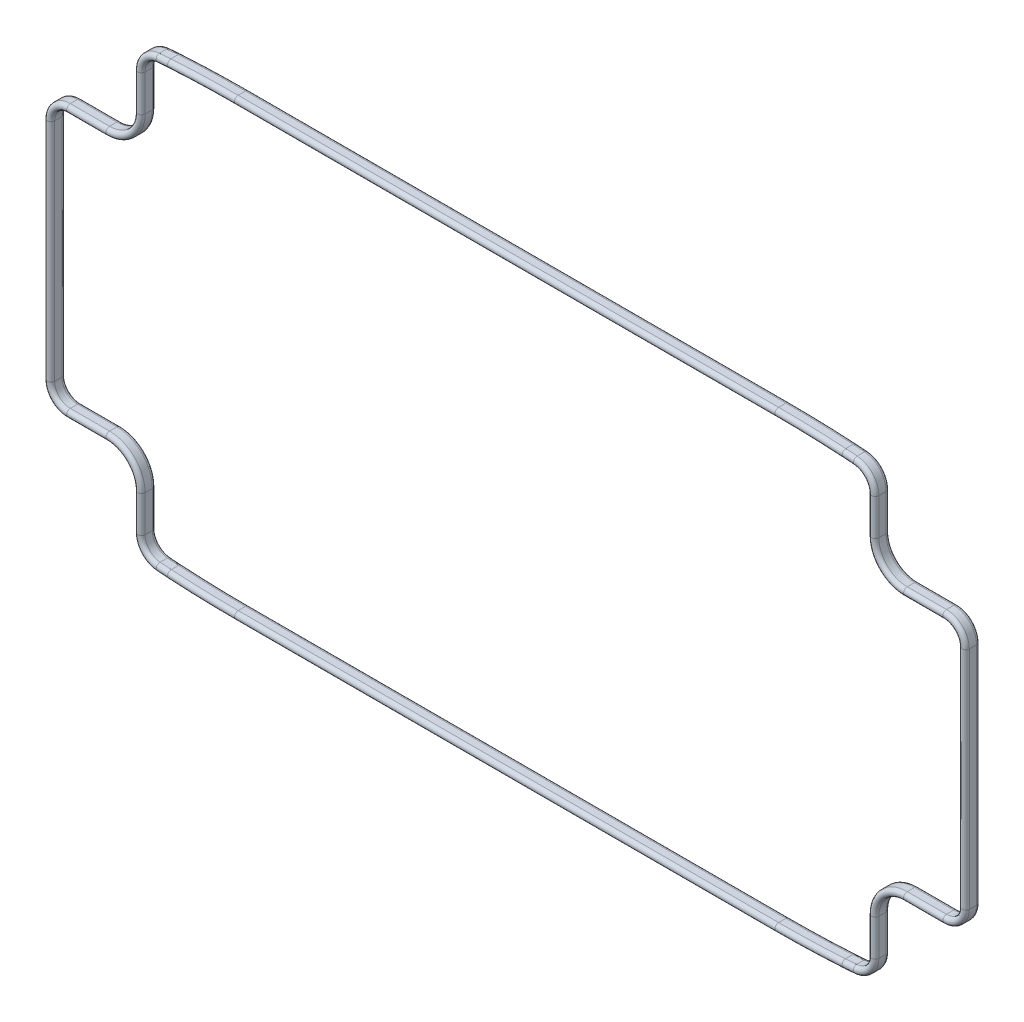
ISO-10303-21;
HEADER;
FILE_DESCRIPTION(('STEP AP214'),'2;1');
FILE_NAME('part.step','',(''),(''),'','','');
FILE_SCHEMA(('AUTOMOTIVE_DESIGN { 1 0 10303 214 1 1 1 1 }'));
ENDSEC;
DATA;
#1=APPLICATION_CONTEXT('core data for automotive mechanical design processes');
#2=APPLICATION_PROTOCOL_DEFINITION('international standard','automotive_design',2000,#1);
#3=PRODUCT_CONTEXT('',#1,'mechanical');
#4=PRODUCT('Part','Part','',(#3));
#5=PRODUCT_RELATED_PRODUCT_CATEGORY('part','',(#4));
#6=PRODUCT_DEFINITION_FORMATION('','',#4);
#7=PRODUCT_DEFINITION_CONTEXT('part definition',#1,'design');
#8=PRODUCT_DEFINITION('design','',#6,#7);
#9=PRODUCT_DEFINITION_SHAPE('','',#8);
#10=(LENGTH_UNIT() NAMED_UNIT(*) SI_UNIT(.MILLI.,.METRE.));
#11=(NAMED_UNIT(*) PLANE_ANGLE_UNIT() SI_UNIT($,.RADIAN.));
#12=(NAMED_UNIT(*) SI_UNIT($,.STERADIAN.) SOLID_ANGLE_UNIT());
#13=UNCERTAINTY_MEASURE_WITH_UNIT(LENGTH_MEASURE(1.E-05),#10,'distance_accuracy_value','');
#14=(GEOMETRIC_REPRESENTATION_CONTEXT(3) GLOBAL_UNCERTAINTY_ASSIGNED_CONTEXT((#13)) GLOBAL_UNIT_ASSIGNED_CONTEXT((#10,
#11,#12)) REPRESENTATION_CONTEXT('',''));
#15=CARTESIAN_POINT('',(0.,0.,0.));
#16=DIRECTION('',(0.,0.,1.));
#17=DIRECTION('',(1.,0.,0.));
#18=AXIS2_PLACEMENT_3D('',#15,#16,#17);
#19=CARTESIAN_POINT('',(59.4821478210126,-39.5965521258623,-1.905));
#20=CARTESIAN_POINT('',(59.857155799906,-39.573416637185,-1.905));
#21=CARTESIAN_POINT('',(60.5263781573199,-39.5287196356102,-1.905));
#22=CARTESIAN_POINT('',(61.1959903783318,-39.4770292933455,-1.905));
#23=CARTESIAN_POINT('',(61.4904212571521,-39.4528195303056,-1.905));
#24=CARTESIAN_POINT('',(59.4821478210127,-39.5965521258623,-3.175));
#25=CARTESIAN_POINT('',(59.8560072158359,-39.573487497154,-3.175));
#26=CARTESIAN_POINT('',(60.526188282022,-39.5287445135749,-3.175));
#27=CARTESIAN_POINT('',(61.1969979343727,-39.4769464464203,-3.175));
#28=CARTESIAN_POINT('',(61.4904212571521,-39.4528195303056,-3.175));
#29=CARTESIAN_POINT('',(59.4039459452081,-38.3289621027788,-3.17499999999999));
#30=CARTESIAN_POINT('',(59.7755081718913,-38.3060391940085,-3.17499999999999));
#31=CARTESIAN_POINT('',(60.436111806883,-38.2618971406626,-3.175));
#32=CARTESIAN_POINT('',(61.0949377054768,-38.2110523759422,-3.175));
#33=CARTESIAN_POINT('',(61.3863459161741,-38.1870911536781,-3.17499999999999));
#34=CARTESIAN_POINT('',(59.4039459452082,-38.3289621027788,-1.905));
#35=CARTESIAN_POINT('',(59.7743595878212,-38.3061100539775,-1.905));
#36=CARTESIAN_POINT('',(60.4359219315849,-38.2619220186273,-1.905));
#37=CARTESIAN_POINT('',(61.0959452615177,-38.210969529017,-1.905));
#38=CARTESIAN_POINT('',(61.386345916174,-38.187091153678,-1.905));
#39=(BOUNDED_SURFACE() B_SPLINE_SURFACE(3,3,((#19,#20,#21,#22,#23),(#24,#25,#26,#27,#28),(#29,
#30,#31,#32,#33),(#34,#35,#36,#37,#38)),.UNSPECIFIED.,.F.,.F.,
.F.) B_SPLINE_SURFACE_WITH_KNOTS((4,4),(4,1,4),(0.,0.25),(0.,0.559984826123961,1.),
.UNSPECIFIED.) GEOMETRIC_REPRESENTATION_ITEM() RATIONAL_B_SPLINE_SURFACE(((1.,1.,1.,1.,1.),
(0.333333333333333,0.333333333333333,0.333333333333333,0.333333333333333,0.333333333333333),
(0.333333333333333,0.333333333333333,0.333333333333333,0.333333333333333,0.333333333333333),(1.,
1.,1.,1.,1.))) REPRESENTATION_ITEM('') SURFACE());
#40=CARTESIAN_POINT('',(59.4430468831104,-38.9627571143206,-1.905));
#41=DIRECTION('',(0.998102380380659,0.0615762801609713,0.));
#42=DIRECTION('',(0.,0.,-1.));
#43=AXIS2_PLACEMENT_3D('',#40,#41,#42);
#44=CIRCLE('',#43,0.635);
#45=CARTESIAN_POINT('',(59.4821478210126,-39.5965521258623,-1.905));
#46=VERTEX_POINT('',#45);
#47=CARTESIAN_POINT('',(59.4039459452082,-38.3289621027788,-1.905));
#48=VERTEX_POINT('',#47);
#49=EDGE_CURVE('E875',#46,#48,#44,.T.);
#50=CARTESIAN_POINT('',(59.4039459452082,-38.3289621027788,-1.905));
#51=CARTESIAN_POINT('',(59.7743595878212,-38.3061100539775,-1.905));
#52=CARTESIAN_POINT('',(60.4359219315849,-38.2619220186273,-1.905));
#53=CARTESIAN_POINT('',(61.0959452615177,-38.210969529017,-1.905));
#54=CARTESIAN_POINT('',(61.386345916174,-38.187091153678,-1.905));
#55=(BOUNDED_CURVE() B_SPLINE_CURVE(3,(#50,#51,#52,#53,#54),.UNSPECIFIED.,.F.,
.F.) B_SPLINE_CURVE_WITH_KNOTS((4,1,4),(0.,0.559984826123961,1.),
.UNSPECIFIED.) CURVE() GEOMETRIC_REPRESENTATION_ITEM() RATIONAL_B_SPLINE_CURVE((1.,1.,1.,1.,1.)) REPRESENTATION_ITEM(''));
#56=CARTESIAN_POINT('',(61.386345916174,-38.187091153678,-1.905));
#57=VERTEX_POINT('',#56);
#58=EDGE_CURVE('E11',#48,#57,#55,.T.);
#59=CARTESIAN_POINT('',(61.4383835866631,-38.8199553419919,-1.905));
#60=DIRECTION('',(0.996636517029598,0.0819490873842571,0.));
#61=DIRECTION('',(0.,0.,-1.));
#62=AXIS2_PLACEMENT_3D('',#59,#60,#61);
#63=CIRCLE('',#62,0.635);
#64=CARTESIAN_POINT('',(61.490421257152,-39.4528195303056,-1.905));
#65=VERTEX_POINT('',#64);
#66=EDGE_CURVE('E1119',#65,#57,#63,.T.);
#67=CARTESIAN_POINT('',(59.4821478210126,-39.5965521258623,-1.905));
#68=CARTESIAN_POINT('',(59.857155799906,-39.573416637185,-1.905));
#69=CARTESIAN_POINT('',(60.5263781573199,-39.5287196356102,-1.905));
#70=CARTESIAN_POINT('',(61.1959903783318,-39.4770292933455,-1.905));
#71=CARTESIAN_POINT('',(61.490421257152,-39.4528195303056,-1.905));
#72=(BOUNDED_CURVE() B_SPLINE_CURVE(3,(#67,#68,#69,#70,#71),.UNSPECIFIED.,.F.,
.F.) B_SPLINE_CURVE_WITH_KNOTS((4,1,4),(0.,0.559984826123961,1.),
.UNSPECIFIED.) CURVE() GEOMETRIC_REPRESENTATION_ITEM() RATIONAL_B_SPLINE_CURVE((1.,1.,1.,1.,1.)) REPRESENTATION_ITEM(''));
#73=EDGE_CURVE('E753',#46,#65,#72,.T.);
#74=ORIENTED_EDGE('',*,*,#49,.T.);
#75=ORIENTED_EDGE('',*,*,#58,.T.);
#76=ORIENTED_EDGE('',*,*,#66,.F.);
#77=ORIENTED_EDGE('',*,*,#73,.F.);
#78=EDGE_LOOP('',(#74,#75,#76,#77));
#79=FACE_BOUND('',#78,.T.);
#80=ADVANCED_FACE('F17',(#79),#39,.T.);
#81=CARTESIAN_POINT('',(59.4039459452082,-38.3289621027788,-1.905));
#82=CARTESIAN_POINT('',(59.7743595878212,-38.3061100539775,-1.905));
#83=CARTESIAN_POINT('',(60.4359219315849,-38.2619220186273,-1.905));
#84=CARTESIAN_POINT('',(61.0959452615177,-38.210969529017,-1.905));
#85=CARTESIAN_POINT('',(61.386345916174,-38.187091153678,-1.905));
#86=CARTESIAN_POINT('',(59.4039459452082,-38.3289621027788,-1.48166666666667));
#87=CARTESIAN_POINT('',(59.7732110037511,-38.3061809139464,-1.48166666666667));
#88=CARTESIAN_POINT('',(60.4357320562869,-38.2619468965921,-1.48166666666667));
#89=CARTESIAN_POINT('',(61.0969528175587,-38.2108866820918,-1.48166666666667));
#90=CARTESIAN_POINT('',(61.386345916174,-38.187091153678,-1.48166666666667));
#91=CARTESIAN_POINT('',(59.4039459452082,-38.3289621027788,-1.05833333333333));
#92=CARTESIAN_POINT('',(59.7732110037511,-38.3061809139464,-1.05833333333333));
#93=CARTESIAN_POINT('',(60.4357320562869,-38.2619468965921,-1.05833333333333));
#94=CARTESIAN_POINT('',(61.0969528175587,-38.2108866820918,-1.05833333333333));
#95=CARTESIAN_POINT('',(61.386345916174,-38.187091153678,-1.05833333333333));
#96=CARTESIAN_POINT('',(59.4039459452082,-38.3289621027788,-0.635));
#97=CARTESIAN_POINT('',(59.7743595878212,-38.3061100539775,-0.635));
#98=CARTESIAN_POINT('',(60.4359219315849,-38.2619220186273,-0.635));
#99=CARTESIAN_POINT('',(61.0959452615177,-38.210969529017,-0.635));
#100=CARTESIAN_POINT('',(61.3863459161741,-38.187091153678,-0.635));
#101=(BOUNDED_SURFACE() B_SPLINE_SURFACE(3,3,((#81,#82,#83,#84,#85),(#86,#87,#88,#89,#90),(#91,
#92,#93,#94,#95),(#96,#97,#98,#99,#100)),.UNSPECIFIED.,.F.,.F.,
.F.) B_SPLINE_SURFACE_WITH_KNOTS((4,4),(4,1,4),(0.25,0.5),(0.,0.559984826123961,1.),
.UNSPECIFIED.) GEOMETRIC_REPRESENTATION_ITEM() RATIONAL_B_SPLINE_SURFACE(((1.,1.,1.,1.,1.),(1.,
1.,1.,1.,1.),(1.,1.,1.,1.,1.),(1.,1.,1.,1.,1.))) REPRESENTATION_ITEM('') SURFACE());
#102=DIRECTION('',(0.,0.,1.));
#103=VECTOR('',#102,1.);
#104=CARTESIAN_POINT('',(59.4039459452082,-38.3289621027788,-1.905));
#105=LINE('',#104,#103);
#106=CARTESIAN_POINT('',(59.4039459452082,-38.3289621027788,-0.635));
#107=VERTEX_POINT('',#106);
#108=EDGE_CURVE('E794',#48,#107,#105,.T.);
#109=CARTESIAN_POINT('',(59.4039459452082,-38.3289621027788,-0.635));
#110=CARTESIAN_POINT('',(59.7743595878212,-38.3061100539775,-0.635));
#111=CARTESIAN_POINT('',(60.4359219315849,-38.2619220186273,-0.635));
#112=CARTESIAN_POINT('',(61.0959452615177,-38.210969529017,-0.635));
#113=CARTESIAN_POINT('',(61.3863459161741,-38.187091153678,-0.635));
#114=(BOUNDED_CURVE() B_SPLINE_CURVE(3,(#109,#110,#111,#112,#113),.UNSPECIFIED.,.F.,
.F.) B_SPLINE_CURVE_WITH_KNOTS((4,1,4),(0.,0.559984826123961,1.),
.UNSPECIFIED.) CURVE() GEOMETRIC_REPRESENTATION_ITEM() RATIONAL_B_SPLINE_CURVE((1.,1.,1.,1.,1.)) REPRESENTATION_ITEM(''));
#115=CARTESIAN_POINT('',(61.3863459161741,-38.187091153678,-0.635));
#116=VERTEX_POINT('',#115);
#117=EDGE_CURVE('E30',#107,#116,#114,.T.);
#118=DIRECTION('',(0.,0.,1.));
#119=VECTOR('',#118,1.);
#120=CARTESIAN_POINT('',(61.386345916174,-38.187091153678,-1.905));
#121=LINE('',#120,#119);
#122=EDGE_CURVE('E1082',#57,#116,#121,.T.);
#123=ORIENTED_EDGE('',*,*,#108,.T.);
#124=ORIENTED_EDGE('',*,*,#117,.T.);
#125=ORIENTED_EDGE('',*,*,#122,.F.);
#126=ORIENTED_EDGE('',*,*,#58,.F.);
#127=EDGE_LOOP('',(#123,#124,#125,#126));
#128=FACE_BOUND('',#127,.T.);
#129=ADVANCED_FACE('F19',(#128),#101,.T.);
#130=CARTESIAN_POINT('',(59.4039459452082,-38.3289621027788,-0.635));
#131=CARTESIAN_POINT('',(59.7743595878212,-38.3061100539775,-0.635));
#132=CARTESIAN_POINT('',(60.4359219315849,-38.2619220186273,-0.635));
#133=CARTESIAN_POINT('',(61.0959452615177,-38.210969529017,-0.635));
#134=CARTESIAN_POINT('',(61.3863459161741,-38.187091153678,-0.635));
#135=CARTESIAN_POINT('',(59.4039459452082,-38.3289621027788,0.634999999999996));
#136=CARTESIAN_POINT('',(59.7755081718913,-38.3060391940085,0.634999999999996));
#137=CARTESIAN_POINT('',(60.4361118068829,-38.2618971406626,0.634999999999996));
#138=CARTESIAN_POINT('',(61.0949377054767,-38.2110523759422,0.634999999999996));
#139=CARTESIAN_POINT('',(61.386345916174,-38.1870911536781,0.634999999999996));
#140=CARTESIAN_POINT('',(59.4821478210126,-39.5965521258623,0.634999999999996));
#141=CARTESIAN_POINT('',(59.8560072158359,-39.573487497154,0.634999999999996));
#142=CARTESIAN_POINT('',(60.5261882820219,-39.5287445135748,0.634999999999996));
#143=CARTESIAN_POINT('',(61.1969979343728,-39.4769464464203,0.634999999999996));
#144=CARTESIAN_POINT('',(61.490421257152,-39.4528195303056,0.634999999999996));
#145=CARTESIAN_POINT('',(59.4821478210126,-39.5965521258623,-0.635));
#146=CARTESIAN_POINT('',(59.8571557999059,-39.573416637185,-0.635));
#147=CARTESIAN_POINT('',(60.5263781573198,-39.5287196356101,-0.635));
#148=CARTESIAN_POINT('',(61.1959903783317,-39.4770292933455,-0.635));
#149=CARTESIAN_POINT('',(61.490421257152,-39.4528195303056,-0.635));
#150=(BOUNDED_SURFACE() B_SPLINE_SURFACE(3,3,((#130,#131,#132,#133,#134),(#135,#136,#137,#138,
#139),(#140,#141,#142,#143,#144),(#145,#146,#147,#148,#149)),.UNSPECIFIED.,.F.,.F.,
.F.) B_SPLINE_SURFACE_WITH_KNOTS((4,4),(4,1,4),(0.5,0.75),(0.,0.559984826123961,1.),
.UNSPECIFIED.) GEOMETRIC_REPRESENTATION_ITEM() RATIONAL_B_SPLINE_SURFACE(((1.,1.,1.,1.,1.),
(0.333333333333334,0.333333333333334,0.333333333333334,0.333333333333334,0.333333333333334),
(0.333333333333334,0.333333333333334,0.333333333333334,0.333333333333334,0.333333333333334),(1.,
1.,1.,1.,1.))) REPRESENTATION_ITEM('') SURFACE());
#151=CARTESIAN_POINT('',(59.4430468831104,-38.9627571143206,-0.635));
#152=DIRECTION('',(0.998102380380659,0.0615762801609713,0.));
#153=DIRECTION('',(0.,0.,1.));
#154=AXIS2_PLACEMENT_3D('',#151,#152,#153);
#155=CIRCLE('',#154,0.635);
#156=CARTESIAN_POINT('',(59.4821478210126,-39.5965521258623,-0.635));
#157=VERTEX_POINT('',#156);
#158=EDGE_CURVE('E833',#107,#157,#155,.T.);
#159=CARTESIAN_POINT('',(59.4821478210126,-39.5965521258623,-0.635));
#160=CARTESIAN_POINT('',(59.8571557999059,-39.573416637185,-0.635));
#161=CARTESIAN_POINT('',(60.5263781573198,-39.5287196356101,-0.635));
#162=CARTESIAN_POINT('',(61.1959903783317,-39.4770292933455,-0.635));
#163=CARTESIAN_POINT('',(61.490421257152,-39.4528195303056,-0.635));
#164=(BOUNDED_CURVE() B_SPLINE_CURVE(3,(#159,#160,#161,#162,#163),.UNSPECIFIED.,.F.,
.F.) B_SPLINE_CURVE_WITH_KNOTS((4,1,4),(0.,0.559984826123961,1.),
.UNSPECIFIED.) CURVE() GEOMETRIC_REPRESENTATION_ITEM() RATIONAL_B_SPLINE_CURVE((1.,1.,1.,1.,1.)) REPRESENTATION_ITEM(''));
#165=CARTESIAN_POINT('',(61.490421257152,-39.4528195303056,-0.635));
#166=VERTEX_POINT('',#165);
#167=EDGE_CURVE('E754',#157,#166,#164,.T.);
#168=CARTESIAN_POINT('',(61.4383835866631,-38.8199553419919,-0.635));
#169=DIRECTION('',(0.996636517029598,0.0819490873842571,0.));
#170=DIRECTION('',(0.,0.,1.));
#171=AXIS2_PLACEMENT_3D('',#168,#169,#170);
#172=CIRCLE('',#171,0.635);
#173=EDGE_CURVE('E1098',#116,#166,#172,.T.);
#174=ORIENTED_EDGE('',*,*,#158,.T.);
#175=ORIENTED_EDGE('',*,*,#167,.T.);
#176=ORIENTED_EDGE('',*,*,#173,.F.);
#177=ORIENTED_EDGE('',*,*,#117,.F.);
#178=EDGE_LOOP('',(#174,#175,#176,#177));
#179=FACE_BOUND('',#178,.T.);
#180=ADVANCED_FACE('F3429',(#179),#150,.T.);
#181=CARTESIAN_POINT('',(59.4821478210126,-39.5965521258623,-0.635));
#182=CARTESIAN_POINT('',(59.8571557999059,-39.573416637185,-0.635));
#183=CARTESIAN_POINT('',(60.5263781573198,-39.5287196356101,-0.635));
#184=CARTESIAN_POINT('',(61.1959903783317,-39.4770292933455,-0.635));
#185=CARTESIAN_POINT('',(61.490421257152,-39.4528195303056,-0.635));
#186=CARTESIAN_POINT('',(59.4821478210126,-39.5965521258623,-1.05833333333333));
#187=CARTESIAN_POINT('',(59.858304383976,-39.573345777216,-1.05833333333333));
#188=CARTESIAN_POINT('',(60.5265680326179,-39.5286947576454,-1.05833333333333));
#189=CARTESIAN_POINT('',(61.1949828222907,-39.4771121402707,-1.05833333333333));
#190=CARTESIAN_POINT('',(61.490421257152,-39.4528195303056,-1.05833333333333));
#191=CARTESIAN_POINT('',(59.4821478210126,-39.5965521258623,-1.48166666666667));
#192=CARTESIAN_POINT('',(59.858304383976,-39.573345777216,-1.48166666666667));
#193=CARTESIAN_POINT('',(60.5265680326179,-39.5286947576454,-1.48166666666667));
#194=CARTESIAN_POINT('',(61.1949828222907,-39.4771121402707,-1.48166666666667));
#195=CARTESIAN_POINT('',(61.490421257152,-39.4528195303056,-1.48166666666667));
#196=CARTESIAN_POINT('',(59.4821478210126,-39.5965521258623,-1.905));
#197=CARTESIAN_POINT('',(59.8571557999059,-39.573416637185,-1.905));
#198=CARTESIAN_POINT('',(60.5263781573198,-39.5287196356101,-1.905));
#199=CARTESIAN_POINT('',(61.1959903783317,-39.4770292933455,-1.905));
#200=CARTESIAN_POINT('',(61.490421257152,-39.4528195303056,-1.905));
#201=(BOUNDED_SURFACE() B_SPLINE_SURFACE(3,3,((#181,#182,#183,#184,#185),(#186,#187,#188,#189,
#190),(#191,#192,#193,#194,#195),(#196,#197,#198,#199,#200)),.UNSPECIFIED.,.F.,.F.,
.F.) B_SPLINE_SURFACE_WITH_KNOTS((4,4),(4,1,4),(0.75,1.),(0.,0.559984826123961,1.),
.UNSPECIFIED.) GEOMETRIC_REPRESENTATION_ITEM() RATIONAL_B_SPLINE_SURFACE(((1.,1.,1.,1.,1.),(1.,
1.,1.,1.,1.),(1.,1.,1.,1.,1.),(1.,1.,1.,1.,1.))) REPRESENTATION_ITEM('') SURFACE());
#202=DIRECTION('',(0.,0.,-1.));
#203=VECTOR('',#202,1.);
#204=CARTESIAN_POINT('',(59.4821478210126,-39.5965521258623,-1.905));
#205=LINE('',#204,#203);
#206=EDGE_CURVE('E859',#157,#46,#205,.T.);
#207=DIRECTION('',(0.,0.,-1.));
#208=VECTOR('',#207,1.);
#209=CARTESIAN_POINT('',(61.490421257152,-39.4528195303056,-1.905));
#210=LINE('',#209,#208);
#211=EDGE_CURVE('E1106',#166,#65,#210,.T.);
#212=ORIENTED_EDGE('',*,*,#206,.T.);
#213=ORIENTED_EDGE('',*,*,#73,.T.);
#214=ORIENTED_EDGE('',*,*,#211,.F.);
#215=ORIENTED_EDGE('',*,*,#167,.F.);
#216=EDGE_LOOP('',(#212,#213,#214,#215));
#217=FACE_BOUND('',#216,.T.);
#218=ADVANCED_FACE('F3425',(#217),#201,.T.);
#219=CARTESIAN_POINT('',(-61.4904212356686,-39.4528195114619,-1.905));
#220=CARTESIAN_POINT('',(-61.1157261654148,-39.4836290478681,-1.905));
#221=CARTESIAN_POINT('',(-60.4460355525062,-39.5344073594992,-1.905));
#222=CARTESIAN_POINT('',(-59.7767733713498,-39.5783756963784,-1.905));
#223=CARTESIAN_POINT('',(-59.4821477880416,-39.5965521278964,-1.905));
#224=CARTESIAN_POINT('',(-61.4904212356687,-39.4528195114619,-3.175));
#225=CARTESIAN_POINT('',(-61.1169922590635,-39.4835249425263,-3.175));
#226=CARTESIAN_POINT('',(-60.4461043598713,-39.534413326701,-3.175));
#227=CARTESIAN_POINT('',(-59.7758837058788,-39.5784305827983,-3.175));
#228=CARTESIAN_POINT('',(-59.4821477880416,-39.5965521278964,-3.175));
#229=CARTESIAN_POINT('',(-61.3863459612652,-38.1870911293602,-3.17499999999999));
#230=CARTESIAN_POINT('',(-61.0154491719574,-38.217588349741,-3.17499999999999));
#231=CARTESIAN_POINT('',(-60.356546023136,-38.2675316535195,-3.17499999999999));
#232=CARTESIAN_POINT('',(-59.6959025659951,-38.3109503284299,-3.175));
#233=CARTESIAN_POINT('',(-59.4039459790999,-38.3289621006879,-3.175));
#234=CARTESIAN_POINT('',(-61.3863459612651,-38.1870911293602,-1.905));
#235=CARTESIAN_POINT('',(-61.016715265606,-38.2174842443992,-1.905));
#236=CARTESIAN_POINT('',(-60.356614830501,-38.2675376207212,-1.905));
#237=CARTESIAN_POINT('',(-59.695012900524,-38.3110052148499,-1.905));
#238=CARTESIAN_POINT('',(-59.4039459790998,-38.328962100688,-1.905));
#239=(BOUNDED_SURFACE() B_SPLINE_SURFACE(3,3,((#219,#220,#221,#222,#223),(#224,#225,#226,#227,
#228),(#229,#230,#231,#232,#233),(#234,#235,#236,#237,#238)),.UNSPECIFIED.,.F.,.F.,
.F.) B_SPLINE_SURFACE_WITH_KNOTS((4,4),(4,1,4),(0.,0.25),(0.,0.560011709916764,1.),
.UNSPECIFIED.) GEOMETRIC_REPRESENTATION_ITEM() RATIONAL_B_SPLINE_SURFACE(((1.,1.,1.,1.,1.),
(0.333333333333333,0.333333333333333,0.333333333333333,0.333333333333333,0.333333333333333),
(0.333333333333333,0.333333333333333,0.333333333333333,0.333333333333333,0.333333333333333),(1.,
1.,1.,1.,1.))) REPRESENTATION_ITEM('') SURFACE());
#240=CARTESIAN_POINT('',(-61.4383835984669,-38.819955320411,-1.905));
#241=DIRECTION('',(0.996636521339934,-0.0819490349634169,0.));
#242=DIRECTION('',(0.,0.,-1.));
#243=AXIS2_PLACEMENT_3D('',#240,#241,#242);
#244=CIRCLE('',#243,0.635);
#245=CARTESIAN_POINT('',(-61.4904212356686,-39.4528195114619,-1.905));
#246=VERTEX_POINT('',#245);
#247=CARTESIAN_POINT('',(-61.3863459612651,-38.1870911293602,-1.905));
#248=VERTEX_POINT('',#247);
#249=EDGE_CURVE('E950',#246,#248,#244,.T.);
#250=CARTESIAN_POINT('',(-61.3863459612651,-38.1870911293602,-1.905));
#251=CARTESIAN_POINT('',(-61.016715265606,-38.2174842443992,-1.905));
#252=CARTESIAN_POINT('',(-60.356614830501,-38.2675376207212,-1.905));
#253=CARTESIAN_POINT('',(-59.695012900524,-38.3110052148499,-1.905));
#254=CARTESIAN_POINT('',(-59.4039459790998,-38.328962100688,-1.905));
#255=(BOUNDED_CURVE() B_SPLINE_CURVE(3,(#250,#251,#252,#253,#254),.UNSPECIFIED.,.F.,
.F.) B_SPLINE_CURVE_WITH_KNOTS((4,1,4),(0.,0.560011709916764,1.),
.UNSPECIFIED.) CURVE() GEOMETRIC_REPRESENTATION_ITEM() RATIONAL_B_SPLINE_CURVE((1.,1.,1.,1.,1.)) REPRESENTATION_ITEM(''));
#256=CARTESIAN_POINT('',(-59.4039459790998,-38.328962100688,-1.905));
#257=VERTEX_POINT('',#256);
#258=EDGE_CURVE('E745',#248,#257,#255,.T.);
#259=CARTESIAN_POINT('',(-59.4430468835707,-38.9627571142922,-1.905));
#260=DIRECTION('',(0.998102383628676,-0.0615762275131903,0.));
#261=DIRECTION('',(0.,0.,-1.));
#262=AXIS2_PLACEMENT_3D('',#259,#260,#261);
#263=CIRCLE('',#262,0.635);
#264=CARTESIAN_POINT('',(-59.4821477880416,-39.5965521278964,-1.905));
#265=VERTEX_POINT('',#264);
#266=EDGE_CURVE('E915',#265,#257,#263,.T.);
#267=CARTESIAN_POINT('',(-61.4904212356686,-39.4528195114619,-1.905));
#268=CARTESIAN_POINT('',(-61.1157261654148,-39.4836290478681,-1.905));
#269=CARTESIAN_POINT('',(-60.4460355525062,-39.5344073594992,-1.905));
#270=CARTESIAN_POINT('',(-59.7767733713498,-39.5783756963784,-1.905));
#271=CARTESIAN_POINT('',(-59.4821477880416,-39.5965521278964,-1.905));
#272=(BOUNDED_CURVE() B_SPLINE_CURVE(3,(#267,#268,#269,#270,#271),.UNSPECIFIED.,.F.,
.F.) B_SPLINE_CURVE_WITH_KNOTS((4,1,4),(0.,0.560011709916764,1.),
.UNSPECIFIED.) CURVE() GEOMETRIC_REPRESENTATION_ITEM() RATIONAL_B_SPLINE_CURVE((1.,1.,1.,1.,1.)) REPRESENTATION_ITEM(''));
#273=EDGE_CURVE('E718',#246,#265,#272,.T.);
#274=ORIENTED_EDGE('',*,*,#249,.T.);
#275=ORIENTED_EDGE('',*,*,#258,.T.);
#276=ORIENTED_EDGE('',*,*,#266,.F.);
#277=ORIENTED_EDGE('',*,*,#273,.F.);
#278=EDGE_LOOP('',(#274,#275,#276,#277));
#279=FACE_BOUND('',#278,.T.);
#280=ADVANCED_FACE('F3226',(#279),#239,.T.);
#281=CARTESIAN_POINT('',(-61.3863459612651,-38.1870911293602,-1.905));
#282=CARTESIAN_POINT('',(-61.016715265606,-38.2174842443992,-1.905));
#283=CARTESIAN_POINT('',(-60.356614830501,-38.2675376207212,-1.905));
#284=CARTESIAN_POINT('',(-59.695012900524,-38.3110052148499,-1.905));
#285=CARTESIAN_POINT('',(-59.4039459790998,-38.328962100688,-1.905));
#286=CARTESIAN_POINT('',(-61.3863459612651,-38.1870911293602,-1.48166666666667));
#287=CARTESIAN_POINT('',(-61.0179813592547,-38.2173801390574,-1.48166666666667));
#288=CARTESIAN_POINT('',(-60.356683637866,-38.267543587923,-1.48166666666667));
#289=CARTESIAN_POINT('',(-59.694123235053,-38.31106010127,-1.48166666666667));
#290=CARTESIAN_POINT('',(-59.4039459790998,-38.328962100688,-1.48166666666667));
#291=CARTESIAN_POINT('',(-61.3863459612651,-38.1870911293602,-1.05833333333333));
#292=CARTESIAN_POINT('',(-61.0179813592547,-38.2173801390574,-1.05833333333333));
#293=CARTESIAN_POINT('',(-60.356683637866,-38.267543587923,-1.05833333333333));
#294=CARTESIAN_POINT('',(-59.694123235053,-38.31106010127,-1.05833333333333));
#295=CARTESIAN_POINT('',(-59.4039459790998,-38.328962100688,-1.05833333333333));
#296=CARTESIAN_POINT('',(-61.3863459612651,-38.1870911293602,-0.635));
#297=CARTESIAN_POINT('',(-61.016715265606,-38.2174842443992,-0.635));
#298=CARTESIAN_POINT('',(-60.3566148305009,-38.2675376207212,-0.635));
#299=CARTESIAN_POINT('',(-59.695012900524,-38.3110052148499,-0.635));
#300=CARTESIAN_POINT('',(-59.4039459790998,-38.328962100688,-0.635));
#301=(BOUNDED_SURFACE() B_SPLINE_SURFACE(3,3,((#281,#282,#283,#284,#285),(#286,#287,#288,#289,
#290),(#291,#292,#293,#294,#295),(#296,#297,#298,#299,#300)),.UNSPECIFIED.,.F.,.F.,
.F.) B_SPLINE_SURFACE_WITH_KNOTS((4,4),(4,1,4),(0.25,0.5),(0.,0.560011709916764,1.),
.UNSPECIFIED.) GEOMETRIC_REPRESENTATION_ITEM() RATIONAL_B_SPLINE_SURFACE(((1.,1.,1.,1.,1.),(1.,
1.,1.,1.,1.),(1.,1.,1.,1.,1.),(1.,1.,1.,1.,1.))) REPRESENTATION_ITEM('') SURFACE());
#302=DIRECTION('',(0.,0.,1.));
#303=VECTOR('',#302,1.);
#304=CARTESIAN_POINT('',(-61.3863459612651,-38.1870911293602,-1.905));
#305=LINE('',#304,#303);
#306=CARTESIAN_POINT('',(-61.3863459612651,-38.1870911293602,-0.635));
#307=VERTEX_POINT('',#306);
#308=EDGE_CURVE('E936',#248,#307,#305,.T.);
#309=CARTESIAN_POINT('',(-61.3863459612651,-38.1870911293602,-0.635));
#310=CARTESIAN_POINT('',(-61.016715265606,-38.2174842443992,-0.635));
#311=CARTESIAN_POINT('',(-60.3566148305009,-38.2675376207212,-0.635));
#312=CARTESIAN_POINT('',(-59.695012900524,-38.3110052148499,-0.635));
#313=CARTESIAN_POINT('',(-59.4039459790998,-38.328962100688,-0.635));
#314=(BOUNDED_CURVE() B_SPLINE_CURVE(3,(#309,#310,#311,#312,#313),.UNSPECIFIED.,.F.,
.F.) B_SPLINE_CURVE_WITH_KNOTS((4,1,4),(0.,0.560011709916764,1.),
.UNSPECIFIED.) CURVE() GEOMETRIC_REPRESENTATION_ITEM() RATIONAL_B_SPLINE_CURVE((1.,1.,1.,1.,1.)) REPRESENTATION_ITEM(''));
#315=CARTESIAN_POINT('',(-59.4039459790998,-38.328962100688,-0.635));
#316=VERTEX_POINT('',#315);
#317=EDGE_CURVE('E736',#307,#316,#314,.T.);
#318=DIRECTION('',(0.,0.,1.));
#319=VECTOR('',#318,1.);
#320=CARTESIAN_POINT('',(-59.4039459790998,-38.328962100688,-1.905));
#321=LINE('',#320,#319);
#322=EDGE_CURVE('E902',#257,#316,#321,.T.);
#323=ORIENTED_EDGE('',*,*,#308,.T.);
#324=ORIENTED_EDGE('',*,*,#317,.T.);
#325=ORIENTED_EDGE('',*,*,#322,.F.);
#326=ORIENTED_EDGE('',*,*,#258,.F.);
#327=EDGE_LOOP('',(#323,#324,#325,#326));
#328=FACE_BOUND('',#327,.T.);
#329=ADVANCED_FACE('F3222',(#328),#301,.T.);
#330=CARTESIAN_POINT('',(-61.3863459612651,-38.1870911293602,-0.635));
#331=CARTESIAN_POINT('',(-61.016715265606,-38.2174842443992,-0.635));
#332=CARTESIAN_POINT('',(-60.3566148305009,-38.2675376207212,-0.635));
#333=CARTESIAN_POINT('',(-59.695012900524,-38.3110052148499,-0.635));
#334=CARTESIAN_POINT('',(-59.4039459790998,-38.328962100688,-0.635));
#335=CARTESIAN_POINT('',(-61.3863459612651,-38.1870911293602,0.634999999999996));
#336=CARTESIAN_POINT('',(-61.0154491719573,-38.2175883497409,0.634999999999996));
#337=CARTESIAN_POINT('',(-60.3565460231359,-38.2675316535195,0.634999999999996));
#338=CARTESIAN_POINT('',(-59.695902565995,-38.3109503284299,0.634999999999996));
#339=CARTESIAN_POINT('',(-59.4039459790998,-38.3289621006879,0.634999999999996));
#340=CARTESIAN_POINT('',(-61.4904212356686,-39.4528195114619,0.634999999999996));
#341=CARTESIAN_POINT('',(-61.1169922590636,-39.4835249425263,0.634999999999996));
#342=CARTESIAN_POINT('',(-60.4461043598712,-39.534413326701,0.634999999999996));
#343=CARTESIAN_POINT('',(-59.7758837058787,-39.5784305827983,0.634999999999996));
#344=CARTESIAN_POINT('',(-59.4821477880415,-39.5965521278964,0.634999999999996));
#345=CARTESIAN_POINT('',(-61.4904212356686,-39.4528195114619,-0.635));
#346=CARTESIAN_POINT('',(-61.1157261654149,-39.4836290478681,-0.635));
#347=CARTESIAN_POINT('',(-60.4460355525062,-39.5344073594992,-0.635));
#348=CARTESIAN_POINT('',(-59.7767733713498,-39.5783756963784,-0.635));
#349=CARTESIAN_POINT('',(-59.4821477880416,-39.5965521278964,-0.635));
#350=(BOUNDED_SURFACE() B_SPLINE_SURFACE(3,3,((#330,#331,#332,#333,#334),(#335,#336,#337,#338,
#339),(#340,#341,#342,#343,#344),(#345,#346,#347,#348,#349)),.UNSPECIFIED.,.F.,.F.,
.F.) B_SPLINE_SURFACE_WITH_KNOTS((4,4),(4,1,4),(0.5,0.75),(0.,0.560011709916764,1.),
.UNSPECIFIED.) GEOMETRIC_REPRESENTATION_ITEM() RATIONAL_B_SPLINE_SURFACE(((1.,1.,1.,1.,1.),
(0.333333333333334,0.333333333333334,0.333333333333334,0.333333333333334,0.333333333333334),
(0.333333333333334,0.333333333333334,0.333333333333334,0.333333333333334,0.333333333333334),(1.,
1.,1.,1.,1.))) REPRESENTATION_ITEM('') SURFACE());
#351=CARTESIAN_POINT('',(-61.4383835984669,-38.819955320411,-0.635));
#352=DIRECTION('',(0.996636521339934,-0.0819490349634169,0.));
#353=DIRECTION('',(0.,0.,1.));
#354=AXIS2_PLACEMENT_3D('',#351,#352,#353);
#355=CIRCLE('',#354,0.635);
#356=CARTESIAN_POINT('',(-61.4904212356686,-39.4528195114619,-0.635));
#357=VERTEX_POINT('',#356);
#358=EDGE_CURVE('E810',#307,#357,#355,.T.);
#359=CARTESIAN_POINT('',(-61.4904212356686,-39.4528195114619,-0.635));
#360=CARTESIAN_POINT('',(-61.1157261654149,-39.4836290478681,-0.635));
#361=CARTESIAN_POINT('',(-60.4460355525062,-39.5344073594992,-0.635));
#362=CARTESIAN_POINT('',(-59.7767733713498,-39.5783756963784,-0.635));
#363=CARTESIAN_POINT('',(-59.4821477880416,-39.5965521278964,-0.635));
#364=(BOUNDED_CURVE() B_SPLINE_CURVE(3,(#359,#360,#361,#362,#363),.UNSPECIFIED.,.F.,
.F.) B_SPLINE_CURVE_WITH_KNOTS((4,1,4),(0.,0.560011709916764,1.),
.UNSPECIFIED.) CURVE() GEOMETRIC_REPRESENTATION_ITEM() RATIONAL_B_SPLINE_CURVE((1.,1.,1.,1.,1.)) REPRESENTATION_ITEM(''));
#365=CARTESIAN_POINT('',(-59.4821477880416,-39.5965521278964,-0.635));
#366=VERTEX_POINT('',#365);
#367=EDGE_CURVE('E727',#357,#366,#364,.T.);
#368=CARTESIAN_POINT('',(-59.4430468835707,-38.9627571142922,-0.635));
#369=DIRECTION('',(0.998102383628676,-0.0615762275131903,0.));
#370=DIRECTION('',(0.,0.,1.));
#371=AXIS2_PLACEMENT_3D('',#368,#369,#370);
#372=CIRCLE('',#371,0.635);
#373=EDGE_CURVE('E834',#316,#366,#372,.T.);
#374=ORIENTED_EDGE('',*,*,#358,.T.);
#375=ORIENTED_EDGE('',*,*,#367,.T.);
#376=ORIENTED_EDGE('',*,*,#373,.F.);
#377=ORIENTED_EDGE('',*,*,#317,.F.);
#378=EDGE_LOOP('',(#374,#375,#376,#377));
#379=FACE_BOUND('',#378,.T.);
#380=ADVANCED_FACE('F2755',(#379),#350,.T.);
#381=CARTESIAN_POINT('',(-61.4904212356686,-39.4528195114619,-0.635));
#382=CARTESIAN_POINT('',(-61.1157261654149,-39.4836290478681,-0.635));
#383=CARTESIAN_POINT('',(-60.4460355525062,-39.5344073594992,-0.635));
#384=CARTESIAN_POINT('',(-59.7767733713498,-39.5783756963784,-0.635));
#385=CARTESIAN_POINT('',(-59.4821477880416,-39.5965521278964,-0.635));
#386=CARTESIAN_POINT('',(-61.4904212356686,-39.4528195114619,-1.05833333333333));
#387=CARTESIAN_POINT('',(-61.1144600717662,-39.48373315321,-1.05833333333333));
#388=CARTESIAN_POINT('',(-60.4459667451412,-39.5344013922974,-1.05833333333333));
#389=CARTESIAN_POINT('',(-59.7776630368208,-39.5783208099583,-1.05833333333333));
#390=CARTESIAN_POINT('',(-59.4821477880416,-39.5965521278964,-1.05833333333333));
#391=CARTESIAN_POINT('',(-61.4904212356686,-39.4528195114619,-1.48166666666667));
#392=CARTESIAN_POINT('',(-61.1144600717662,-39.48373315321,-1.48166666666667));
#393=CARTESIAN_POINT('',(-60.4459667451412,-39.5344013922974,-1.48166666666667));
#394=CARTESIAN_POINT('',(-59.7776630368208,-39.5783208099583,-1.48166666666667));
#395=CARTESIAN_POINT('',(-59.4821477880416,-39.5965521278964,-1.48166666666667));
#396=CARTESIAN_POINT('',(-61.4904212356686,-39.4528195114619,-1.905));
#397=CARTESIAN_POINT('',(-61.1157261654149,-39.4836290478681,-1.905));
#398=CARTESIAN_POINT('',(-60.4460355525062,-39.5344073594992,-1.905));
#399=CARTESIAN_POINT('',(-59.7767733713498,-39.5783756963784,-1.905));
#400=CARTESIAN_POINT('',(-59.4821477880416,-39.5965521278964,-1.905));
#401=(BOUNDED_SURFACE() B_SPLINE_SURFACE(3,3,((#381,#382,#383,#384,#385),(#386,#387,#388,#389,
#390),(#391,#392,#393,#394,#395),(#396,#397,#398,#399,#400)),.UNSPECIFIED.,.F.,.F.,
.F.) B_SPLINE_SURFACE_WITH_KNOTS((4,4),(4,1,4),(0.75,1.),(0.,0.560011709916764,1.),
.UNSPECIFIED.) GEOMETRIC_REPRESENTATION_ITEM() RATIONAL_B_SPLINE_SURFACE(((1.,1.,1.,1.,1.),(1.,
1.,1.,1.,1.),(1.,1.,1.,1.,1.),(1.,1.,1.,1.,1.))) REPRESENTATION_ITEM('') SURFACE());
#402=DIRECTION('',(0.,0.,-1.));
#403=VECTOR('',#402,1.);
#404=CARTESIAN_POINT('',(-61.4904212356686,-39.4528195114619,-1.905));
#405=LINE('',#404,#403);
#406=EDGE_CURVE('E941',#357,#246,#405,.T.);
#407=DIRECTION('',(0.,0.,-1.));
#408=VECTOR('',#407,1.);
#409=CARTESIAN_POINT('',(-59.4821477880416,-39.5965521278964,-1.905));
#410=LINE('',#409,#408);
#411=EDGE_CURVE('E906',#366,#265,#410,.T.);
#412=ORIENTED_EDGE('',*,*,#406,.T.);
#413=ORIENTED_EDGE('',*,*,#273,.T.);
#414=ORIENTED_EDGE('',*,*,#411,.F.);
#415=ORIENTED_EDGE('',*,*,#367,.F.);
#416=EDGE_LOOP('',(#412,#413,#414,#415));
#417=FACE_BOUND('',#416,.T.);
#418=ADVANCED_FACE('F2750',(#417),#401,.T.);
#419=CARTESIAN_POINT('',(-59.4821478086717,39.5965521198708,-1.905));
#420=CARTESIAN_POINT('',(-59.8571557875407,39.5734166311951,-1.905));
#421=CARTESIAN_POINT('',(-60.5263781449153,39.5287196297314,-1.905));
#422=CARTESIAN_POINT('',(-61.1959903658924,39.4770292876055,-1.905));
#423=CARTESIAN_POINT('',(-61.4904212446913,39.4528195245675,-1.905));
#424=CARTESIAN_POINT('',(-59.4821478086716,39.5965521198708,-3.17499999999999));
#425=CARTESIAN_POINT('',(-59.8560072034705,39.5734874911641,-3.17499999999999));
#426=CARTESIAN_POINT('',(-60.5261882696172,39.5287445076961,-3.17499999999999));
#427=CARTESIAN_POINT('',(-61.1969979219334,39.4769464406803,-3.17499999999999));
#428=CARTESIAN_POINT('',(-61.4904212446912,39.4528195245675,-3.17499999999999));
#429=CARTESIAN_POINT('',(-59.403945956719,38.3289620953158,-3.17499999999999));
#430=CARTESIAN_POINT('',(-59.7755081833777,38.306039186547,-3.17499999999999));
#431=CARTESIAN_POINT('',(-60.4361118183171,38.261897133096,-3.17499999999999));
#432=CARTESIAN_POINT('',(-61.0949377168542,38.2110523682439,-3.17499999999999));
#433=CARTESIAN_POINT('',(-61.3863459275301,38.1870911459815,-3.17499999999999));
#434=CARTESIAN_POINT('',(-59.403945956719,38.3289620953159,-1.905));
#435=CARTESIAN_POINT('',(-59.7743595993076,38.306110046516,-1.905));
#436=CARTESIAN_POINT('',(-60.435921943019,38.2619220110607,-1.905));
#437=CARTESIAN_POINT('',(-61.0959452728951,38.2109695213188,-1.905));
#438=CARTESIAN_POINT('',(-61.3863459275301,38.1870911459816,-1.905));
#439=(BOUNDED_SURFACE() B_SPLINE_SURFACE(3,3,((#419,#420,#421,#422,#423),(#424,#425,#426,#427,
#428),(#429,#430,#431,#432,#433),(#434,#435,#436,#437,#438)),.UNSPECIFIED.,.F.,.F.,
.F.) B_SPLINE_SURFACE_WITH_KNOTS((4,4),(4,1,4),(0.,0.25),(0.,0.55998482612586,1.),
.UNSPECIFIED.) GEOMETRIC_REPRESENTATION_ITEM() RATIONAL_B_SPLINE_SURFACE(((1.,1.,1.,1.,1.),
(0.333333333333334,0.333333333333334,0.333333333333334,0.333333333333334,0.333333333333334),
(0.333333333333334,0.333333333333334,0.333333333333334,0.333333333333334,0.333333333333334),(1.,
1.,1.,1.,1.))) REPRESENTATION_ITEM('') SURFACE());
#440=CARTESIAN_POINT('',(-59.4430468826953,38.9627571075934,-1.905));
#441=DIRECTION('',(-0.998102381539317,-0.0615762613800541,0.));
#442=DIRECTION('',(0.,0.,-1.));
#443=AXIS2_PLACEMENT_3D('',#440,#441,#442);
#444=CIRCLE('',#443,0.635);
#445=CARTESIAN_POINT('',(-59.4821478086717,39.5965521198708,-1.905));
#446=VERTEX_POINT('',#445);
#447=CARTESIAN_POINT('',(-59.403945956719,38.3289620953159,-1.905));
#448=VERTEX_POINT('',#447);
#449=EDGE_CURVE('E462',#446,#448,#444,.T.);
#450=CARTESIAN_POINT('',(-59.403945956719,38.3289620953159,-1.905));
#451=CARTESIAN_POINT('',(-59.7743595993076,38.306110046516,-1.905));
#452=CARTESIAN_POINT('',(-60.4359219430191,38.2619220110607,-1.905));
#453=CARTESIAN_POINT('',(-61.0959452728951,38.2109695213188,-1.905));
#454=CARTESIAN_POINT('',(-61.3863459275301,38.1870911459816,-1.905));
#455=(BOUNDED_CURVE() B_SPLINE_CURVE(3,(#450,#451,#452,#453,#454),.UNSPECIFIED.,.F.,
.F.) B_SPLINE_CURVE_WITH_KNOTS((4,1,4),(0.,0.55998482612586,1.),
.UNSPECIFIED.) CURVE() GEOMETRIC_REPRESENTATION_ITEM() RATIONAL_B_SPLINE_CURVE((1.,1.,1.,1.,1.)) REPRESENTATION_ITEM(''));
#456=CARTESIAN_POINT('',(-61.3863459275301,38.1870911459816,-1.905));
#457=VERTEX_POINT('',#456);
#458=EDGE_CURVE('E717',#448,#457,#455,.T.);
#459=CARTESIAN_POINT('',(-61.4383835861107,38.8199553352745,-1.905));
#460=DIRECTION('',(-0.996636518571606,-0.0819490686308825,0.));
#461=DIRECTION('',(0.,0.,-1.));
#462=AXIS2_PLACEMENT_3D('',#459,#460,#461);
#463=CIRCLE('',#462,0.635);
#464=CARTESIAN_POINT('',(-61.4904212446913,39.4528195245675,-1.905));
#465=VERTEX_POINT('',#464);
#466=EDGE_CURVE('E418',#465,#457,#463,.T.);
#467=CARTESIAN_POINT('',(-59.4821478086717,39.5965521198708,-1.905));
#468=CARTESIAN_POINT('',(-59.8571557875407,39.5734166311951,-1.905));
#469=CARTESIAN_POINT('',(-60.5263781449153,39.5287196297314,-1.905));
#470=CARTESIAN_POINT('',(-61.1959903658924,39.4770292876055,-1.905));
#471=CARTESIAN_POINT('',(-61.4904212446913,39.4528195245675,-1.905));
#472=(BOUNDED_CURVE() B_SPLINE_CURVE(3,(#467,#468,#469,#470,#471),.UNSPECIFIED.,.F.,
.F.) B_SPLINE_CURVE_WITH_KNOTS((4,1,4),(0.,0.55998482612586,1.),
.UNSPECIFIED.) CURVE() GEOMETRIC_REPRESENTATION_ITEM() RATIONAL_B_SPLINE_CURVE((1.,1.,1.,1.,1.)) REPRESENTATION_ITEM(''));
#473=EDGE_CURVE('E590',#446,#465,#472,.T.);
#474=ORIENTED_EDGE('',*,*,#449,.T.);
#475=ORIENTED_EDGE('',*,*,#458,.T.);
#476=ORIENTED_EDGE('',*,*,#466,.F.);
#477=ORIENTED_EDGE('',*,*,#473,.F.);
#478=EDGE_LOOP('',(#474,#475,#476,#477));
#479=FACE_BOUND('',#478,.T.);
#480=ADVANCED_FACE('F2754',(#479),#439,.T.);
#481=CARTESIAN_POINT('',(-59.403945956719,38.3289620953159,-1.905));
#482=CARTESIAN_POINT('',(-59.7743595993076,38.306110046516,-1.905));
#483=CARTESIAN_POINT('',(-60.4359219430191,38.2619220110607,-1.905));
#484=CARTESIAN_POINT('',(-61.0959452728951,38.2109695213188,-1.905));
#485=CARTESIAN_POINT('',(-61.3863459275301,38.1870911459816,-1.905));
#486=CARTESIAN_POINT('',(-59.403945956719,38.3289620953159,-1.48166666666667));
#487=CARTESIAN_POINT('',(-59.7732110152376,38.306180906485,-1.48166666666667));
#488=CARTESIAN_POINT('',(-60.4357320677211,38.2619468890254,-1.48166666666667));
#489=CARTESIAN_POINT('',(-61.0969528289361,38.2108866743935,-1.48166666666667));
#490=CARTESIAN_POINT('',(-61.3863459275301,38.1870911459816,-1.48166666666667));
#491=CARTESIAN_POINT('',(-59.403945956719,38.3289620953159,-1.05833333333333));
#492=CARTESIAN_POINT('',(-59.7732110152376,38.306180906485,-1.05833333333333));
#493=CARTESIAN_POINT('',(-60.4357320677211,38.2619468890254,-1.05833333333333));
#494=CARTESIAN_POINT('',(-61.0969528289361,38.2108866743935,-1.05833333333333));
#495=CARTESIAN_POINT('',(-61.3863459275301,38.1870911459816,-1.05833333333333));
#496=CARTESIAN_POINT('',(-59.403945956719,38.3289620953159,-0.635));
#497=CARTESIAN_POINT('',(-59.7743595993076,38.306110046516,-0.635));
#498=CARTESIAN_POINT('',(-60.4359219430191,38.2619220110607,-0.635));
#499=CARTESIAN_POINT('',(-61.0959452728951,38.2109695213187,-0.635));
#500=CARTESIAN_POINT('',(-61.3863459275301,38.1870911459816,-0.635));
#501=(BOUNDED_SURFACE() B_SPLINE_SURFACE(3,3,((#481,#482,#483,#484,#485),(#486,#487,#488,#489,
#490),(#491,#492,#493,#494,#495),(#496,#497,#498,#499,#500)),.UNSPECIFIED.,.F.,.F.,
.F.) B_SPLINE_SURFACE_WITH_KNOTS((4,4),(4,1,4),(0.25,0.5),(0.,0.55998482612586,1.),
.UNSPECIFIED.) GEOMETRIC_REPRESENTATION_ITEM() RATIONAL_B_SPLINE_SURFACE(((1.,1.,1.,1.,1.),(1.,
1.,1.,1.,1.),(1.,1.,1.,1.,1.),(1.,1.,1.,1.,1.))) REPRESENTATION_ITEM('') SURFACE());
#502=DIRECTION('',(0.,0.,1.));
#503=VECTOR('',#502,1.);
#504=CARTESIAN_POINT('',(-59.403945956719,38.3289620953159,-1.905));
#505=LINE('',#504,#503);
#506=CARTESIAN_POINT('',(-59.403945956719,38.3289620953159,-0.635));
#507=VERTEX_POINT('',#506);
#508=EDGE_CURVE('E424',#448,#507,#505,.T.);
#509=CARTESIAN_POINT('',(-59.403945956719,38.3289620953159,-0.635));
#510=CARTESIAN_POINT('',(-59.7743595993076,38.306110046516,-0.635));
#511=CARTESIAN_POINT('',(-60.4359219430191,38.2619220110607,-0.635));
#512=CARTESIAN_POINT('',(-61.0959452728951,38.2109695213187,-0.635));
#513=CARTESIAN_POINT('',(-61.3863459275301,38.1870911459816,-0.635));
#514=(BOUNDED_CURVE() B_SPLINE_CURVE(3,(#509,#510,#511,#512,#513),.UNSPECIFIED.,.F.,
.F.) B_SPLINE_CURVE_WITH_KNOTS((4,1,4),(0.,0.55998482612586,1.),
.UNSPECIFIED.) CURVE() GEOMETRIC_REPRESENTATION_ITEM() RATIONAL_B_SPLINE_CURVE((1.,1.,1.,1.,1.)) REPRESENTATION_ITEM(''));
#515=CARTESIAN_POINT('',(-61.3863459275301,38.1870911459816,-0.635));
#516=VERTEX_POINT('',#515);
#517=EDGE_CURVE('E709',#507,#516,#514,.T.);
#518=DIRECTION('',(0.,0.,1.));
#519=VECTOR('',#518,1.);
#520=CARTESIAN_POINT('',(-61.3863459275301,38.1870911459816,-1.905));
#521=LINE('',#520,#519);
#522=EDGE_CURVE('E396',#457,#516,#521,.T.);
#523=ORIENTED_EDGE('',*,*,#508,.T.);
#524=ORIENTED_EDGE('',*,*,#517,.T.);
#525=ORIENTED_EDGE('',*,*,#522,.F.);
#526=ORIENTED_EDGE('',*,*,#458,.F.);
#527=EDGE_LOOP('',(#523,#524,#525,#526));
#528=FACE_BOUND('',#527,.T.);
#529=ADVANCED_FACE('F3746',(#528),#501,.T.);
#530=CARTESIAN_POINT('',(-59.403945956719,38.3289620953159,-0.635));
#531=CARTESIAN_POINT('',(-59.7743595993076,38.306110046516,-0.635));
#532=CARTESIAN_POINT('',(-60.4359219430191,38.2619220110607,-0.635));
#533=CARTESIAN_POINT('',(-61.0959452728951,38.2109695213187,-0.635));
#534=CARTESIAN_POINT('',(-61.3863459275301,38.1870911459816,-0.635));
#535=CARTESIAN_POINT('',(-59.403945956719,38.3289620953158,0.634999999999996));
#536=CARTESIAN_POINT('',(-59.7755081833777,38.306039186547,0.634999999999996));
#537=CARTESIAN_POINT('',(-60.4361118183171,38.261897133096,0.634999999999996));
#538=CARTESIAN_POINT('',(-61.0949377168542,38.2110523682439,0.634999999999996));
#539=CARTESIAN_POINT('',(-61.3863459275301,38.1870911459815,0.634999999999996));
#540=CARTESIAN_POINT('',(-59.4821478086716,39.5965521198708,0.634999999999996));
#541=CARTESIAN_POINT('',(-59.8560072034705,39.5734874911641,0.634999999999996));
#542=CARTESIAN_POINT('',(-60.5261882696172,39.5287445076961,0.634999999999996));
#543=CARTESIAN_POINT('',(-61.1969979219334,39.4769464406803,0.634999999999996));
#544=CARTESIAN_POINT('',(-61.4904212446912,39.4528195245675,0.634999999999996));
#545=CARTESIAN_POINT('',(-59.4821478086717,39.5965521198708,-0.635));
#546=CARTESIAN_POINT('',(-59.8571557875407,39.5734166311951,-0.635));
#547=CARTESIAN_POINT('',(-60.5263781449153,39.5287196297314,-0.635));
#548=CARTESIAN_POINT('',(-61.1959903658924,39.4770292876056,-0.635));
#549=CARTESIAN_POINT('',(-61.4904212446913,39.4528195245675,-0.635));
#550=(BOUNDED_SURFACE() B_SPLINE_SURFACE(3,3,((#530,#531,#532,#533,#534),(#535,#536,#537,#538,
#539),(#540,#541,#542,#543,#544),(#545,#546,#547,#548,#549)),.UNSPECIFIED.,.F.,.F.,
.F.) B_SPLINE_SURFACE_WITH_KNOTS((4,4),(4,1,4),(0.5,0.75),(0.,0.55998482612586,1.),
.UNSPECIFIED.) GEOMETRIC_REPRESENTATION_ITEM() RATIONAL_B_SPLINE_SURFACE(((1.,1.,1.,1.,1.),
(0.333333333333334,0.333333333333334,0.333333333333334,0.333333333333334,0.333333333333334),
(0.333333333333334,0.333333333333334,0.333333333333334,0.333333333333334,0.333333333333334),(1.,
1.,1.,1.,1.))) REPRESENTATION_ITEM('') SURFACE());
#551=CARTESIAN_POINT('',(-59.4430468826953,38.9627571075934,-0.635));
#552=DIRECTION('',(-0.998102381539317,-0.0615762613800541,0.));
#553=DIRECTION('',(0.,0.,1.));
#554=AXIS2_PLACEMENT_3D('',#551,#552,#553);
#555=CIRCLE('',#554,0.635);
#556=CARTESIAN_POINT('',(-59.4821478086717,39.5965521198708,-0.635));
#557=VERTEX_POINT('',#556);
#558=EDGE_CURVE('E437',#507,#557,#555,.T.);
#559=CARTESIAN_POINT('',(-59.4821478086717,39.5965521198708,-0.635));
#560=CARTESIAN_POINT('',(-59.8571557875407,39.5734166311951,-0.635));
#561=CARTESIAN_POINT('',(-60.5263781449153,39.5287196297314,-0.635));
#562=CARTESIAN_POINT('',(-61.1959903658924,39.4770292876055,-0.635));
#563=CARTESIAN_POINT('',(-61.4904212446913,39.4528195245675,-0.635));
#564=(BOUNDED_CURVE() B_SPLINE_CURVE(3,(#559,#560,#561,#562,#563),.UNSPECIFIED.,.F.,
.F.) B_SPLINE_CURVE_WITH_KNOTS((4,1,4),(0.,0.55998482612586,1.),
.UNSPECIFIED.) CURVE() GEOMETRIC_REPRESENTATION_ITEM() RATIONAL_B_SPLINE_CURVE((1.,1.,1.,1.,1.)) REPRESENTATION_ITEM(''));
#565=CARTESIAN_POINT('',(-61.4904212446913,39.4528195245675,-0.635));
#566=VERTEX_POINT('',#565);
#567=EDGE_CURVE('E700',#557,#566,#564,.T.);
#568=CARTESIAN_POINT('',(-61.4383835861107,38.8199553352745,-0.635));
#569=DIRECTION('',(-0.996636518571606,-0.0819490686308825,0.));
#570=DIRECTION('',(0.,0.,1.));
#571=AXIS2_PLACEMENT_3D('',#568,#569,#570);
#572=CIRCLE('',#571,0.635);
#573=EDGE_CURVE('E406',#516,#566,#572,.T.);
#574=ORIENTED_EDGE('',*,*,#558,.T.);
#575=ORIENTED_EDGE('',*,*,#567,.T.);
#576=ORIENTED_EDGE('',*,*,#573,.F.);
#577=ORIENTED_EDGE('',*,*,#517,.F.);
#578=EDGE_LOOP('',(#574,#575,#576,#577));
#579=FACE_BOUND('',#578,.T.);
#580=ADVANCED_FACE('F3381',(#579),#550,.T.);
#581=CARTESIAN_POINT('',(-59.4821478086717,39.5965521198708,-0.635));
#582=CARTESIAN_POINT('',(-59.8571557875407,39.5734166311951,-0.635));
#583=CARTESIAN_POINT('',(-60.5263781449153,39.5287196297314,-0.635));
#584=CARTESIAN_POINT('',(-61.1959903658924,39.4770292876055,-0.635));
#585=CARTESIAN_POINT('',(-61.4904212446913,39.4528195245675,-0.635));
#586=CARTESIAN_POINT('',(-59.4821478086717,39.5965521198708,-1.05833333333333));
#587=CARTESIAN_POINT('',(-59.8583043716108,39.5733457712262,-1.05833333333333));
#588=CARTESIAN_POINT('',(-60.5265680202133,39.5286947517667,-1.05833333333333));
#589=CARTESIAN_POINT('',(-61.1949828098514,39.4771121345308,-1.05833333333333));
#590=CARTESIAN_POINT('',(-61.4904212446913,39.4528195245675,-1.05833333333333));
#591=CARTESIAN_POINT('',(-59.4821478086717,39.5965521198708,-1.48166666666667));
#592=CARTESIAN_POINT('',(-59.8583043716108,39.5733457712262,-1.48166666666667));
#593=CARTESIAN_POINT('',(-60.5265680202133,39.5286947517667,-1.48166666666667));
#594=CARTESIAN_POINT('',(-61.1949828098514,39.4771121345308,-1.48166666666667));
#595=CARTESIAN_POINT('',(-61.4904212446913,39.4528195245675,-1.48166666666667));
#596=CARTESIAN_POINT('',(-59.4821478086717,39.5965521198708,-1.905));
#597=CARTESIAN_POINT('',(-59.8571557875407,39.5734166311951,-1.905));
#598=CARTESIAN_POINT('',(-60.5263781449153,39.5287196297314,-1.905));
#599=CARTESIAN_POINT('',(-61.1959903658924,39.4770292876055,-1.905));
#600=CARTESIAN_POINT('',(-61.4904212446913,39.4528195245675,-1.905));
#601=(BOUNDED_SURFACE() B_SPLINE_SURFACE(3,3,((#581,#582,#583,#584,#585),(#586,#587,#588,#589,
#590),(#591,#592,#593,#594,#595),(#596,#597,#598,#599,#600)),.UNSPECIFIED.,.F.,.F.,
.F.) B_SPLINE_SURFACE_WITH_KNOTS((4,4),(4,1,4),(0.75,1.),(0.,0.55998482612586,1.),
.UNSPECIFIED.) GEOMETRIC_REPRESENTATION_ITEM() RATIONAL_B_SPLINE_SURFACE(((1.,1.,1.,1.,1.),(1.,
1.,1.,1.,1.),(1.,1.,1.,1.,1.),(1.,1.,1.,1.,1.))) REPRESENTATION_ITEM('') SURFACE());
#602=DIRECTION('',(0.,0.,-1.));
#603=VECTOR('',#602,1.);
#604=CARTESIAN_POINT('',(-59.4821478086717,39.5965521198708,-1.905));
#605=LINE('',#604,#603);
#606=EDGE_CURVE('E449',#557,#446,#605,.T.);
#607=DIRECTION('',(0.,0.,-1.));
#608=VECTOR('',#607,1.);
#609=CARTESIAN_POINT('',(-61.4904212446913,39.4528195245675,-1.905));
#610=LINE('',#609,#608);
#611=EDGE_CURVE('E410',#566,#465,#610,.T.);
#612=ORIENTED_EDGE('',*,*,#606,.T.);
#613=ORIENTED_EDGE('',*,*,#473,.T.);
#614=ORIENTED_EDGE('',*,*,#611,.F.);
#615=ORIENTED_EDGE('',*,*,#567,.F.);
#616=EDGE_LOOP('',(#612,#613,#614,#615));
#617=FACE_BOUND('',#616,.T.);
#618=ADVANCED_FACE('F2981',(#617),#601,.T.);
#619=CARTESIAN_POINT('',(61.4904212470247,39.4528195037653,-1.905));
#620=CARTESIAN_POINT('',(61.1157261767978,39.4836290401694,-1.905));
#621=CARTESIAN_POINT('',(60.4460355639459,39.5344073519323,-1.905));
#622=CARTESIAN_POINT('',(59.7767733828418,39.5783756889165,-1.905));
#623=CARTESIAN_POINT('',(59.4821477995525,39.5965521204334,-1.905));
#624=CARTESIAN_POINT('',(61.4904212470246,39.4528195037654,-3.17499999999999));
#625=CARTESIAN_POINT('',(61.1169922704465,39.4835249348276,-3.17499999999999));
#626=CARTESIAN_POINT('',(60.4461043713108,39.534413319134,-3.17499999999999));
#627=CARTESIAN_POINT('',(59.7758837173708,39.5784305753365,-3.17499999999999));
#628=CARTESIAN_POINT('',(59.4821477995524,39.5965521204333,-3.17499999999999));
#629=CARTESIAN_POINT('',(61.3863459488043,38.187091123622,-3.17499999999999));
#630=CARTESIAN_POINT('',(61.0154491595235,38.2175883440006,-3.17499999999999));
#631=CARTESIAN_POINT('',(60.3565460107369,38.2675316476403,-3.17499999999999));
#632=CARTESIAN_POINT('',(59.6959025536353,38.3109503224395,-3.17499999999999));
#633=CARTESIAN_POINT('',(59.403945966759,38.3289620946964,-3.17499999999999));
#634=CARTESIAN_POINT('',(61.3863459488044,38.187091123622,-1.905));
#635=CARTESIAN_POINT('',(61.0167152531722,38.2174842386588,-1.905));
#636=CARTESIAN_POINT('',(60.3566148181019,38.2675376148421,-1.905));
#637=CARTESIAN_POINT('',(59.6950128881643,38.3110052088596,-1.905));
#638=CARTESIAN_POINT('',(59.403945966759,38.3289620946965,-1.905));
#639=(BOUNDED_SURFACE() B_SPLINE_SURFACE(3,3,((#619,#620,#621,#622,#623),(#624,#625,#626,#627,
#628),(#629,#630,#631,#632,#633),(#634,#635,#636,#637,#638)),.UNSPECIFIED.,.F.,.F.,
.F.) B_SPLINE_SURFACE_WITH_KNOTS((4,4),(4,1,4),(0.,0.25),(0.,0.560011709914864,1.),
.UNSPECIFIED.) GEOMETRIC_REPRESENTATION_ITEM() RATIONAL_B_SPLINE_SURFACE(((1.,1.,1.,1.,1.),
(0.333333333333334,0.333333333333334,0.333333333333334,0.333333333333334,0.333333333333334),
(0.333333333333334,0.333333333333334,0.333333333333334,0.333333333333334,0.333333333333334),(1.,
1.,1.,1.,1.))) REPRESENTATION_ITEM('') SURFACE());
#640=CARTESIAN_POINT('',(61.4383835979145,38.8199553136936,-1.905));
#641=DIRECTION('',(-0.996636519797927,0.0819490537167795,0.));
#642=DIRECTION('',(0.,0.,-1.));
#643=AXIS2_PLACEMENT_3D('',#640,#641,#642);
#644=CIRCLE('',#643,0.635);
#645=CARTESIAN_POINT('',(61.4904212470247,39.4528195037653,-1.905));
#646=VERTEX_POINT('',#645);
#647=CARTESIAN_POINT('',(61.3863459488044,38.187091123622,-1.905));
#648=VERTEX_POINT('',#647);
#649=EDGE_CURVE('E554',#646,#648,#644,.T.);
#650=CARTESIAN_POINT('',(61.3863459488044,38.187091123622,-1.905));
#651=CARTESIAN_POINT('',(61.0167152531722,38.2174842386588,-1.905));
#652=CARTESIAN_POINT('',(60.3566148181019,38.2675376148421,-1.905));
#653=CARTESIAN_POINT('',(59.6950128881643,38.3110052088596,-1.905));
#654=CARTESIAN_POINT('',(59.403945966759,38.3289620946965,-1.905));
#655=(BOUNDED_CURVE() B_SPLINE_CURVE(3,(#650,#651,#652,#653,#654),.UNSPECIFIED.,.F.,
.F.) B_SPLINE_CURVE_WITH_KNOTS((4,1,4),(0.,0.560011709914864,1.),
.UNSPECIFIED.) CURVE() GEOMETRIC_REPRESENTATION_ITEM() RATIONAL_B_SPLINE_CURVE((1.,1.,1.,1.,1.)) REPRESENTATION_ITEM(''));
#656=CARTESIAN_POINT('',(59.403945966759,38.3289620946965,-1.905));
#657=VERTEX_POINT('',#656);
#658=EDGE_CURVE('E585',#648,#657,#655,.T.);
#659=CARTESIAN_POINT('',(59.4430468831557,38.9627571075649,-1.905));
#660=DIRECTION('',(-0.998102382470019,0.0615762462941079,0.));
#661=DIRECTION('',(0.,0.,-1.));
#662=AXIS2_PLACEMENT_3D('',#659,#660,#661);
#663=CIRCLE('',#662,0.635);
#664=CARTESIAN_POINT('',(59.4821477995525,39.5965521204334,-1.905));
#665=VERTEX_POINT('',#664);
#666=EDGE_CURVE('E518',#665,#657,#663,.T.);
#667=CARTESIAN_POINT('',(61.4904212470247,39.4528195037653,-1.905));
#668=CARTESIAN_POINT('',(61.1157261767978,39.4836290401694,-1.905));
#669=CARTESIAN_POINT('',(60.4460355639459,39.5344073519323,-1.905));
#670=CARTESIAN_POINT('',(59.7767733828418,39.5783756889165,-1.905));
#671=CARTESIAN_POINT('',(59.4821477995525,39.5965521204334,-1.905));
#672=(BOUNDED_CURVE() B_SPLINE_CURVE(3,(#667,#668,#669,#670,#671),.UNSPECIFIED.,.F.,
.F.) B_SPLINE_CURVE_WITH_KNOTS((4,1,4),(0.,0.560011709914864,1.),
.UNSPECIFIED.) CURVE() GEOMETRIC_REPRESENTATION_ITEM() RATIONAL_B_SPLINE_CURVE((1.,1.,1.,1.,1.)) REPRESENTATION_ITEM(''));
#673=EDGE_CURVE('E671',#646,#665,#672,.T.);
#674=ORIENTED_EDGE('',*,*,#649,.T.);
#675=ORIENTED_EDGE('',*,*,#658,.T.);
#676=ORIENTED_EDGE('',*,*,#666,.F.);
#677=ORIENTED_EDGE('',*,*,#673,.F.);
#678=EDGE_LOOP('',(#674,#675,#676,#677));
#679=FACE_BOUND('',#678,.T.);
#680=ADVANCED_FACE('F2808',(#679),#639,.T.);
#681=CARTESIAN_POINT('',(61.3863459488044,38.187091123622,-1.905));
#682=CARTESIAN_POINT('',(61.0167152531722,38.2174842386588,-1.905));
#683=CARTESIAN_POINT('',(60.3566148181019,38.2675376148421,-1.905));
#684=CARTESIAN_POINT('',(59.6950128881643,38.3110052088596,-1.905));
#685=CARTESIAN_POINT('',(59.403945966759,38.3289620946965,-1.905));
#686=CARTESIAN_POINT('',(61.3863459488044,38.187091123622,-1.48166666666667));
#687=CARTESIAN_POINT('',(61.0179813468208,38.217380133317,-1.48166666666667));
#688=CARTESIAN_POINT('',(60.3566836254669,38.2675435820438,-1.48166666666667));
#689=CARTESIAN_POINT('',(59.6941232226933,38.3110600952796,-1.48166666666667));
#690=CARTESIAN_POINT('',(59.403945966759,38.3289620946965,-1.48166666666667));
#691=CARTESIAN_POINT('',(61.3863459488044,38.187091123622,-1.05833333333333));
#692=CARTESIAN_POINT('',(61.0179813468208,38.217380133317,-1.05833333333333));
#693=CARTESIAN_POINT('',(60.3566836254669,38.2675435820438,-1.05833333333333));
#694=CARTESIAN_POINT('',(59.6941232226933,38.3110600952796,-1.05833333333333));
#695=CARTESIAN_POINT('',(59.403945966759,38.3289620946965,-1.05833333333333));
#696=CARTESIAN_POINT('',(61.3863459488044,38.187091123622,-0.635));
#697=CARTESIAN_POINT('',(61.0167152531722,38.2174842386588,-0.635));
#698=CARTESIAN_POINT('',(60.3566148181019,38.2675376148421,-0.635));
#699=CARTESIAN_POINT('',(59.6950128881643,38.3110052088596,-0.635));
#700=CARTESIAN_POINT('',(59.403945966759,38.3289620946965,-0.635));
#701=(BOUNDED_SURFACE() B_SPLINE_SURFACE(3,3,((#681,#682,#683,#684,#685),(#686,#687,#688,#689,
#690),(#691,#692,#693,#694,#695),(#696,#697,#698,#699,#700)),.UNSPECIFIED.,.F.,.F.,
.F.) B_SPLINE_SURFACE_WITH_KNOTS((4,4),(4,1,4),(0.25,0.5),(0.,0.560011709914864,1.),
.UNSPECIFIED.) GEOMETRIC_REPRESENTATION_ITEM() RATIONAL_B_SPLINE_SURFACE(((1.,1.,1.,1.,1.),(1.,
1.,1.,1.,1.),(1.,1.,1.,1.,1.),(1.,1.,1.,1.,1.))) REPRESENTATION_ITEM('') SURFACE());
#702=DIRECTION('',(0.,0.,1.));
#703=VECTOR('',#702,1.);
#704=CARTESIAN_POINT('',(61.3863459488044,38.187091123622,-1.905));
#705=LINE('',#704,#703);
#706=CARTESIAN_POINT('',(61.3863459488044,38.187091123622,-0.635));
#707=VERTEX_POINT('',#706);
#708=EDGE_CURVE('E527',#648,#707,#705,.T.);
#709=CARTESIAN_POINT('',(61.3863459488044,38.187091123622,-0.635));
#710=CARTESIAN_POINT('',(61.0167152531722,38.2174842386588,-0.635));
#711=CARTESIAN_POINT('',(60.3566148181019,38.2675376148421,-0.635));
#712=CARTESIAN_POINT('',(59.6950128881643,38.3110052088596,-0.635));
#713=CARTESIAN_POINT('',(59.403945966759,38.3289620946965,-0.635));
#714=(BOUNDED_CURVE() B_SPLINE_CURVE(3,(#709,#710,#711,#712,#713),.UNSPECIFIED.,.F.,
.F.) B_SPLINE_CURVE_WITH_KNOTS((4,1,4),(0.,0.560011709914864,1.),
.UNSPECIFIED.) CURVE() GEOMETRIC_REPRESENTATION_ITEM() RATIONAL_B_SPLINE_CURVE((1.,1.,1.,1.,1.)) REPRESENTATION_ITEM(''));
#715=CARTESIAN_POINT('',(59.403945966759,38.3289620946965,-0.635));
#716=VERTEX_POINT('',#715);
#717=EDGE_CURVE('E591',#707,#716,#714,.T.);
#718=DIRECTION('',(0.,0.,1.));
#719=VECTOR('',#718,1.);
#720=CARTESIAN_POINT('',(59.403945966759,38.3289620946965,-1.905));
#721=LINE('',#720,#719);
#722=EDGE_CURVE('E494',#657,#716,#721,.T.);
#723=ORIENTED_EDGE('',*,*,#708,.T.);
#724=ORIENTED_EDGE('',*,*,#717,.T.);
#725=ORIENTED_EDGE('',*,*,#722,.F.);
#726=ORIENTED_EDGE('',*,*,#658,.F.);
#727=EDGE_LOOP('',(#723,#724,#725,#726));
#728=FACE_BOUND('',#727,.T.);
#729=ADVANCED_FACE('F2803',(#728),#701,.T.);
#730=CARTESIAN_POINT('',(61.3863459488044,38.187091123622,-0.635));
#731=CARTESIAN_POINT('',(61.0167152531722,38.2174842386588,-0.635));
#732=CARTESIAN_POINT('',(60.3566148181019,38.2675376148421,-0.635));
#733=CARTESIAN_POINT('',(59.6950128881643,38.3110052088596,-0.635));
#734=CARTESIAN_POINT('',(59.403945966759,38.3289620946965,-0.635));
#735=CARTESIAN_POINT('',(61.3863459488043,38.187091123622,0.634999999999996));
#736=CARTESIAN_POINT('',(61.0154491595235,38.2175883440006,0.634999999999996));
#737=CARTESIAN_POINT('',(60.3565460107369,38.2675316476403,0.634999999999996));
#738=CARTESIAN_POINT('',(59.6959025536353,38.3109503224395,0.634999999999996));
#739=CARTESIAN_POINT('',(59.403945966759,38.3289620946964,0.634999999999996));
#740=CARTESIAN_POINT('',(61.4904212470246,39.4528195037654,0.634999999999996));
#741=CARTESIAN_POINT('',(61.1169922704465,39.4835249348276,0.634999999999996));
#742=CARTESIAN_POINT('',(60.4461043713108,39.534413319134,0.634999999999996));
#743=CARTESIAN_POINT('',(59.7758837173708,39.5784305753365,0.634999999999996));
#744=CARTESIAN_POINT('',(59.4821477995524,39.5965521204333,0.634999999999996));
#745=CARTESIAN_POINT('',(61.4904212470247,39.4528195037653,-0.635));
#746=CARTESIAN_POINT('',(61.1157261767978,39.4836290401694,-0.635));
#747=CARTESIAN_POINT('',(60.4460355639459,39.5344073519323,-0.635));
#748=CARTESIAN_POINT('',(59.7767733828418,39.5783756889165,-0.635));
#749=CARTESIAN_POINT('',(59.4821477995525,39.5965521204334,-0.635));
#750=(BOUNDED_SURFACE() B_SPLINE_SURFACE(3,3,((#730,#731,#732,#733,#734),(#735,#736,#737,#738,
#739),(#740,#741,#742,#743,#744),(#745,#746,#747,#748,#749)),.UNSPECIFIED.,.F.,.F.,
.F.) B_SPLINE_SURFACE_WITH_KNOTS((4,4),(4,1,4),(0.5,0.75),(0.,0.560011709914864,1.),
.UNSPECIFIED.) GEOMETRIC_REPRESENTATION_ITEM() RATIONAL_B_SPLINE_SURFACE(((1.,1.,1.,1.,1.),
(0.333333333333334,0.333333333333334,0.333333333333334,0.333333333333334,0.333333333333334),
(0.333333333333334,0.333333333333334,0.333333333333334,0.333333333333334,0.333333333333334),(1.,
1.,1.,1.,1.))) REPRESENTATION_ITEM('') SURFACE());
#751=CARTESIAN_POINT('',(61.4383835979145,38.8199553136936,-0.635));
#752=DIRECTION('',(-0.996636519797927,0.0819490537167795,0.));
#753=DIRECTION('',(0.,0.,1.));
#754=AXIS2_PLACEMENT_3D('',#751,#752,#753);
#755=CIRCLE('',#754,0.635);
#756=CARTESIAN_POINT('',(61.4904212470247,39.4528195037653,-0.635));
#757=VERTEX_POINT('',#756);
#758=EDGE_CURVE('E537',#707,#757,#755,.T.);
#759=CARTESIAN_POINT('',(61.4904212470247,39.4528195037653,-0.635));
#760=CARTESIAN_POINT('',(61.1157261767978,39.4836290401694,-0.635));
#761=CARTESIAN_POINT('',(60.4460355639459,39.5344073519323,-0.635));
#762=CARTESIAN_POINT('',(59.7767733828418,39.5783756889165,-0.635));
#763=CARTESIAN_POINT('',(59.4821477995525,39.5965521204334,-0.635));
#764=(BOUNDED_CURVE() B_SPLINE_CURVE(3,(#759,#760,#761,#762,#763),.UNSPECIFIED.,.F.,
.F.) B_SPLINE_CURVE_WITH_KNOTS((4,1,4),(0.,0.560011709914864,1.),
.UNSPECIFIED.) CURVE() GEOMETRIC_REPRESENTATION_ITEM() RATIONAL_B_SPLINE_CURVE((1.,1.,1.,1.,1.)) REPRESENTATION_ITEM(''));
#765=CARTESIAN_POINT('',(59.4821477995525,39.5965521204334,-0.635));
#766=VERTEX_POINT('',#765);
#767=EDGE_CURVE('E676',#757,#766,#764,.T.);
#768=CARTESIAN_POINT('',(59.4430468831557,38.9627571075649,-0.635));
#769=DIRECTION('',(-0.998102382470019,0.0615762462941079,0.));
#770=DIRECTION('',(0.,0.,1.));
#771=AXIS2_PLACEMENT_3D('',#768,#769,#770);
#772=CIRCLE('',#771,0.635);
#773=EDGE_CURVE('E505',#716,#766,#772,.T.);
#774=ORIENTED_EDGE('',*,*,#758,.T.);
#775=ORIENTED_EDGE('',*,*,#767,.T.);
#776=ORIENTED_EDGE('',*,*,#773,.F.);
#777=ORIENTED_EDGE('',*,*,#717,.F.);
#778=EDGE_LOOP('',(#774,#775,#776,#777));
#779=FACE_BOUND('',#778,.T.);
#780=ADVANCED_FACE('F2807',(#779),#750,.T.);
#781=CARTESIAN_POINT('',(61.4904212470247,39.4528195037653,-0.635));
#782=CARTESIAN_POINT('',(61.1157261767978,39.4836290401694,-0.635));
#783=CARTESIAN_POINT('',(60.4460355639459,39.5344073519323,-0.635));
#784=CARTESIAN_POINT('',(59.7767733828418,39.5783756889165,-0.635));
#785=CARTESIAN_POINT('',(59.4821477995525,39.5965521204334,-0.635));
#786=CARTESIAN_POINT('',(61.4904212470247,39.4528195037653,-1.05833333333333));
#787=CARTESIAN_POINT('',(61.1144600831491,39.4837331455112,-1.05833333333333));
#788=CARTESIAN_POINT('',(60.4459667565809,39.5344013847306,-1.05833333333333));
#789=CARTESIAN_POINT('',(59.7776630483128,39.5783208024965,-1.05833333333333));
#790=CARTESIAN_POINT('',(59.4821477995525,39.5965521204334,-1.05833333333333));
#791=CARTESIAN_POINT('',(61.4904212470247,39.4528195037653,-1.48166666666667));
#792=CARTESIAN_POINT('',(61.1144600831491,39.4837331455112,-1.48166666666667));
#793=CARTESIAN_POINT('',(60.4459667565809,39.5344013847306,-1.48166666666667));
#794=CARTESIAN_POINT('',(59.7776630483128,39.5783208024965,-1.48166666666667));
#795=CARTESIAN_POINT('',(59.4821477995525,39.5965521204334,-1.48166666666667));
#796=CARTESIAN_POINT('',(61.4904212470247,39.4528195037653,-1.905));
#797=CARTESIAN_POINT('',(61.1157261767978,39.4836290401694,-1.905));
#798=CARTESIAN_POINT('',(60.4460355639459,39.5344073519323,-1.905));
#799=CARTESIAN_POINT('',(59.7767733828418,39.5783756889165,-1.905));
#800=CARTESIAN_POINT('',(59.4821477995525,39.5965521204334,-1.905));
#801=(BOUNDED_SURFACE() B_SPLINE_SURFACE(3,3,((#781,#782,#783,#784,#785),(#786,#787,#788,#789,
#790),(#791,#792,#793,#794,#795),(#796,#797,#798,#799,#800)),.UNSPECIFIED.,.F.,.F.,
.F.) B_SPLINE_SURFACE_WITH_KNOTS((4,4),(4,1,4),(0.75,1.),(0.,0.560011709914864,1.),
.UNSPECIFIED.) GEOMETRIC_REPRESENTATION_ITEM() RATIONAL_B_SPLINE_SURFACE(((1.,1.,1.,1.,1.),(1.,
1.,1.,1.,1.),(1.,1.,1.,1.,1.),(1.,1.,1.,1.,1.))) REPRESENTATION_ITEM('') SURFACE());
#802=DIRECTION('',(0.,0.,-1.));
#803=VECTOR('',#802,1.);
#804=CARTESIAN_POINT('',(61.4904212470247,39.4528195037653,-1.905));
#805=LINE('',#804,#803);
#806=EDGE_CURVE('E546',#757,#646,#805,.T.);
#807=DIRECTION('',(0.,0.,-1.));
#808=VECTOR('',#807,1.);
#809=CARTESIAN_POINT('',(59.4821477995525,39.5965521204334,-1.905));
#810=LINE('',#809,#808);
#811=EDGE_CURVE('E513',#766,#665,#810,.T.);
#812=ORIENTED_EDGE('',*,*,#806,.T.);
#813=ORIENTED_EDGE('',*,*,#673,.T.);
#814=ORIENTED_EDGE('',*,*,#811,.F.);
#815=ORIENTED_EDGE('',*,*,#767,.F.);
#816=EDGE_LOOP('',(#812,#813,#814,#815));
#817=FACE_BOUND('',#816,.T.);
#818=ADVANCED_FACE('F3288',(#817),#801,.T.);
#819=CARTESIAN_POINT('',(81.236958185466,19.8755,-1.905));
#820=DIRECTION('',(-1.,0.,0.));
#821=DIRECTION('',(0.,0.,1.));
#822=AXIS2_PLACEMENT_3D('',#819,#820,#821);
#823=PLANE('',#822);
#824=DIRECTION('',(0.,-1.,0.));
#825=VECTOR('',#824,1.);
#826=CARTESIAN_POINT('',(81.236958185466,19.8755,-0.635));
#827=LINE('',#826,#825);
#828=CARTESIAN_POINT('',(81.236958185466,19.8755,-0.635));
#829=VERTEX_POINT('',#828);
#830=CARTESIAN_POINT('',(81.236958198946,-19.8754999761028,-0.635));
#831=VERTEX_POINT('',#830);
#832=EDGE_CURVE('E57',#829,#831,#827,.T.);
#833=ORIENTED_EDGE('',*,*,#832,.T.);
#834=DIRECTION('',(0.,0.,-1.));
#835=VECTOR('',#834,1.);
#836=CARTESIAN_POINT('',(81.236958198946,-19.8754999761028,-1.905));
#837=LINE('',#836,#835);
#838=CARTESIAN_POINT('',(81.236958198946,-19.8754999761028,-1.905));
#839=VERTEX_POINT('',#838);
#840=EDGE_CURVE('E1757',#831,#839,#837,.T.);
#841=ORIENTED_EDGE('',*,*,#840,.T.);
#842=DIRECTION('',(0.,-1.,0.));
#843=VECTOR('',#842,1.);
#844=CARTESIAN_POINT('',(81.236958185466,19.8755,-1.905));
#845=LINE('',#844,#843);
#846=CARTESIAN_POINT('',(81.236958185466,19.8755,-1.905));
#847=VERTEX_POINT('',#846);
#848=EDGE_CURVE('E43',#847,#839,#845,.T.);
#849=ORIENTED_EDGE('',*,*,#848,.F.);
#850=DIRECTION('',(0.,0.,-1.));
#851=VECTOR('',#850,1.);
#852=CARTESIAN_POINT('',(81.236958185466,19.8755,-1.905));
#853=LINE('',#852,#851);
#854=EDGE_CURVE('E657',#829,#847,#853,.T.);
#855=ORIENTED_EDGE('',*,*,#854,.F.);
#856=EDGE_LOOP('',(#833,#841,#849,#855));
#857=FACE_BOUND('',#856,.T.);
#858=ADVANCED_FACE('F2025',(#857),#823,.F.);
#859=CARTESIAN_POINT('',(80.601958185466,19.8755,-0.635));
#860=DIRECTION('',(0.,-1.,0.));
#861=DIRECTION('',(1.,0.,0.));
#862=AXIS2_PLACEMENT_3D('',#859,#860,#861);
#863=CYLINDRICAL_SURFACE('',#862,0.635);
#864=DIRECTION('',(0.,-1.,0.));
#865=VECTOR('',#864,1.);
#866=CARTESIAN_POINT('',(79.966958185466,19.8755,-0.635));
#867=LINE('',#866,#865);
#868=CARTESIAN_POINT('',(79.966958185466,19.8755,-0.635));
#869=VERTEX_POINT('',#868);
#870=CARTESIAN_POINT('',(79.9669581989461,-19.8755000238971,-0.635));
#871=VERTEX_POINT('',#870);
#872=EDGE_CURVE('E668',#869,#871,#867,.T.);
#873=ORIENTED_EDGE('',*,*,#872,.T.);
#874=CARTESIAN_POINT('',(80.6019581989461,-19.8755,-0.635));
#875=DIRECTION('',(-3.76333287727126E-08,1.,0.));
#876=DIRECTION('',(0.,0.,1.));
#877=AXIS2_PLACEMENT_3D('',#874,#875,#876);
#878=CIRCLE('',#877,0.635);
#879=EDGE_CURVE('E1952',#871,#831,#878,.T.);
#880=ORIENTED_EDGE('',*,*,#879,.T.);
#881=ORIENTED_EDGE('',*,*,#832,.F.);
#882=CARTESIAN_POINT('',(80.601958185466,19.8755,-0.635));
#883=DIRECTION('',(0.,1.,0.));
#884=DIRECTION('',(0.,0.,1.));
#885=AXIS2_PLACEMENT_3D('',#882,#883,#884);
#886=CIRCLE('',#885,0.635);
#887=EDGE_CURVE('E652',#869,#829,#886,.T.);
#888=ORIENTED_EDGE('',*,*,#887,.F.);
#889=EDGE_LOOP('',(#873,#880,#881,#888));
#890=FACE_BOUND('',#889,.T.);
#891=ADVANCED_FACE('F2013',(#890),#863,.T.);
#892=CARTESIAN_POINT('',(79.966958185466,19.8755,-1.905));
#893=DIRECTION('',(1.,0.,0.));
#894=DIRECTION('',(0.,-1.,0.));
#895=AXIS2_PLACEMENT_3D('',#892,#893,#894);
#896=PLANE('',#895);
#897=DIRECTION('',(0.,-1.,0.));
#898=VECTOR('',#897,1.);
#899=CARTESIAN_POINT('',(79.966958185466,19.8755,-1.905));
#900=LINE('',#899,#898);
#901=CARTESIAN_POINT('',(79.966958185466,19.8755,-1.905));
#902=VERTEX_POINT('',#901);
#903=CARTESIAN_POINT('',(79.9669581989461,-19.8755000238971,-1.905));
#904=VERTEX_POINT('',#903);
#905=EDGE_CURVE('E620',#902,#904,#900,.T.);
#906=ORIENTED_EDGE('',*,*,#905,.T.);
#907=DIRECTION('',(0.,0.,1.));
#908=VECTOR('',#907,1.);
#909=CARTESIAN_POINT('',(79.9669581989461,-19.8755000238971,-1.905));
#910=LINE('',#909,#908);
#911=EDGE_CURVE('E1913',#904,#871,#910,.T.);
#912=ORIENTED_EDGE('',*,*,#911,.T.);
#913=ORIENTED_EDGE('',*,*,#872,.F.);
#914=DIRECTION('',(0.,0.,1.));
#915=VECTOR('',#914,1.);
#916=CARTESIAN_POINT('',(79.966958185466,19.8755,-1.905));
#917=LINE('',#916,#915);
#918=EDGE_CURVE('E644',#902,#869,#917,.T.);
#919=ORIENTED_EDGE('',*,*,#918,.F.);
#920=EDGE_LOOP('',(#906,#912,#913,#919));
#921=FACE_BOUND('',#920,.T.);
#922=ADVANCED_FACE('F2021',(#921),#896,.F.);
#923=CARTESIAN_POINT('',(80.601958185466,19.8755,-1.905));
#924=DIRECTION('',(0.,-1.,0.));
#925=DIRECTION('',(1.,0.,0.));
#926=AXIS2_PLACEMENT_3D('',#923,#924,#925);
#927=CYLINDRICAL_SURFACE('',#926,0.635);
#928=ORIENTED_EDGE('',*,*,#848,.T.);
#929=CARTESIAN_POINT('',(80.6019581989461,-19.8755,-1.905));
#930=DIRECTION('',(-3.76333287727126E-08,1.,0.));
#931=DIRECTION('',(0.,0.,-1.));
#932=AXIS2_PLACEMENT_3D('',#929,#930,#931);
#933=CIRCLE('',#932,0.635);
#934=EDGE_CURVE('E1761',#839,#904,#933,.T.);
#935=ORIENTED_EDGE('',*,*,#934,.T.);
#936=ORIENTED_EDGE('',*,*,#905,.F.);
#937=CARTESIAN_POINT('',(80.601958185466,19.8755,-1.905));
#938=DIRECTION('',(0.,1.,0.));
#939=DIRECTION('',(0.,0.,-1.));
#940=AXIS2_PLACEMENT_3D('',#937,#938,#939);
#941=CIRCLE('',#940,0.635);
#942=EDGE_CURVE('E621',#847,#902,#941,.T.);
#943=ORIENTED_EDGE('',*,*,#942,.F.);
#944=EDGE_LOOP('',(#928,#935,#936,#943));
#945=FACE_BOUND('',#944,.T.);
#946=ADVANCED_FACE('F2023',(#945),#927,.T.);
#947=CARTESIAN_POINT('',(77.216,19.8755,-1.905));
#948=DIRECTION('',(0.,0.,1.));
#949=DIRECTION('',(1.,0.,0.));
#950=AXIS2_PLACEMENT_3D('',#947,#948,#949);
#951=TOROIDAL_SURFACE('',#950,3.385958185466,0.635);
#952=ORIENTED_EDGE('',*,*,#942,.T.);
#953=CARTESIAN_POINT('',(77.216,19.8755,-1.905));
#954=DIRECTION('',(0.,0.,1.));
#955=DIRECTION('',(1.,0.,0.));
#956=AXIS2_PLACEMENT_3D('',#953,#954,#955);
#957=CIRCLE('',#956,2.750958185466);
#958=CARTESIAN_POINT('',(77.216,22.626458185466,-1.905));
#959=VERTEX_POINT('',#958);
#960=EDGE_CURVE('E651',#902,#959,#957,.T.);
#961=ORIENTED_EDGE('',*,*,#960,.T.);
#962=CARTESIAN_POINT('',(77.216,23.261458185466,-1.905));
#963=DIRECTION('',(-1.,0.,0.));
#964=DIRECTION('',(0.,0.,-1.));
#965=AXIS2_PLACEMENT_3D('',#962,#963,#964);
#966=CIRCLE('',#965,0.635);
#967=CARTESIAN_POINT('',(77.216,23.896458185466,-1.905));
#968=VERTEX_POINT('',#967);
#969=EDGE_CURVE('E640',#968,#959,#966,.T.);
#970=ORIENTED_EDGE('',*,*,#969,.F.);
#971=CARTESIAN_POINT('',(77.216,19.8755,-1.905));
#972=DIRECTION('',(0.,0.,1.));
#973=DIRECTION('',(1.,0.,0.));
#974=AXIS2_PLACEMENT_3D('',#971,#972,#973);
#975=CIRCLE('',#974,4.02095818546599);
#976=EDGE_CURVE('E206',#847,#968,#975,.T.);
#977=ORIENTED_EDGE('',*,*,#976,.F.);
#978=EDGE_LOOP('',(#952,#961,#970,#977));
#979=FACE_BOUND('',#978,.T.);
#980=ADVANCED_FACE('F3481',(#979),#951,.T.);
#981=CARTESIAN_POINT('',(77.216,19.8755,0.));
#982=DIRECTION('',(0.,0.,1.));
#983=DIRECTION('',(1.,0.,0.));
#984=AXIS2_PLACEMENT_3D('',#981,#982,#983);
#985=CYLINDRICAL_SURFACE('',#984,4.02095818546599);
#986=ORIENTED_EDGE('',*,*,#854,.T.);
#987=ORIENTED_EDGE('',*,*,#976,.T.);
#988=DIRECTION('',(0.,0.,-1.));
#989=VECTOR('',#988,1.);
#990=CARTESIAN_POINT('',(77.216,23.896458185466,-1.905));
#991=LINE('',#990,#989);
#992=CARTESIAN_POINT('',(77.216,23.896458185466,-0.635));
#993=VERTEX_POINT('',#992);
#994=EDGE_CURVE('E632',#993,#968,#991,.T.);
#995=ORIENTED_EDGE('',*,*,#994,.F.);
#996=CARTESIAN_POINT('',(77.216,19.8755,-0.635));
#997=DIRECTION('',(0.,0.,1.));
#998=DIRECTION('',(1.,0.,0.));
#999=AXIS2_PLACEMENT_3D('',#996,#997,#998);
#1000=CIRCLE('',#999,4.02095818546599);
#1001=EDGE_CURVE('E222',#829,#993,#1000,.T.);
#1002=ORIENTED_EDGE('',*,*,#1001,.F.);
#1003=EDGE_LOOP('',(#986,#987,#995,#1002));
#1004=FACE_BOUND('',#1003,.T.);
#1005=ADVANCED_FACE('F3707',(#1004),#985,.T.);
#1006=CARTESIAN_POINT('',(77.216,19.8755,-0.635));
#1007=DIRECTION('',(0.,0.,1.));
#1008=DIRECTION('',(1.,0.,0.));
#1009=AXIS2_PLACEMENT_3D('',#1006,#1007,#1008);
#1010=TOROIDAL_SURFACE('',#1009,3.385958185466,0.635);
#1011=ORIENTED_EDGE('',*,*,#887,.T.);
#1012=ORIENTED_EDGE('',*,*,#1001,.T.);
#1013=CARTESIAN_POINT('',(77.216,23.261458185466,-0.635));
#1014=DIRECTION('',(-1.,0.,0.));
#1015=DIRECTION('',(0.,0.,1.));
#1016=AXIS2_PLACEMENT_3D('',#1013,#1014,#1015);
#1017=CIRCLE('',#1016,0.635);
#1018=CARTESIAN_POINT('',(77.216,22.626458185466,-0.635));
#1019=VERTEX_POINT('',#1018);
#1020=EDGE_CURVE('E625',#1019,#993,#1017,.T.);
#1021=ORIENTED_EDGE('',*,*,#1020,.F.);
#1022=CARTESIAN_POINT('',(77.216,19.8755,-0.635));
#1023=DIRECTION('',(0.,0.,1.));
#1024=DIRECTION('',(1.,0.,0.));
#1025=AXIS2_PLACEMENT_3D('',#1022,#1023,#1024);
#1026=CIRCLE('',#1025,2.750958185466);
#1027=EDGE_CURVE('E648',#869,#1019,#1026,.T.);
#1028=ORIENTED_EDGE('',*,*,#1027,.F.);
#1029=EDGE_LOOP('',(#1011,#1012,#1021,#1028));
#1030=FACE_BOUND('',#1029,.T.);
#1031=ADVANCED_FACE('F2790',(#1030),#1010,.T.);
#1032=CARTESIAN_POINT('',(77.216,19.8755,0.));
#1033=DIRECTION('',(0.,0.,1.));
#1034=DIRECTION('',(1.,0.,0.));
#1035=AXIS2_PLACEMENT_3D('',#1032,#1033,#1034);
#1036=CYLINDRICAL_SURFACE('',#1035,2.750958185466);
#1037=ORIENTED_EDGE('',*,*,#918,.T.);
#1038=ORIENTED_EDGE('',*,*,#1027,.T.);
#1039=DIRECTION('',(0.,0.,1.));
#1040=VECTOR('',#1039,1.);
#1041=CARTESIAN_POINT('',(77.216,22.626458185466,-1.905));
#1042=LINE('',#1041,#1040);
#1043=EDGE_CURVE('E613',#959,#1019,#1042,.T.);
#1044=ORIENTED_EDGE('',*,*,#1043,.F.);
#1045=ORIENTED_EDGE('',*,*,#960,.F.);
#1046=EDGE_LOOP('',(#1037,#1038,#1044,#1045));
#1047=FACE_BOUND('',#1046,.T.);
#1048=ADVANCED_FACE('F2785',(#1047),#1036,.F.);
#1049=CARTESIAN_POINT('',(77.216,23.261458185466,-1.905));
#1050=DIRECTION('',(-1.,0.,0.));
#1051=DIRECTION('',(0.,0.,1.));
#1052=AXIS2_PLACEMENT_3D('',#1049,#1050,#1051);
#1053=CYLINDRICAL_SURFACE('',#1052,0.635);
#1054=ORIENTED_EDGE('',*,*,#969,.T.);
#1055=DIRECTION('',(-1.,0.,0.));
#1056=VECTOR('',#1055,1.);
#1057=CARTESIAN_POINT('',(77.216,22.626458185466,-1.905));
#1058=LINE('',#1057,#1056);
#1059=CARTESIAN_POINT('',(70.2945,22.626458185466,-1.905));
#1060=VERTEX_POINT('',#1059);
#1061=EDGE_CURVE('E622',#959,#1060,#1058,.T.);
#1062=ORIENTED_EDGE('',*,*,#1061,.T.);
#1063=CARTESIAN_POINT('',(70.2945,23.261458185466,-1.905));
#1064=DIRECTION('',(-1.,0.,0.));
#1065=DIRECTION('',(0.,0.,-1.));
#1066=AXIS2_PLACEMENT_3D('',#1063,#1064,#1065);
#1067=CIRCLE('',#1066,0.635);
#1068=CARTESIAN_POINT('',(70.2945,23.896458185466,-1.905));
#1069=VERTEX_POINT('',#1068);
#1070=EDGE_CURVE('E609',#1069,#1060,#1067,.T.);
#1071=ORIENTED_EDGE('',*,*,#1070,.F.);
#1072=DIRECTION('',(-1.,0.,0.));
#1073=VECTOR('',#1072,1.);
#1074=CARTESIAN_POINT('',(77.216,23.896458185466,-1.905));
#1075=LINE('',#1074,#1073);
#1076=EDGE_CURVE('E636',#968,#1069,#1075,.T.);
#1077=ORIENTED_EDGE('',*,*,#1076,.F.);
#1078=EDGE_LOOP('',(#1054,#1062,#1071,#1077));
#1079=FACE_BOUND('',#1078,.T.);
#1080=ADVANCED_FACE('F2789',(#1079),#1053,.T.);
#1081=CARTESIAN_POINT('',(77.216,23.896458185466,-1.905));
#1082=DIRECTION('',(0.,1.,0.));
#1083=DIRECTION('',(1.,0.,0.));
#1084=AXIS2_PLACEMENT_3D('',#1081,#1082,#1083);
#1085=PLANE('',#1084);
#1086=ORIENTED_EDGE('',*,*,#994,.T.);
#1087=ORIENTED_EDGE('',*,*,#1076,.T.);
#1088=DIRECTION('',(0.,0.,-1.));
#1089=VECTOR('',#1088,1.);
#1090=CARTESIAN_POINT('',(70.2945,23.896458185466,-1.905));
#1091=LINE('',#1090,#1089);
#1092=CARTESIAN_POINT('',(70.2945,23.896458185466,-0.635));
#1093=VERTEX_POINT('',#1092);
#1094=EDGE_CURVE('E604',#1093,#1069,#1091,.T.);
#1095=ORIENTED_EDGE('',*,*,#1094,.F.);
#1096=DIRECTION('',(-1.,0.,0.));
#1097=VECTOR('',#1096,1.);
#1098=CARTESIAN_POINT('',(77.216,23.896458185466,-0.635));
#1099=LINE('',#1098,#1097);
#1100=EDGE_CURVE('E629',#993,#1093,#1099,.T.);
#1101=ORIENTED_EDGE('',*,*,#1100,.F.);
#1102=EDGE_LOOP('',(#1086,#1087,#1095,#1101));
#1103=FACE_BOUND('',#1102,.T.);
#1104=ADVANCED_FACE('F3682',(#1103),#1085,.T.);
#1105=CARTESIAN_POINT('',(77.216,23.261458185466,-0.635));
#1106=DIRECTION('',(-1.,0.,0.));
#1107=DIRECTION('',(0.,0.,1.));
#1108=AXIS2_PLACEMENT_3D('',#1105,#1106,#1107);
#1109=CYLINDRICAL_SURFACE('',#1108,0.635);
#1110=ORIENTED_EDGE('',*,*,#1020,.T.);
#1111=ORIENTED_EDGE('',*,*,#1100,.T.);
#1112=CARTESIAN_POINT('',(70.2945,23.261458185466,-0.635));
#1113=DIRECTION('',(-1.,0.,0.));
#1114=DIRECTION('',(0.,0.,1.));
#1115=AXIS2_PLACEMENT_3D('',#1112,#1113,#1114);
#1116=CIRCLE('',#1115,0.635);
#1117=CARTESIAN_POINT('',(70.2945,22.626458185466,-0.635));
#1118=VERTEX_POINT('',#1117);
#1119=EDGE_CURVE('E597',#1118,#1093,#1116,.T.);
#1120=ORIENTED_EDGE('',*,*,#1119,.F.);
#1121=DIRECTION('',(-1.,0.,0.));
#1122=VECTOR('',#1121,1.);
#1123=CARTESIAN_POINT('',(77.216,22.626458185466,-0.635));
#1124=LINE('',#1123,#1122);
#1125=EDGE_CURVE('E617',#1019,#1118,#1124,.T.);
#1126=ORIENTED_EDGE('',*,*,#1125,.F.);
#1127=EDGE_LOOP('',(#1110,#1111,#1120,#1126));
#1128=FACE_BOUND('',#1127,.T.);
#1129=ADVANCED_FACE('F3673',(#1128),#1109,.T.);
#1130=CARTESIAN_POINT('',(77.216,22.626458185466,-1.905));
#1131=DIRECTION('',(0.,-1.,0.));
#1132=DIRECTION('',(0.,0.,-1.));
#1133=AXIS2_PLACEMENT_3D('',#1130,#1131,#1132);
#1134=PLANE('',#1133);
#1135=ORIENTED_EDGE('',*,*,#1043,.T.);
#1136=ORIENTED_EDGE('',*,*,#1125,.T.);
#1137=DIRECTION('',(0.,0.,1.));
#1138=VECTOR('',#1137,1.);
#1139=CARTESIAN_POINT('',(70.2945,22.626458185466,-1.905));
#1140=LINE('',#1139,#1138);
#1141=EDGE_CURVE('E372',#1060,#1118,#1140,.T.);
#1142=ORIENTED_EDGE('',*,*,#1141,.F.);
#1143=ORIENTED_EDGE('',*,*,#1061,.F.);
#1144=EDGE_LOOP('',(#1135,#1136,#1142,#1143));
#1145=FACE_BOUND('',#1144,.T.);
#1146=ADVANCED_FACE('F3640',(#1145),#1134,.T.);
#1147=CARTESIAN_POINT('',(70.2945,28.8925,-1.905));
#1148=DIRECTION('',(0.,0.,-1.));
#1149=DIRECTION('',(-1.,0.,0.));
#1150=AXIS2_PLACEMENT_3D('',#1147,#1148,#1149);
#1151=TOROIDAL_SURFACE('',#1150,5.631041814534,0.635);
#1152=ORIENTED_EDGE('',*,*,#1070,.T.);
#1153=CARTESIAN_POINT('',(70.2945,28.8925,-1.905));
#1154=DIRECTION('',(0.,0.,-1.));
#1155=DIRECTION('',(-1.,0.,0.));
#1156=AXIS2_PLACEMENT_3D('',#1153,#1154,#1155);
#1157=CIRCLE('',#1156,6.266041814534);
#1158=CARTESIAN_POINT('',(64.028458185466,28.8925,-1.905));
#1159=VERTEX_POINT('',#1158);
#1160=EDGE_CURVE('E584',#1060,#1159,#1157,.T.);
#1161=ORIENTED_EDGE('',*,*,#1160,.T.);
#1162=CARTESIAN_POINT('',(64.663458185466,28.8925,-1.905));
#1163=DIRECTION('',(0.,1.,0.));
#1164=DIRECTION('',(0.,0.,-1.));
#1165=AXIS2_PLACEMENT_3D('',#1162,#1163,#1164);
#1166=CIRCLE('',#1165,0.635);
#1167=CARTESIAN_POINT('',(65.298458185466,28.8925,-1.905));
#1168=VERTEX_POINT('',#1167);
#1169=EDGE_CURVE('E368',#1168,#1159,#1166,.T.);
#1170=ORIENTED_EDGE('',*,*,#1169,.F.);
#1171=CARTESIAN_POINT('',(70.2945,28.8925,-1.905));
#1172=DIRECTION('',(0.,0.,-1.));
#1173=DIRECTION('',(-1.,0.,0.));
#1174=AXIS2_PLACEMENT_3D('',#1171,#1172,#1173);
#1175=CIRCLE('',#1174,4.996041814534);
#1176=EDGE_CURVE('E608',#1069,#1168,#1175,.T.);
#1177=ORIENTED_EDGE('',*,*,#1176,.F.);
#1178=EDGE_LOOP('',(#1152,#1161,#1170,#1177));
#1179=FACE_BOUND('',#1178,.T.);
#1180=ADVANCED_FACE('F3499',(#1179),#1151,.T.);
#1181=CARTESIAN_POINT('',(70.2945,28.8925,0.));
#1182=DIRECTION('',(0.,0.,-1.));
#1183=DIRECTION('',(-1.,0.,0.));
#1184=AXIS2_PLACEMENT_3D('',#1181,#1182,#1183);
#1185=CYLINDRICAL_SURFACE('',#1184,4.996041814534);
#1186=ORIENTED_EDGE('',*,*,#1094,.T.);
#1187=ORIENTED_EDGE('',*,*,#1176,.T.);
#1188=DIRECTION('',(0.,0.,-1.));
#1189=VECTOR('',#1188,1.);
#1190=CARTESIAN_POINT('',(65.298458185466,28.8925,-1.905));
#1191=LINE('',#1190,#1189);
#1192=CARTESIAN_POINT('',(65.298458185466,28.8925,-0.635));
#1193=VERTEX_POINT('',#1192);
#1194=EDGE_CURVE('E571',#1193,#1168,#1191,.T.);
#1195=ORIENTED_EDGE('',*,*,#1194,.F.);
#1196=CARTESIAN_POINT('',(70.2945,28.8925,-0.635));
#1197=DIRECTION('',(0.,0.,-1.));
#1198=DIRECTION('',(-1.,0.,0.));
#1199=AXIS2_PLACEMENT_3D('',#1196,#1197,#1198);
#1200=CIRCLE('',#1199,4.996041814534);
#1201=EDGE_CURVE('E601',#1093,#1193,#1200,.T.);
#1202=ORIENTED_EDGE('',*,*,#1201,.F.);
#1203=EDGE_LOOP('',(#1186,#1187,#1195,#1202));
#1204=FACE_BOUND('',#1203,.T.);
#1205=ADVANCED_FACE('F3494',(#1204),#1185,.F.);
#1206=CARTESIAN_POINT('',(70.2945,28.8925,-0.635));
#1207=DIRECTION('',(0.,0.,-1.));
#1208=DIRECTION('',(-1.,0.,0.));
#1209=AXIS2_PLACEMENT_3D('',#1206,#1207,#1208);
#1210=TOROIDAL_SURFACE('',#1209,5.631041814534,0.635);
#1211=ORIENTED_EDGE('',*,*,#1119,.T.);
#1212=ORIENTED_EDGE('',*,*,#1201,.T.);
#1213=CARTESIAN_POINT('',(64.663458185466,28.8925,-0.635));
#1214=DIRECTION('',(0.,1.,0.));
#1215=DIRECTION('',(0.,0.,1.));
#1216=AXIS2_PLACEMENT_3D('',#1213,#1214,#1215);
#1217=CIRCLE('',#1216,0.635);
#1218=CARTESIAN_POINT('',(64.028458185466,28.8925,-0.635));
#1219=VERTEX_POINT('',#1218);
#1220=EDGE_CURVE('E563',#1219,#1193,#1217,.T.);
#1221=ORIENTED_EDGE('',*,*,#1220,.F.);
#1222=CARTESIAN_POINT('',(70.2945,28.8925,-0.635));
#1223=DIRECTION('',(0.,0.,-1.));
#1224=DIRECTION('',(-1.,0.,0.));
#1225=AXIS2_PLACEMENT_3D('',#1222,#1223,#1224);
#1226=CIRCLE('',#1225,6.266041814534);
#1227=EDGE_CURVE('E581',#1118,#1219,#1226,.T.);
#1228=ORIENTED_EDGE('',*,*,#1227,.F.);
#1229=EDGE_LOOP('',(#1211,#1212,#1221,#1228));
#1230=FACE_BOUND('',#1229,.T.);
#1231=ADVANCED_FACE('F3498',(#1230),#1210,.T.);
#1232=CARTESIAN_POINT('',(70.2945,28.8925,0.));
#1233=DIRECTION('',(0.,0.,-1.));
#1234=DIRECTION('',(-1.,0.,0.));
#1235=AXIS2_PLACEMENT_3D('',#1232,#1233,#1234);
#1236=CYLINDRICAL_SURFACE('',#1235,6.266041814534);
#1237=ORIENTED_EDGE('',*,*,#1141,.T.);
#1238=ORIENTED_EDGE('',*,*,#1227,.T.);
#1239=DIRECTION('',(0.,0.,1.));
#1240=VECTOR('',#1239,1.);
#1241=CARTESIAN_POINT('',(64.028458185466,28.8925,-1.905));
#1242=LINE('',#1241,#1240);
#1243=EDGE_CURVE('E454',#1159,#1219,#1242,.T.);
#1244=ORIENTED_EDGE('',*,*,#1243,.F.);
#1245=ORIENTED_EDGE('',*,*,#1160,.F.);
#1246=EDGE_LOOP('',(#1237,#1238,#1244,#1245));
#1247=FACE_BOUND('',#1246,.T.);
#1248=ADVANCED_FACE('F3159',(#1247),#1236,.T.);
#1249=CARTESIAN_POINT('',(64.663458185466,28.8925,-1.905));
#1250=DIRECTION('',(-2.14756580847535E-09,1.,0.));
#1251=DIRECTION('',(-1.,-2.14756580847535E-09,0.));
#1252=AXIS2_PLACEMENT_3D('',#1249,#1250,#1251);
#1253=CYLINDRICAL_SURFACE('',#1252,0.635);
#1254=ORIENTED_EDGE('',*,*,#1169,.T.);
#1255=DIRECTION('',(-2.14756623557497E-09,1.,0.));
#1256=VECTOR('',#1255,1.);
#1257=CARTESIAN_POINT('',(64.028458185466,28.8925,-1.905));
#1258=LINE('',#1257,#1256);
#1259=CARTESIAN_POINT('',(64.0284581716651,35.3188129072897,-1.905));
#1260=VERTEX_POINT('',#1259);
#1261=EDGE_CURVE('E453',#1159,#1260,#1258,.T.);
#1262=ORIENTED_EDGE('',*,*,#1261,.T.);
#1263=CARTESIAN_POINT('',(64.6634581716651,35.3188129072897,-1.905));
#1264=DIRECTION('',(0.,1.,0.));
#1265=DIRECTION('',(0.,0.,-1.));
#1266=AXIS2_PLACEMENT_3D('',#1263,#1264,#1265);
#1267=CIRCLE('',#1266,0.635);
#1268=CARTESIAN_POINT('',(65.2984581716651,35.3188129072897,-1.905));
#1269=VERTEX_POINT('',#1268);
#1270=EDGE_CURVE('E550',#1269,#1260,#1267,.T.);
#1271=ORIENTED_EDGE('',*,*,#1270,.F.);
#1272=DIRECTION('',(-2.14756623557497E-09,1.,0.));
#1273=VECTOR('',#1272,1.);
#1274=CARTESIAN_POINT('',(65.298458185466,28.8925,-1.905));
#1275=LINE('',#1274,#1273);
#1276=EDGE_CURVE('E373',#1168,#1269,#1275,.T.);
#1277=ORIENTED_EDGE('',*,*,#1276,.F.);
#1278=EDGE_LOOP('',(#1254,#1262,#1271,#1277));
#1279=FACE_BOUND('',#1278,.T.);
#1280=ADVANCED_FACE('F2947',(#1279),#1253,.T.);
#1281=CARTESIAN_POINT('',(65.298458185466,28.8925,-1.905));
#1282=DIRECTION('',(1.,2.14756623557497E-09,0.));
#1283=DIRECTION('',(0.,0.,-1.));
#1284=AXIS2_PLACEMENT_3D('',#1281,#1282,#1283);
#1285=PLANE('',#1284);
#1286=ORIENTED_EDGE('',*,*,#1194,.T.);
#1287=ORIENTED_EDGE('',*,*,#1276,.T.);
#1288=DIRECTION('',(0.,0.,-1.));
#1289=VECTOR('',#1288,1.);
#1290=CARTESIAN_POINT('',(65.2984581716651,35.3188129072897,-1.905));
#1291=LINE('',#1290,#1289);
#1292=CARTESIAN_POINT('',(65.2984581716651,35.3188129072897,-0.635));
#1293=VERTEX_POINT('',#1292);
#1294=EDGE_CURVE('E541',#1293,#1269,#1291,.T.);
#1295=ORIENTED_EDGE('',*,*,#1294,.F.);
#1296=DIRECTION('',(-2.14756623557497E-09,1.,0.));
#1297=VECTOR('',#1296,1.);
#1298=CARTESIAN_POINT('',(65.298458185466,28.8925,-0.635));
#1299=LINE('',#1298,#1297);
#1300=EDGE_CURVE('E567',#1193,#1293,#1299,.T.);
#1301=ORIENTED_EDGE('',*,*,#1300,.F.);
#1302=EDGE_LOOP('',(#1286,#1287,#1295,#1301));
#1303=FACE_BOUND('',#1302,.T.);
#1304=ADVANCED_FACE('F2942',(#1303),#1285,.T.);
#1305=CARTESIAN_POINT('',(64.663458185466,28.8925,-0.635));
#1306=DIRECTION('',(-2.14756580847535E-09,1.,0.));
#1307=DIRECTION('',(-1.,-2.14756580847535E-09,0.));
#1308=AXIS2_PLACEMENT_3D('',#1305,#1306,#1307);
#1309=CYLINDRICAL_SURFACE('',#1308,0.635);
#1310=ORIENTED_EDGE('',*,*,#1220,.T.);
#1311=ORIENTED_EDGE('',*,*,#1300,.T.);
#1312=CARTESIAN_POINT('',(64.6634581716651,35.3188129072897,-0.635));
#1313=DIRECTION('',(0.,1.,0.));
#1314=DIRECTION('',(0.,0.,1.));
#1315=AXIS2_PLACEMENT_3D('',#1312,#1313,#1314);
#1316=CIRCLE('',#1315,0.635);
#1317=CARTESIAN_POINT('',(64.0284581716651,35.3188129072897,-0.635));
#1318=VERTEX_POINT('',#1317);
#1319=EDGE_CURVE('E327',#1318,#1293,#1316,.T.);
#1320=ORIENTED_EDGE('',*,*,#1319,.F.);
#1321=DIRECTION('',(-2.14756623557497E-09,1.,0.));
#1322=VECTOR('',#1321,1.);
#1323=CARTESIAN_POINT('',(64.028458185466,28.8925,-0.635));
#1324=LINE('',#1323,#1322);
#1325=EDGE_CURVE('E450',#1219,#1318,#1324,.T.);
#1326=ORIENTED_EDGE('',*,*,#1325,.F.);
#1327=EDGE_LOOP('',(#1310,#1311,#1320,#1326));
#1328=FACE_BOUND('',#1327,.T.);
#1329=ADVANCED_FACE('F2946',(#1328),#1309,.T.);
#1330=CARTESIAN_POINT('',(64.028458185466,28.8925,-1.905));
#1331=DIRECTION('',(-1.,-2.14756623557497E-09,0.));
#1332=DIRECTION('',(-2.14756623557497E-09,1.,0.));
#1333=AXIS2_PLACEMENT_3D('',#1330,#1331,#1332);
#1334=PLANE('',#1333);
#1335=ORIENTED_EDGE('',*,*,#1243,.T.);
#1336=ORIENTED_EDGE('',*,*,#1325,.T.);
#1337=DIRECTION('',(0.,0.,1.));
#1338=VECTOR('',#1337,1.);
#1339=CARTESIAN_POINT('',(64.0284581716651,35.3188129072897,-1.905));
#1340=LINE('',#1339,#1338);
#1341=EDGE_CURVE('E522',#1260,#1318,#1340,.T.);
#1342=ORIENTED_EDGE('',*,*,#1341,.F.);
#1343=ORIENTED_EDGE('',*,*,#1261,.F.);
#1344=EDGE_LOOP('',(#1335,#1336,#1342,#1343));
#1345=FACE_BOUND('',#1344,.T.);
#1346=ADVANCED_FACE('F3518',(#1345),#1334,.T.);
#1347=CARTESIAN_POINT('',(61.1505,35.3188129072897,-1.905));
#1348=DIRECTION('',(0.,0.,1.));
#1349=DIRECTION('',(1.,0.,0.));
#1350=AXIS2_PLACEMENT_3D('',#1347,#1348,#1349);
#1351=TOROIDAL_SURFACE('',#1350,3.51295817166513,0.635);
#1352=ORIENTED_EDGE('',*,*,#1270,.T.);
#1353=CARTESIAN_POINT('',(61.1505,35.3188129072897,-1.905));
#1354=DIRECTION('',(0.,0.,1.));
#1355=DIRECTION('',(1.,0.,0.));
#1356=AXIS2_PLACEMENT_3D('',#1353,#1354,#1355);
#1357=CIRCLE('',#1356,2.87795817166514);
#1358=EDGE_CURVE('E332',#1260,#648,#1357,.T.);
#1359=ORIENTED_EDGE('',*,*,#1358,.T.);
#1360=ORIENTED_EDGE('',*,*,#649,.F.);
#1361=CARTESIAN_POINT('',(61.1505,35.3188129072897,-1.905));
#1362=DIRECTION('',(0.,0.,1.));
#1363=DIRECTION('',(1.,0.,0.));
#1364=AXIS2_PLACEMENT_3D('',#1361,#1362,#1363);
#1365=CIRCLE('',#1364,4.14795817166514);
#1366=EDGE_CURVE('E542',#1269,#646,#1365,.T.);
#1367=ORIENTED_EDGE('',*,*,#1366,.F.);
#1368=EDGE_LOOP('',(#1352,#1359,#1360,#1367));
#1369=FACE_BOUND('',#1368,.T.);
#1370=ADVANCED_FACE('F3513',(#1369),#1351,.T.);
#1371=CARTESIAN_POINT('',(61.1505,35.3188129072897,0.));
#1372=DIRECTION('',(0.,0.,1.));
#1373=DIRECTION('',(1.,0.,0.));
#1374=AXIS2_PLACEMENT_3D('',#1371,#1372,#1373);
#1375=CYLINDRICAL_SURFACE('',#1374,4.14795817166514);
#1376=ORIENTED_EDGE('',*,*,#1294,.T.);
#1377=ORIENTED_EDGE('',*,*,#1366,.T.);
#1378=ORIENTED_EDGE('',*,*,#806,.F.);
#1379=CARTESIAN_POINT('',(61.1505,35.3188129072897,-0.635));
#1380=DIRECTION('',(0.,0.,1.));
#1381=DIRECTION('',(1.,0.,0.));
#1382=AXIS2_PLACEMENT_3D('',#1379,#1380,#1381);
#1383=CIRCLE('',#1382,4.14795817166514);
#1384=EDGE_CURVE('E331',#1293,#757,#1383,.T.);
#1385=ORIENTED_EDGE('',*,*,#1384,.F.);
#1386=EDGE_LOOP('',(#1376,#1377,#1378,#1385));
#1387=FACE_BOUND('',#1386,.T.);
#1388=ADVANCED_FACE('F3517',(#1387),#1375,.T.);
#1389=CARTESIAN_POINT('',(61.1505,35.3188129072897,-0.635));
#1390=DIRECTION('',(0.,0.,1.));
#1391=DIRECTION('',(1.,0.,0.));
#1392=AXIS2_PLACEMENT_3D('',#1389,#1390,#1391);
#1393=TOROIDAL_SURFACE('',#1392,3.51295817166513,0.635);
#1394=ORIENTED_EDGE('',*,*,#1319,.T.);
#1395=ORIENTED_EDGE('',*,*,#1384,.T.);
#1396=ORIENTED_EDGE('',*,*,#758,.F.);
#1397=CARTESIAN_POINT('',(61.1505,35.3188129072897,-0.635));
#1398=DIRECTION('',(0.,0.,1.));
#1399=DIRECTION('',(1.,0.,0.));
#1400=AXIS2_PLACEMENT_3D('',#1397,#1398,#1399);
#1401=CIRCLE('',#1400,2.87795817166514);
#1402=EDGE_CURVE('E523',#1318,#707,#1401,.T.);
#1403=ORIENTED_EDGE('',*,*,#1402,.F.);
#1404=EDGE_LOOP('',(#1394,#1395,#1396,#1403));
#1405=FACE_BOUND('',#1404,.T.);
#1406=ADVANCED_FACE('F3188',(#1405),#1393,.T.);
#1407=CARTESIAN_POINT('',(61.1505,35.3188129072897,0.));
#1408=DIRECTION('',(0.,0.,1.));
#1409=DIRECTION('',(1.,0.,0.));
#1410=AXIS2_PLACEMENT_3D('',#1407,#1408,#1409);
#1411=CYLINDRICAL_SURFACE('',#1410,2.87795817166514);
#1412=ORIENTED_EDGE('',*,*,#1341,.T.);
#1413=ORIENTED_EDGE('',*,*,#1402,.T.);
#1414=ORIENTED_EDGE('',*,*,#708,.F.);
#1415=ORIENTED_EDGE('',*,*,#1358,.F.);
#1416=EDGE_LOOP('',(#1412,#1413,#1414,#1415));
#1417=FACE_BOUND('',#1416,.T.);
#1418=ADVANCED_FACE('F3183',(#1417),#1411,.F.);
#1419=CARTESIAN_POINT('',(47.625,-152.598437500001,-1.905));
#1420=DIRECTION('',(0.,0.,1.));
#1421=DIRECTION('',(1.,0.,0.));
#1422=AXIS2_PLACEMENT_3D('',#1419,#1420,#1421);
#1423=TOROIDAL_SURFACE('',#1422,191.925395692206,0.635);
#1424=ORIENTED_EDGE('',*,*,#666,.T.);
#1425=CARTESIAN_POINT('',(47.625,-152.598437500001,-1.905));
#1426=DIRECTION('',(0.,0.,1.));
#1427=DIRECTION('',(1.,0.,0.));
#1428=AXIS2_PLACEMENT_3D('',#1425,#1426,#1427);
#1429=CIRCLE('',#1428,191.290395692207);
#1430=CARTESIAN_POINT('',(47.6250000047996,38.691958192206,-1.905));
#1431=VERTEX_POINT('',#1430);
#1432=EDGE_CURVE('E501',#657,#1431,#1429,.T.);
#1433=ORIENTED_EDGE('',*,*,#1432,.T.);
#1434=CARTESIAN_POINT('',(47.625,39.3269581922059,-1.905));
#1435=DIRECTION('',(-1.,-7.55851568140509E-09,0.));
#1436=DIRECTION('',(0.,0.,-1.));
#1437=AXIS2_PLACEMENT_3D('',#1434,#1435,#1436);
#1438=CIRCLE('',#1437,0.635);
#1439=CARTESIAN_POINT('',(47.6249999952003,39.9619581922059,-1.905));
#1440=VERTEX_POINT('',#1439);
#1441=EDGE_CURVE('E490',#1440,#1431,#1438,.T.);
#1442=ORIENTED_EDGE('',*,*,#1441,.F.);
#1443=CARTESIAN_POINT('',(47.625,-152.598437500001,-1.905));
#1444=DIRECTION('',(0.,0.,1.));
#1445=DIRECTION('',(1.,0.,0.));
#1446=AXIS2_PLACEMENT_3D('',#1443,#1444,#1445);
#1447=CIRCLE('',#1446,192.560395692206);
#1448=EDGE_CURVE('E514',#665,#1440,#1447,.T.);
#1449=ORIENTED_EDGE('',*,*,#1448,.F.);
#1450=EDGE_LOOP('',(#1424,#1433,#1442,#1449));
#1451=FACE_BOUND('',#1450,.T.);
#1452=ADVANCED_FACE('F3187',(#1451),#1423,.T.);
#1453=CARTESIAN_POINT('',(47.625,-152.598437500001,0.));
#1454=DIRECTION('',(0.,0.,1.));
#1455=DIRECTION('',(1.,0.,0.));
#1456=AXIS2_PLACEMENT_3D('',#1453,#1454,#1455);
#1457=CYLINDRICAL_SURFACE('',#1456,192.560395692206);
#1458=ORIENTED_EDGE('',*,*,#811,.T.);
#1459=ORIENTED_EDGE('',*,*,#1448,.T.);
#1460=DIRECTION('',(0.,0.,-1.));
#1461=VECTOR('',#1460,1.);
#1462=CARTESIAN_POINT('',(47.6249999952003,39.9619581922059,-1.905));
#1463=LINE('',#1462,#1461);
#1464=CARTESIAN_POINT('',(47.6249999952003,39.9619581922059,-0.635));
#1465=VERTEX_POINT('',#1464);
#1466=EDGE_CURVE('E482',#1465,#1440,#1463,.T.);
#1467=ORIENTED_EDGE('',*,*,#1466,.F.);
#1468=CARTESIAN_POINT('',(47.625,-152.598437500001,-0.635));
#1469=DIRECTION('',(0.,0.,1.));
#1470=DIRECTION('',(1.,0.,0.));
#1471=AXIS2_PLACEMENT_3D('',#1468,#1469,#1470);
#1472=CIRCLE('',#1471,192.560395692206);
#1473=EDGE_CURVE('E509',#766,#1465,#1472,.T.);
#1474=ORIENTED_EDGE('',*,*,#1473,.F.);
#1475=EDGE_LOOP('',(#1458,#1459,#1467,#1474));
#1476=FACE_BOUND('',#1475,.T.);
#1477=ADVANCED_FACE('F3194',(#1476),#1457,.T.);
#1478=CARTESIAN_POINT('',(47.625,-152.598437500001,-0.635));
#1479=DIRECTION('',(0.,0.,1.));
#1480=DIRECTION('',(1.,0.,0.));
#1481=AXIS2_PLACEMENT_3D('',#1478,#1479,#1480);
#1482=TOROIDAL_SURFACE('',#1481,191.925395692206,0.635);
#1483=ORIENTED_EDGE('',*,*,#773,.T.);
#1484=ORIENTED_EDGE('',*,*,#1473,.T.);
#1485=CARTESIAN_POINT('',(47.625,39.3269581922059,-0.635));
#1486=DIRECTION('',(-1.,-7.55851568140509E-09,0.));
#1487=DIRECTION('',(0.,0.,1.));
#1488=AXIS2_PLACEMENT_3D('',#1485,#1486,#1487);
#1489=CIRCLE('',#1488,0.635);
#1490=CARTESIAN_POINT('',(47.6250000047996,38.691958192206,-0.635));
#1491=VERTEX_POINT('',#1490);
#1492=EDGE_CURVE('E474',#1491,#1465,#1489,.T.);
#1493=ORIENTED_EDGE('',*,*,#1492,.F.);
#1494=CARTESIAN_POINT('',(47.625,-152.598437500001,-0.635));
#1495=DIRECTION('',(0.,0.,1.));
#1496=DIRECTION('',(1.,0.,0.));
#1497=AXIS2_PLACEMENT_3D('',#1494,#1495,#1496);
#1498=CIRCLE('',#1497,191.290395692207);
#1499=EDGE_CURVE('E498',#716,#1491,#1498,.T.);
#1500=ORIENTED_EDGE('',*,*,#1499,.F.);
#1501=EDGE_LOOP('',(#1483,#1484,#1493,#1500));
#1502=FACE_BOUND('',#1501,.T.);
#1503=ADVANCED_FACE('F3198',(#1502),#1482,.T.);
#1504=CARTESIAN_POINT('',(47.625,-152.598437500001,0.));
#1505=DIRECTION('',(0.,0.,1.));
#1506=DIRECTION('',(1.,0.,0.));
#1507=AXIS2_PLACEMENT_3D('',#1504,#1505,#1506);
#1508=CYLINDRICAL_SURFACE('',#1507,191.290395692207);
#1509=ORIENTED_EDGE('',*,*,#722,.T.);
#1510=ORIENTED_EDGE('',*,*,#1499,.T.);
#1511=DIRECTION('',(0.,0.,1.));
#1512=VECTOR('',#1511,1.);
#1513=CARTESIAN_POINT('',(47.6250000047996,38.691958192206,-1.905));
#1514=LINE('',#1513,#1512);
#1515=EDGE_CURVE('E466',#1431,#1491,#1514,.T.);
#1516=ORIENTED_EDGE('',*,*,#1515,.F.);
#1517=ORIENTED_EDGE('',*,*,#1432,.F.);
#1518=EDGE_LOOP('',(#1509,#1510,#1516,#1517));
#1519=FACE_BOUND('',#1518,.T.);
#1520=ADVANCED_FACE('F3270',(#1519),#1508,.F.);
#1521=CARTESIAN_POINT('',(47.625,39.3269581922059,-1.905));
#1522=DIRECTION('',(-1.,0.,0.));
#1523=DIRECTION('',(0.,-1.,0.));
#1524=AXIS2_PLACEMENT_3D('',#1521,#1522,#1523);
#1525=CYLINDRICAL_SURFACE('',#1524,0.635);
#1526=ORIENTED_EDGE('',*,*,#1441,.T.);
#1527=DIRECTION('',(-1.,0.,0.));
#1528=VECTOR('',#1527,1.);
#1529=CARTESIAN_POINT('',(47.6250000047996,38.691958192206,-1.905));
#1530=LINE('',#1529,#1528);
#1531=CARTESIAN_POINT('',(-47.6249999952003,38.691958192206,-1.905));
#1532=VERTEX_POINT('',#1531);
#1533=EDGE_CURVE('E471',#1431,#1532,#1530,.T.);
#1534=ORIENTED_EDGE('',*,*,#1533,.T.);
#1535=CARTESIAN_POINT('',(-47.625,39.326958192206,-1.905));
#1536=DIRECTION('',(-1.,-7.55851568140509E-09,0.));
#1537=DIRECTION('',(0.,0.,-1.));
#1538=AXIS2_PLACEMENT_3D('',#1535,#1536,#1537);
#1539=CIRCLE('',#1538,0.635);
#1540=CARTESIAN_POINT('',(-47.6250000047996,39.961958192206,-1.905));
#1541=VERTEX_POINT('',#1540);
#1542=EDGE_CURVE('E458',#1541,#1532,#1539,.T.);
#1543=ORIENTED_EDGE('',*,*,#1542,.F.);
#1544=DIRECTION('',(-1.,0.,0.));
#1545=VECTOR('',#1544,1.);
#1546=CARTESIAN_POINT('',(47.6249999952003,39.9619581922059,-1.905));
#1547=LINE('',#1546,#1545);
#1548=EDGE_CURVE('E486',#1440,#1541,#1547,.T.);
#1549=ORIENTED_EDGE('',*,*,#1548,.F.);
#1550=EDGE_LOOP('',(#1526,#1534,#1543,#1549));
#1551=FACE_BOUND('',#1550,.T.);
#1552=ADVANCED_FACE('F3265',(#1551),#1525,.T.);
#1553=CARTESIAN_POINT('',(47.6249999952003,39.9619581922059,-1.905));
#1554=DIRECTION('',(0.,1.,0.));
#1555=DIRECTION('',(1.,0.,0.));
#1556=AXIS2_PLACEMENT_3D('',#1553,#1554,#1555);
#1557=PLANE('',#1556);
#1558=ORIENTED_EDGE('',*,*,#1466,.T.);
#1559=ORIENTED_EDGE('',*,*,#1548,.T.);
#1560=DIRECTION('',(0.,0.,-1.));
#1561=VECTOR('',#1560,1.);
#1562=CARTESIAN_POINT('',(-47.6250000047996,39.961958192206,-1.905));
#1563=LINE('',#1562,#1561);
#1564=CARTESIAN_POINT('',(-47.6250000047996,39.961958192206,-0.635));
#1565=VERTEX_POINT('',#1564);
#1566=EDGE_CURVE('E441',#1565,#1541,#1563,.T.);
#1567=ORIENTED_EDGE('',*,*,#1566,.F.);
#1568=DIRECTION('',(-1.,0.,0.));
#1569=VECTOR('',#1568,1.);
#1570=CARTESIAN_POINT('',(47.6249999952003,39.9619581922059,-0.635));
#1571=LINE('',#1570,#1569);
#1572=EDGE_CURVE('E478',#1465,#1565,#1571,.T.);
#1573=ORIENTED_EDGE('',*,*,#1572,.F.);
#1574=EDGE_LOOP('',(#1558,#1559,#1567,#1573));
#1575=FACE_BOUND('',#1574,.T.);
#1576=ADVANCED_FACE('F3269',(#1575),#1557,.T.);
#1577=CARTESIAN_POINT('',(47.625,39.3269581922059,-0.635));
#1578=DIRECTION('',(-1.,0.,0.));
#1579=DIRECTION('',(0.,-1.,0.));
#1580=AXIS2_PLACEMENT_3D('',#1577,#1578,#1579);
#1581=CYLINDRICAL_SURFACE('',#1580,0.635);
#1582=ORIENTED_EDGE('',*,*,#1492,.T.);
#1583=ORIENTED_EDGE('',*,*,#1572,.T.);
#1584=CARTESIAN_POINT('',(-47.625,39.326958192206,-0.635));
#1585=DIRECTION('',(-1.,-7.55851568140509E-09,0.));
#1586=DIRECTION('',(0.,0.,1.));
#1587=AXIS2_PLACEMENT_3D('',#1584,#1585,#1586);
#1588=CIRCLE('',#1587,0.635);
#1589=CARTESIAN_POINT('',(-47.6249999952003,38.691958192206,-0.635));
#1590=VERTEX_POINT('',#1589);
#1591=EDGE_CURVE('E432',#1590,#1565,#1588,.T.);
#1592=ORIENTED_EDGE('',*,*,#1591,.F.);
#1593=DIRECTION('',(-1.,0.,0.));
#1594=VECTOR('',#1593,1.);
#1595=CARTESIAN_POINT('',(47.6250000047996,38.691958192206,-0.635));
#1596=LINE('',#1595,#1594);
#1597=EDGE_CURVE('E467',#1491,#1590,#1596,.T.);
#1598=ORIENTED_EDGE('',*,*,#1597,.F.);
#1599=EDGE_LOOP('',(#1582,#1583,#1592,#1598));
#1600=FACE_BOUND('',#1599,.T.);
#1601=ADVANCED_FACE('F3313',(#1600),#1581,.T.);
#1602=CARTESIAN_POINT('',(47.6250000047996,38.691958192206,-1.905));
#1603=DIRECTION('',(0.,-1.,0.));
#1604=DIRECTION('',(-1.,0.,0.));
#1605=AXIS2_PLACEMENT_3D('',#1602,#1603,#1604);
#1606=PLANE('',#1605);
#1607=ORIENTED_EDGE('',*,*,#1515,.T.);
#1608=ORIENTED_EDGE('',*,*,#1597,.T.);
#1609=DIRECTION('',(0.,0.,1.));
#1610=VECTOR('',#1609,1.);
#1611=CARTESIAN_POINT('',(-47.6249999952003,38.691958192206,-1.905));
#1612=LINE('',#1611,#1610);
#1613=EDGE_CURVE('E419',#1532,#1590,#1612,.T.);
#1614=ORIENTED_EDGE('',*,*,#1613,.F.);
#1615=ORIENTED_EDGE('',*,*,#1533,.F.);
#1616=EDGE_LOOP('',(#1607,#1608,#1614,#1615));
#1617=FACE_BOUND('',#1616,.T.);
#1618=ADVANCED_FACE('F3560',(#1617),#1606,.T.);
#1619=CARTESIAN_POINT('',(-47.625,-152.598437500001,-1.905));
#1620=DIRECTION('',(0.,0.,1.));
#1621=DIRECTION('',(1.,0.,0.));
#1622=AXIS2_PLACEMENT_3D('',#1619,#1620,#1621);
#1623=TOROIDAL_SURFACE('',#1622,191.925395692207,0.635);
#1624=ORIENTED_EDGE('',*,*,#1542,.T.);
#1625=CARTESIAN_POINT('',(-47.625,-152.598437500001,-1.905));
#1626=DIRECTION('',(0.,0.,1.));
#1627=DIRECTION('',(1.,0.,0.));
#1628=AXIS2_PLACEMENT_3D('',#1625,#1626,#1627);
#1629=CIRCLE('',#1628,191.290395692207);
#1630=EDGE_CURVE('E428',#1532,#448,#1629,.T.);
#1631=ORIENTED_EDGE('',*,*,#1630,.T.);
#1632=ORIENTED_EDGE('',*,*,#449,.F.);
#1633=CARTESIAN_POINT('',(-47.625,-152.598437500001,-1.905));
#1634=DIRECTION('',(0.,0.,1.));
#1635=DIRECTION('',(1.,0.,0.));
#1636=AXIS2_PLACEMENT_3D('',#1633,#1634,#1635);
#1637=CIRCLE('',#1636,192.560395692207);
#1638=EDGE_CURVE('E445',#1541,#446,#1637,.T.);
#1639=ORIENTED_EDGE('',*,*,#1638,.F.);
#1640=EDGE_LOOP('',(#1624,#1631,#1632,#1639));
#1641=FACE_BOUND('',#1640,.T.);
#1642=ADVANCED_FACE('F3544',(#1641),#1623,.T.);
#1643=CARTESIAN_POINT('',(-47.625,-152.598437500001,0.));
#1644=DIRECTION('',(0.,0.,1.));
#1645=DIRECTION('',(1.,0.,0.));
#1646=AXIS2_PLACEMENT_3D('',#1643,#1644,#1645);
#1647=CYLINDRICAL_SURFACE('',#1646,192.560395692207);
#1648=ORIENTED_EDGE('',*,*,#1566,.T.);
#1649=ORIENTED_EDGE('',*,*,#1638,.T.);
#1650=ORIENTED_EDGE('',*,*,#606,.F.);
#1651=CARTESIAN_POINT('',(-47.625,-152.598437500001,-0.635));
#1652=DIRECTION('',(0.,0.,1.));
#1653=DIRECTION('',(1.,0.,0.));
#1654=AXIS2_PLACEMENT_3D('',#1651,#1652,#1653);
#1655=CIRCLE('',#1654,192.560395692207);
#1656=EDGE_CURVE('E433',#1565,#557,#1655,.T.);
#1657=ORIENTED_EDGE('',*,*,#1656,.F.);
#1658=EDGE_LOOP('',(#1648,#1649,#1650,#1657));
#1659=FACE_BOUND('',#1658,.T.);
#1660=ADVANCED_FACE('F3535',(#1659),#1647,.T.);
#1661=CARTESIAN_POINT('',(-47.625,-152.598437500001,-0.635));
#1662=DIRECTION('',(0.,0.,1.));
#1663=DIRECTION('',(1.,0.,0.));
#1664=AXIS2_PLACEMENT_3D('',#1661,#1662,#1663);
#1665=TOROIDAL_SURFACE('',#1664,191.925395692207,0.635);
#1666=ORIENTED_EDGE('',*,*,#1591,.T.);
#1667=ORIENTED_EDGE('',*,*,#1656,.T.);
#1668=ORIENTED_EDGE('',*,*,#558,.F.);
#1669=CARTESIAN_POINT('',(-47.625,-152.598437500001,-0.635));
#1670=DIRECTION('',(0.,0.,1.));
#1671=DIRECTION('',(1.,0.,0.));
#1672=AXIS2_PLACEMENT_3D('',#1669,#1670,#1671);
#1673=CIRCLE('',#1672,191.290395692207);
#1674=EDGE_CURVE('E423',#1590,#507,#1673,.T.);
#1675=ORIENTED_EDGE('',*,*,#1674,.F.);
#1676=EDGE_LOOP('',(#1666,#1667,#1668,#1675));
#1677=FACE_BOUND('',#1676,.T.);
#1678=ADVANCED_FACE('F2911',(#1677),#1665,.T.);
#1679=CARTESIAN_POINT('',(-47.625,-152.598437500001,0.));
#1680=DIRECTION('',(0.,0.,1.));
#1681=DIRECTION('',(1.,0.,0.));
#1682=AXIS2_PLACEMENT_3D('',#1679,#1680,#1681);
#1683=CYLINDRICAL_SURFACE('',#1682,191.290395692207);
#1684=ORIENTED_EDGE('',*,*,#1613,.T.);
#1685=ORIENTED_EDGE('',*,*,#1674,.T.);
#1686=ORIENTED_EDGE('',*,*,#508,.F.);
#1687=ORIENTED_EDGE('',*,*,#1630,.F.);
#1688=EDGE_LOOP('',(#1684,#1685,#1686,#1687));
#1689=FACE_BOUND('',#1688,.T.);
#1690=ADVANCED_FACE('F2907',(#1689),#1683,.F.);
#1691=CARTESIAN_POINT('',(-61.1505,35.3188129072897,-1.905));
#1692=DIRECTION('',(0.,0.,1.));
#1693=DIRECTION('',(1.,0.,0.));
#1694=AXIS2_PLACEMENT_3D('',#1691,#1692,#1693);
#1695=TOROIDAL_SURFACE('',#1694,3.51295819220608,0.635);
#1696=ORIENTED_EDGE('',*,*,#466,.T.);
#1697=CARTESIAN_POINT('',(-61.1505,35.3188129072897,-1.905));
#1698=DIRECTION('',(0.,0.,1.));
#1699=DIRECTION('',(1.,0.,0.));
#1700=AXIS2_PLACEMENT_3D('',#1697,#1698,#1699);
#1701=CIRCLE('',#1700,2.87795819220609);
#1702=CARTESIAN_POINT('',(-64.028458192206,35.3188129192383,-1.905));
#1703=VERTEX_POINT('',#1702);
#1704=EDGE_CURVE('E403',#457,#1703,#1701,.T.);
#1705=ORIENTED_EDGE('',*,*,#1704,.T.);
#1706=CARTESIAN_POINT('',(-64.663458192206,35.3188129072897,-1.905));
#1707=DIRECTION('',(1.88166541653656E-08,-1.,0.));
#1708=DIRECTION('',(0.,0.,-1.));
#1709=AXIS2_PLACEMENT_3D('',#1706,#1707,#1708);
#1710=CIRCLE('',#1709,0.635);
#1711=CARTESIAN_POINT('',(-65.298458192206,35.318812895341,-1.905));
#1712=VERTEX_POINT('',#1711);
#1713=EDGE_CURVE('E392',#1712,#1703,#1710,.T.);
#1714=ORIENTED_EDGE('',*,*,#1713,.F.);
#1715=CARTESIAN_POINT('',(-61.1505,35.3188129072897,-1.905));
#1716=DIRECTION('',(0.,0.,1.));
#1717=DIRECTION('',(1.,0.,0.));
#1718=AXIS2_PLACEMENT_3D('',#1715,#1716,#1717);
#1719=CIRCLE('',#1718,4.14795819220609);
#1720=EDGE_CURVE('E414',#465,#1712,#1719,.T.);
#1721=ORIENTED_EDGE('',*,*,#1720,.F.);
#1722=EDGE_LOOP('',(#1696,#1705,#1714,#1721));
#1723=FACE_BOUND('',#1722,.T.);
#1724=ADVANCED_FACE('F2869',(#1723),#1695,.T.);
#1725=CARTESIAN_POINT('',(-61.1505,35.3188129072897,0.));
#1726=DIRECTION('',(0.,0.,1.));
#1727=DIRECTION('',(1.,0.,0.));
#1728=AXIS2_PLACEMENT_3D('',#1725,#1726,#1727);
#1729=CYLINDRICAL_SURFACE('',#1728,4.14795819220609);
#1730=ORIENTED_EDGE('',*,*,#611,.T.);
#1731=ORIENTED_EDGE('',*,*,#1720,.T.);
#1732=DIRECTION('',(0.,0.,-1.));
#1733=VECTOR('',#1732,1.);
#1734=CARTESIAN_POINT('',(-65.298458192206,35.318812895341,-1.905));
#1735=LINE('',#1734,#1733);
#1736=CARTESIAN_POINT('',(-65.298458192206,35.318812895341,-0.635));
#1737=VERTEX_POINT('',#1736);
#1738=EDGE_CURVE('E384',#1737,#1712,#1735,.T.);
#1739=ORIENTED_EDGE('',*,*,#1738,.F.);
#1740=CARTESIAN_POINT('',(-61.1505,35.3188129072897,-0.635));
#1741=DIRECTION('',(0.,0.,1.));
#1742=DIRECTION('',(1.,0.,0.));
#1743=AXIS2_PLACEMENT_3D('',#1740,#1741,#1742);
#1744=CIRCLE('',#1743,4.14795819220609);
#1745=EDGE_CURVE('E407',#566,#1737,#1744,.T.);
#1746=ORIENTED_EDGE('',*,*,#1745,.F.);
#1747=EDGE_LOOP('',(#1730,#1731,#1739,#1746));
#1748=FACE_BOUND('',#1747,.T.);
#1749=ADVANCED_FACE('F2864',(#1748),#1729,.T.);
#1750=CARTESIAN_POINT('',(-61.1505,35.3188129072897,-0.635));
#1751=DIRECTION('',(0.,0.,1.));
#1752=DIRECTION('',(1.,0.,0.));
#1753=AXIS2_PLACEMENT_3D('',#1750,#1751,#1752);
#1754=TOROIDAL_SURFACE('',#1753,3.51295819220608,0.635);
#1755=ORIENTED_EDGE('',*,*,#573,.T.);
#1756=ORIENTED_EDGE('',*,*,#1745,.T.);
#1757=CARTESIAN_POINT('',(-64.663458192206,35.3188129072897,-0.635));
#1758=DIRECTION('',(1.88166541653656E-08,-1.,0.));
#1759=DIRECTION('',(0.,0.,1.));
#1760=AXIS2_PLACEMENT_3D('',#1757,#1758,#1759);
#1761=CIRCLE('',#1760,0.635);
#1762=CARTESIAN_POINT('',(-64.028458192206,35.3188129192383,-0.635));
#1763=VERTEX_POINT('',#1762);
#1764=EDGE_CURVE('E377',#1763,#1737,#1761,.T.);
#1765=ORIENTED_EDGE('',*,*,#1764,.F.);
#1766=CARTESIAN_POINT('',(-61.1505,35.3188129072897,-0.635));
#1767=DIRECTION('',(0.,0.,1.));
#1768=DIRECTION('',(1.,0.,0.));
#1769=AXIS2_PLACEMENT_3D('',#1766,#1767,#1768);
#1770=CIRCLE('',#1769,2.87795819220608);
#1771=EDGE_CURVE('E400',#516,#1763,#1770,.T.);
#1772=ORIENTED_EDGE('',*,*,#1771,.F.);
#1773=EDGE_LOOP('',(#1755,#1756,#1765,#1772));
#1774=FACE_BOUND('',#1773,.T.);
#1775=ADVANCED_FACE('F2868',(#1774),#1754,.T.);
#1776=CARTESIAN_POINT('',(-61.1505,35.3188129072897,0.));
#1777=DIRECTION('',(0.,0.,1.));
#1778=DIRECTION('',(1.,0.,0.));
#1779=AXIS2_PLACEMENT_3D('',#1776,#1777,#1778);
#1780=CYLINDRICAL_SURFACE('',#1779,2.87795819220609);
#1781=ORIENTED_EDGE('',*,*,#522,.T.);
#1782=ORIENTED_EDGE('',*,*,#1771,.T.);
#1783=DIRECTION('',(0.,0.,1.));
#1784=VECTOR('',#1783,1.);
#1785=CARTESIAN_POINT('',(-64.028458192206,35.3188129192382,-1.905));
#1786=LINE('',#1785,#1784);
#1787=EDGE_CURVE('E359',#1703,#1763,#1786,.T.);
#1788=ORIENTED_EDGE('',*,*,#1787,.F.);
#1789=ORIENTED_EDGE('',*,*,#1704,.F.);
#1790=EDGE_LOOP('',(#1781,#1782,#1788,#1789));
#1791=FACE_BOUND('',#1790,.T.);
#1792=ADVANCED_FACE('F3031',(#1791),#1780,.F.);
#1793=CARTESIAN_POINT('',(-64.663458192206,35.3188129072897,-1.905));
#1794=DIRECTION('',(0.,-1.,0.));
#1795=DIRECTION('',(1.,0.,0.));
#1796=AXIS2_PLACEMENT_3D('',#1793,#1794,#1795);
#1797=CYLINDRICAL_SURFACE('',#1796,0.635);
#1798=ORIENTED_EDGE('',*,*,#1713,.T.);
#1799=DIRECTION('',(0.,-1.,0.));
#1800=VECTOR('',#1799,1.);
#1801=CARTESIAN_POINT('',(-64.028458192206,35.3188129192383,-1.905));
#1802=LINE('',#1801,#1800);
#1803=CARTESIAN_POINT('',(-64.0284581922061,28.8925000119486,-1.905));
#1804=VERTEX_POINT('',#1803);
#1805=EDGE_CURVE('E367',#1703,#1804,#1802,.T.);
#1806=ORIENTED_EDGE('',*,*,#1805,.T.);
#1807=CARTESIAN_POINT('',(-64.663458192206,28.8925,-1.905));
#1808=DIRECTION('',(1.88166541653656E-08,-1.,0.));
#1809=DIRECTION('',(0.,0.,-1.));
#1810=AXIS2_PLACEMENT_3D('',#1807,#1808,#1809);
#1811=CIRCLE('',#1810,0.635);
#1812=CARTESIAN_POINT('',(-65.298458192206,28.8924999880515,-1.905));
#1813=VERTEX_POINT('',#1812);
#1814=EDGE_CURVE('E356',#1813,#1804,#1811,.T.);
#1815=ORIENTED_EDGE('',*,*,#1814,.F.);
#1816=DIRECTION('',(0.,-1.,0.));
#1817=VECTOR('',#1816,1.);
#1818=CARTESIAN_POINT('',(-65.298458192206,35.318812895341,-1.905));
#1819=LINE('',#1818,#1817);
#1820=EDGE_CURVE('E388',#1712,#1813,#1819,.T.);
#1821=ORIENTED_EDGE('',*,*,#1820,.F.);
#1822=EDGE_LOOP('',(#1798,#1806,#1815,#1821));
#1823=FACE_BOUND('',#1822,.T.);
#1824=ADVANCED_FACE('F2928',(#1823),#1797,.T.);
#1825=CARTESIAN_POINT('',(-65.298458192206,35.318812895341,-1.905));
#1826=DIRECTION('',(-1.,0.,0.));
#1827=DIRECTION('',(0.,0.,1.));
#1828=AXIS2_PLACEMENT_3D('',#1825,#1826,#1827);
#1829=PLANE('',#1828);
#1830=ORIENTED_EDGE('',*,*,#1738,.T.);
#1831=ORIENTED_EDGE('',*,*,#1820,.T.);
#1832=DIRECTION('',(0.,0.,-1.));
#1833=VECTOR('',#1832,1.);
#1834=CARTESIAN_POINT('',(-65.298458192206,28.8924999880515,-1.905));
#1835=LINE('',#1834,#1833);
#1836=CARTESIAN_POINT('',(-65.298458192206,28.8924999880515,-0.635));
#1837=VERTEX_POINT('',#1836);
#1838=EDGE_CURVE('E349',#1837,#1813,#1835,.T.);
#1839=ORIENTED_EDGE('',*,*,#1838,.F.);
#1840=DIRECTION('',(0.,-1.,0.));
#1841=VECTOR('',#1840,1.);
#1842=CARTESIAN_POINT('',(-65.298458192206,35.318812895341,-0.635));
#1843=LINE('',#1842,#1841);
#1844=EDGE_CURVE('E381',#1737,#1837,#1843,.T.);
#1845=ORIENTED_EDGE('',*,*,#1844,.F.);
#1846=EDGE_LOOP('',(#1830,#1831,#1839,#1845));
#1847=FACE_BOUND('',#1846,.T.);
#1848=ADVANCED_FACE('F2924',(#1847),#1829,.T.);
#1849=CARTESIAN_POINT('',(-64.663458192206,35.3188129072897,-0.635));
#1850=DIRECTION('',(0.,-1.,0.));
#1851=DIRECTION('',(1.,0.,0.));
#1852=AXIS2_PLACEMENT_3D('',#1849,#1850,#1851);
#1853=CYLINDRICAL_SURFACE('',#1852,0.635);
#1854=ORIENTED_EDGE('',*,*,#1764,.T.);
#1855=ORIENTED_EDGE('',*,*,#1844,.T.);
#1856=CARTESIAN_POINT('',(-64.663458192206,28.8925,-0.635));
#1857=DIRECTION('',(1.88166541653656E-08,-1.,0.));
#1858=DIRECTION('',(0.,0.,1.));
#1859=AXIS2_PLACEMENT_3D('',#1856,#1857,#1858);
#1860=CIRCLE('',#1859,0.635);
#1861=CARTESIAN_POINT('',(-64.028458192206,28.8925000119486,-0.635));
#1862=VERTEX_POINT('',#1861);
#1863=EDGE_CURVE('E344',#1862,#1837,#1860,.T.);
#1864=ORIENTED_EDGE('',*,*,#1863,.F.);
#1865=DIRECTION('',(0.,-1.,0.));
#1866=VECTOR('',#1865,1.);
#1867=CARTESIAN_POINT('',(-64.028458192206,35.3188129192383,-0.635));
#1868=LINE('',#1867,#1866);
#1869=EDGE_CURVE('E363',#1763,#1862,#1868,.T.);
#1870=ORIENTED_EDGE('',*,*,#1869,.F.);
#1871=EDGE_LOOP('',(#1854,#1855,#1864,#1870));
#1872=FACE_BOUND('',#1871,.T.);
#1873=ADVANCED_FACE('F2737',(#1872),#1853,.T.);
#1874=CARTESIAN_POINT('',(-64.028458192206,35.3188129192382,-1.905));
#1875=DIRECTION('',(1.,0.,0.));
#1876=DIRECTION('',(0.,-1.,0.));
#1877=AXIS2_PLACEMENT_3D('',#1874,#1875,#1876);
#1878=PLANE('',#1877);
#1879=ORIENTED_EDGE('',*,*,#1787,.T.);
#1880=ORIENTED_EDGE('',*,*,#1869,.T.);
#1881=DIRECTION('',(0.,0.,1.));
#1882=VECTOR('',#1881,1.);
#1883=CARTESIAN_POINT('',(-64.0284581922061,28.8925000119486,-1.905));
#1884=LINE('',#1883,#1882);
#1885=EDGE_CURVE('E282',#1804,#1862,#1884,.T.);
#1886=ORIENTED_EDGE('',*,*,#1885,.F.);
#1887=ORIENTED_EDGE('',*,*,#1805,.F.);
#1888=EDGE_LOOP('',(#1879,#1880,#1886,#1887));
#1889=FACE_BOUND('',#1888,.T.);
#1890=ADVANCED_FACE('F2732',(#1889),#1878,.T.);
#1891=CARTESIAN_POINT('',(-70.2945,28.8925,-1.905));
#1892=DIRECTION('',(0.,0.,-1.));
#1893=DIRECTION('',(-1.,0.,0.));
#1894=AXIS2_PLACEMENT_3D('',#1891,#1892,#1893);
#1895=TOROIDAL_SURFACE('',#1894,5.63104180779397,0.635);
#1896=ORIENTED_EDGE('',*,*,#1814,.T.);
#1897=CARTESIAN_POINT('',(-70.2945,28.8925,-1.905));
#1898=DIRECTION('',(0.,0.,-1.));
#1899=DIRECTION('',(-1.,0.,0.));
#1900=AXIS2_PLACEMENT_3D('',#1897,#1898,#1899);
#1901=CIRCLE('',#1900,6.26604180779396);
#1902=CARTESIAN_POINT('',(-70.2944999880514,22.626458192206,-1.905));
#1903=VERTEX_POINT('',#1902);
#1904=EDGE_CURVE('E267',#1804,#1903,#1901,.T.);
#1905=ORIENTED_EDGE('',*,*,#1904,.T.);
#1906=CARTESIAN_POINT('',(-70.2945,23.261458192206,-1.905));
#1907=DIRECTION('',(-1.,-1.8816654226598E-08,0.));
#1908=DIRECTION('',(0.,0.,-1.));
#1909=AXIS2_PLACEMENT_3D('',#1906,#1907,#1908);
#1910=CIRCLE('',#1909,0.635);
#1911=CARTESIAN_POINT('',(-70.2945000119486,23.896458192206,-1.905));
#1912=VERTEX_POINT('',#1911);
#1913=EDGE_CURVE('E339',#1912,#1903,#1910,.T.);
#1914=ORIENTED_EDGE('',*,*,#1913,.F.);
#1915=CARTESIAN_POINT('',(-70.2945,28.8925,-1.905));
#1916=DIRECTION('',(0.,0.,-1.));
#1917=DIRECTION('',(-1.,0.,0.));
#1918=AXIS2_PLACEMENT_3D('',#1915,#1916,#1917);
#1919=CIRCLE('',#1918,4.99604180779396);
#1920=EDGE_CURVE('E353',#1813,#1912,#1919,.T.);
#1921=ORIENTED_EDGE('',*,*,#1920,.F.);
#1922=EDGE_LOOP('',(#1896,#1905,#1914,#1921));
#1923=FACE_BOUND('',#1922,.T.);
#1924=ADVANCED_FACE('F2736',(#1923),#1895,.T.);
#1925=CARTESIAN_POINT('',(-70.2945,28.8925,0.));
#1926=DIRECTION('',(0.,0.,-1.));
#1927=DIRECTION('',(-1.,0.,0.));
#1928=AXIS2_PLACEMENT_3D('',#1925,#1926,#1927);
#1929=CYLINDRICAL_SURFACE('',#1928,4.99604180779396);
#1930=ORIENTED_EDGE('',*,*,#1838,.T.);
#1931=ORIENTED_EDGE('',*,*,#1920,.T.);
#1932=DIRECTION('',(0.,0.,-1.));
#1933=VECTOR('',#1932,1.);
#1934=CARTESIAN_POINT('',(-70.2945000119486,23.896458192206,-1.905));
#1935=LINE('',#1934,#1933);
#1936=CARTESIAN_POINT('',(-70.2945000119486,23.896458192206,-0.635));
#1937=VERTEX_POINT('',#1936);
#1938=EDGE_CURVE('E326',#1937,#1912,#1935,.T.);
#1939=ORIENTED_EDGE('',*,*,#1938,.F.);
#1940=CARTESIAN_POINT('',(-70.2945,28.8925,-0.635));
#1941=DIRECTION('',(0.,0.,-1.));
#1942=DIRECTION('',(-1.,0.,0.));
#1943=AXIS2_PLACEMENT_3D('',#1940,#1941,#1942);
#1944=CIRCLE('',#1943,4.99604180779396);
#1945=EDGE_CURVE('E292',#1837,#1937,#1944,.T.);
#1946=ORIENTED_EDGE('',*,*,#1945,.F.);
#1947=EDGE_LOOP('',(#1930,#1931,#1939,#1946));
#1948=FACE_BOUND('',#1947,.T.);
#1949=ADVANCED_FACE('F3063',(#1948),#1929,.F.);
#1950=CARTESIAN_POINT('',(-70.2945,28.8925,-0.635));
#1951=DIRECTION('',(0.,0.,-1.));
#1952=DIRECTION('',(-1.,0.,0.));
#1953=AXIS2_PLACEMENT_3D('',#1950,#1951,#1952);
#1954=TOROIDAL_SURFACE('',#1953,5.63104180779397,0.635);
#1955=ORIENTED_EDGE('',*,*,#1863,.T.);
#1956=ORIENTED_EDGE('',*,*,#1945,.T.);
#1957=CARTESIAN_POINT('',(-70.2945,23.261458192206,-0.635));
#1958=DIRECTION('',(-1.,-1.8816654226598E-08,0.));
#1959=DIRECTION('',(0.,0.,1.));
#1960=AXIS2_PLACEMENT_3D('',#1957,#1958,#1959);
#1961=CIRCLE('',#1960,0.635);
#1962=CARTESIAN_POINT('',(-70.2944999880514,22.626458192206,-0.635));
#1963=VERTEX_POINT('',#1962);
#1964=EDGE_CURVE('E288',#1963,#1937,#1961,.T.);
#1965=ORIENTED_EDGE('',*,*,#1964,.F.);
#1966=CARTESIAN_POINT('',(-70.2945,28.8925,-0.635));
#1967=DIRECTION('',(0.,0.,-1.));
#1968=DIRECTION('',(-1.,0.,0.));
#1969=AXIS2_PLACEMENT_3D('',#1966,#1967,#1968);
#1970=CIRCLE('',#1969,6.26604180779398);
#1971=EDGE_CURVE('E276',#1862,#1963,#1970,.T.);
#1972=ORIENTED_EDGE('',*,*,#1971,.F.);
#1973=EDGE_LOOP('',(#1955,#1956,#1965,#1972));
#1974=FACE_BOUND('',#1973,.T.);
#1975=ADVANCED_FACE('F290',(#1974),#1954,.T.);
#1976=CARTESIAN_POINT('',(-70.2945,28.8925,0.));
#1977=DIRECTION('',(0.,0.,-1.));
#1978=DIRECTION('',(-1.,0.,0.));
#1979=AXIS2_PLACEMENT_3D('',#1976,#1977,#1978);
#1980=CYLINDRICAL_SURFACE('',#1979,6.26604180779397);
#1981=ORIENTED_EDGE('',*,*,#1885,.T.);
#1982=ORIENTED_EDGE('',*,*,#1971,.T.);
#1983=DIRECTION('',(0.,0.,1.));
#1984=VECTOR('',#1983,1.);
#1985=CARTESIAN_POINT('',(-70.2944999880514,22.626458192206,-1.905));
#1986=LINE('',#1985,#1984);
#1987=EDGE_CURVE('E280',#1903,#1963,#1986,.T.);
#1988=ORIENTED_EDGE('',*,*,#1987,.F.);
#1989=ORIENTED_EDGE('',*,*,#1904,.F.);
#1990=EDGE_LOOP('',(#1981,#1982,#1988,#1989));
#1991=FACE_BOUND('',#1990,.T.);
#1992=ADVANCED_FACE('F278',(#1991),#1980,.T.);
#1993=CARTESIAN_POINT('',(-70.2945,23.261458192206,-1.905));
#1994=DIRECTION('',(-1.,0.,0.));
#1995=DIRECTION('',(0.,-1.,0.));
#1996=AXIS2_PLACEMENT_3D('',#1993,#1994,#1995);
#1997=CYLINDRICAL_SURFACE('',#1996,0.635);
#1998=ORIENTED_EDGE('',*,*,#1913,.T.);
#1999=DIRECTION('',(-1.,0.,0.));
#2000=VECTOR('',#1999,1.);
#2001=CARTESIAN_POINT('',(-70.2944999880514,22.626458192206,-1.905));
#2002=LINE('',#2001,#2000);
#2003=CARTESIAN_POINT('',(-77.2159999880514,22.626458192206,-1.905));
#2004=VERTEX_POINT('',#2003);
#2005=EDGE_CURVE('E297',#1903,#2004,#2002,.T.);
#2006=ORIENTED_EDGE('',*,*,#2005,.T.);
#2007=CARTESIAN_POINT('',(-77.216,23.261458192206,-1.905));
#2008=DIRECTION('',(-1.,-1.8816654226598E-08,0.));
#2009=DIRECTION('',(0.,0.,-1.));
#2010=AXIS2_PLACEMENT_3D('',#2007,#2008,#2009);
#2011=CIRCLE('',#2010,0.635);
#2012=CARTESIAN_POINT('',(-77.2160000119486,23.896458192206,-1.905));
#2013=VERTEX_POINT('',#2012);
#2014=EDGE_CURVE('E314',#2013,#2004,#2011,.T.);
#2015=ORIENTED_EDGE('',*,*,#2014,.F.);
#2016=DIRECTION('',(-1.,0.,0.));
#2017=VECTOR('',#2016,1.);
#2018=CARTESIAN_POINT('',(-70.2945000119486,23.896458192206,-1.905));
#2019=LINE('',#2018,#2017);
#2020=EDGE_CURVE('E336',#1912,#2013,#2019,.T.);
#2021=ORIENTED_EDGE('',*,*,#2020,.F.);
#2022=EDGE_LOOP('',(#1998,#2006,#2015,#2021));
#2023=FACE_BOUND('',#2022,.T.);
#2024=ADVANCED_FACE('F1721',(#2023),#1997,.T.);
#2025=CARTESIAN_POINT('',(-70.2945000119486,23.896458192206,-1.905));
#2026=DIRECTION('',(0.,1.,0.));
#2027=DIRECTION('',(1.,0.,0.));
#2028=AXIS2_PLACEMENT_3D('',#2025,#2026,#2027);
#2029=PLANE('',#2028);
#2030=ORIENTED_EDGE('',*,*,#1938,.T.);
#2031=ORIENTED_EDGE('',*,*,#2020,.T.);
#2032=DIRECTION('',(0.,0.,-1.));
#2033=VECTOR('',#2032,1.);
#2034=CARTESIAN_POINT('',(-77.2160000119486,23.896458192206,-1.905));
#2035=LINE('',#2034,#2033);
#2036=CARTESIAN_POINT('',(-77.2160000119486,23.896458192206,-0.635));
#2037=VERTEX_POINT('',#2036);
#2038=EDGE_CURVE('E979',#2037,#2013,#2035,.T.);
#2039=ORIENTED_EDGE('',*,*,#2038,.F.);
#2040=DIRECTION('',(-1.,0.,0.));
#2041=VECTOR('',#2040,1.);
#2042=CARTESIAN_POINT('',(-70.2945000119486,23.896458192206,-0.635));
#2043=LINE('',#2042,#2041);
#2044=EDGE_CURVE('E296',#1937,#2037,#2043,.T.);
#2045=ORIENTED_EDGE('',*,*,#2044,.F.);
#2046=EDGE_LOOP('',(#2030,#2031,#2039,#2045));
#2047=FACE_BOUND('',#2046,.T.);
#2048=ADVANCED_FACE('F3404',(#2047),#2029,.T.);
#2049=CARTESIAN_POINT('',(-70.2945,23.261458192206,-0.635));
#2050=DIRECTION('',(-1.,0.,0.));
#2051=DIRECTION('',(0.,-1.,0.));
#2052=AXIS2_PLACEMENT_3D('',#2049,#2050,#2051);
#2053=CYLINDRICAL_SURFACE('',#2052,0.635);
#2054=ORIENTED_EDGE('',*,*,#1964,.T.);
#2055=ORIENTED_EDGE('',*,*,#2044,.T.);
#2056=CARTESIAN_POINT('',(-77.216,23.261458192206,-0.635));
#2057=DIRECTION('',(-1.,-1.8816654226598E-08,0.));
#2058=DIRECTION('',(0.,0.,1.));
#2059=AXIS2_PLACEMENT_3D('',#2056,#2057,#2058);
#2060=CIRCLE('',#2059,0.635);
#2061=CARTESIAN_POINT('',(-77.2159999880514,22.626458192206,-0.635));
#2062=VERTEX_POINT('',#2061);
#2063=EDGE_CURVE('E304',#2062,#2037,#2060,.T.);
#2064=ORIENTED_EDGE('',*,*,#2063,.F.);
#2065=DIRECTION('',(-1.,0.,0.));
#2066=VECTOR('',#2065,1.);
#2067=CARTESIAN_POINT('',(-70.2944999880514,22.626458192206,-0.635));
#2068=LINE('',#2067,#2066);
#2069=EDGE_CURVE('E301',#1963,#2062,#2068,.T.);
#2070=ORIENTED_EDGE('',*,*,#2069,.F.);
#2071=EDGE_LOOP('',(#2054,#2055,#2064,#2070));
#2072=FACE_BOUND('',#2071,.T.);
#2073=ADVANCED_FACE('F302',(#2072),#2053,.T.);
#2074=CARTESIAN_POINT('',(-70.2944999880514,22.626458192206,-1.905));
#2075=DIRECTION('',(0.,-1.,0.));
#2076=DIRECTION('',(-1.,0.,0.));
#2077=AXIS2_PLACEMENT_3D('',#2074,#2075,#2076);
#2078=PLANE('',#2077);
#2079=ORIENTED_EDGE('',*,*,#1987,.T.);
#2080=ORIENTED_EDGE('',*,*,#2069,.T.);
#2081=DIRECTION('',(0.,0.,1.));
#2082=VECTOR('',#2081,1.);
#2083=CARTESIAN_POINT('',(-77.2159999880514,22.626458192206,-1.905));
#2084=LINE('',#2083,#2082);
#2085=EDGE_CURVE('E919',#2004,#2062,#2084,.T.);
#2086=ORIENTED_EDGE('',*,*,#2085,.F.);
#2087=ORIENTED_EDGE('',*,*,#2005,.F.);
#2088=EDGE_LOOP('',(#2079,#2080,#2086,#2087));
#2089=FACE_BOUND('',#2088,.T.);
#2090=ADVANCED_FACE('F311',(#2089),#2078,.T.);
#2091=CARTESIAN_POINT('',(-77.216,19.8755,-1.905));
#2092=DIRECTION('',(0.,0.,1.));
#2093=DIRECTION('',(1.,0.,0.));
#2094=AXIS2_PLACEMENT_3D('',#2091,#2092,#2093);
#2095=TOROIDAL_SURFACE('',#2094,3.38595819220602,0.635);
#2096=ORIENTED_EDGE('',*,*,#2014,.T.);
#2097=CARTESIAN_POINT('',(-77.216,19.8755,-1.905));
#2098=DIRECTION('',(0.,0.,1.));
#2099=DIRECTION('',(1.,0.,0.));
#2100=AXIS2_PLACEMENT_3D('',#2097,#2098,#2099);
#2101=CIRCLE('',#2100,2.75095819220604);
#2102=CARTESIAN_POINT('',(-79.9669581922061,19.8755000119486,-1.905));
#2103=VERTEX_POINT('',#2102);
#2104=EDGE_CURVE('E1045',#2004,#2103,#2101,.T.);
#2105=ORIENTED_EDGE('',*,*,#2104,.T.);
#2106=CARTESIAN_POINT('',(-80.601958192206,19.8755,-1.905));
#2107=DIRECTION('',(1.88166583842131E-08,-1.,0.));
#2108=DIRECTION('',(0.,0.,-1.));
#2109=AXIS2_PLACEMENT_3D('',#2106,#2107,#2108);
#2110=CIRCLE('',#2109,0.635);
#2111=CARTESIAN_POINT('',(-81.236958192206,19.8754999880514,-1.905));
#2112=VERTEX_POINT('',#2111);
#2113=EDGE_CURVE('E815',#2112,#2103,#2110,.T.);
#2114=ORIENTED_EDGE('',*,*,#2113,.F.);
#2115=CARTESIAN_POINT('',(-77.216,19.8755,-1.905));
#2116=DIRECTION('',(0.,0.,1.));
#2117=DIRECTION('',(1.,0.,0.));
#2118=AXIS2_PLACEMENT_3D('',#2115,#2116,#2117);
#2119=CIRCLE('',#2118,4.02095819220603);
#2120=EDGE_CURVE('E320',#2013,#2112,#2119,.T.);
#2121=ORIENTED_EDGE('',*,*,#2120,.F.);
#2122=EDGE_LOOP('',(#2096,#2105,#2114,#2121));
#2123=FACE_BOUND('',#2122,.T.);
#2124=ADVANCED_FACE('F1728',(#2123),#2095,.T.);
#2125=CARTESIAN_POINT('',(-77.216,19.8755,0.));
#2126=DIRECTION('',(0.,0.,1.));
#2127=DIRECTION('',(1.,0.,0.));
#2128=AXIS2_PLACEMENT_3D('',#2125,#2126,#2127);
#2129=CYLINDRICAL_SURFACE('',#2128,4.02095819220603);
#2130=ORIENTED_EDGE('',*,*,#2038,.T.);
#2131=ORIENTED_EDGE('',*,*,#2120,.T.);
#2132=DIRECTION('',(0.,0.,-1.));
#2133=VECTOR('',#2132,1.);
#2134=CARTESIAN_POINT('',(-81.236958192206,19.8754999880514,-1.905));
#2135=LINE('',#2134,#2133);
#2136=CARTESIAN_POINT('',(-81.236958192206,19.8754999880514,-0.635));
#2137=VERTEX_POINT('',#2136);
#2138=EDGE_CURVE('E816',#2137,#2112,#2135,.T.);
#2139=ORIENTED_EDGE('',*,*,#2138,.F.);
#2140=CARTESIAN_POINT('',(-77.216,19.8755,-0.635));
#2141=DIRECTION('',(0.,0.,1.));
#2142=DIRECTION('',(1.,0.,0.));
#2143=AXIS2_PLACEMENT_3D('',#2140,#2141,#2142);
#2144=CIRCLE('',#2143,4.02095819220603);
#2145=EDGE_CURVE('E1047',#2037,#2137,#2144,.T.);
#2146=ORIENTED_EDGE('',*,*,#2145,.F.);
#2147=EDGE_LOOP('',(#2130,#2131,#2139,#2146));
#2148=FACE_BOUND('',#2147,.T.);
#2149=ADVANCED_FACE('F2761',(#2148),#2129,.T.);
#2150=CARTESIAN_POINT('',(-77.216,19.8755,-0.635));
#2151=DIRECTION('',(0.,0.,1.));
#2152=DIRECTION('',(1.,0.,0.));
#2153=AXIS2_PLACEMENT_3D('',#2150,#2151,#2152);
#2154=TOROIDAL_SURFACE('',#2153,3.38595819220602,0.635);
#2155=ORIENTED_EDGE('',*,*,#2063,.T.);
#2156=ORIENTED_EDGE('',*,*,#2145,.T.);
#2157=CARTESIAN_POINT('',(-80.601958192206,19.8755,-0.635));
#2158=DIRECTION('',(1.88166583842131E-08,-1.,0.));
#2159=DIRECTION('',(0.,0.,1.));
#2160=AXIS2_PLACEMENT_3D('',#2157,#2158,#2159);
#2161=CIRCLE('',#2160,0.635);
#2162=CARTESIAN_POINT('',(-79.966958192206,19.8755000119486,-0.635));
#2163=VERTEX_POINT('',#2162);
#2164=EDGE_CURVE('E1039',#2163,#2137,#2161,.T.);
#2165=ORIENTED_EDGE('',*,*,#2164,.F.);
#2166=CARTESIAN_POINT('',(-77.216,19.8755,-0.635));
#2167=DIRECTION('',(0.,0.,1.));
#2168=DIRECTION('',(1.,0.,0.));
#2169=AXIS2_PLACEMENT_3D('',#2166,#2167,#2168);
#2170=CIRCLE('',#2169,2.75095819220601);
#2171=EDGE_CURVE('E923',#2062,#2163,#2170,.T.);
#2172=ORIENTED_EDGE('',*,*,#2171,.F.);
#2173=EDGE_LOOP('',(#2155,#2156,#2165,#2172));
#2174=FACE_BOUND('',#2173,.T.);
#2175=ADVANCED_FACE('F2765',(#2174),#2154,.T.);
#2176=CARTESIAN_POINT('',(-77.216,19.8755,0.));
#2177=DIRECTION('',(0.,0.,1.));
#2178=DIRECTION('',(1.,0.,0.));
#2179=AXIS2_PLACEMENT_3D('',#2176,#2177,#2178);
#2180=CYLINDRICAL_SURFACE('',#2179,2.75095819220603);
#2181=ORIENTED_EDGE('',*,*,#2085,.T.);
#2182=ORIENTED_EDGE('',*,*,#2171,.T.);
#2183=DIRECTION('',(0.,0.,1.));
#2184=VECTOR('',#2183,1.);
#2185=CARTESIAN_POINT('',(-79.9669581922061,19.8755000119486,-1.905));
#2186=LINE('',#2185,#2184);
#2187=EDGE_CURVE('E844',#2103,#2163,#2186,.T.);
#2188=ORIENTED_EDGE('',*,*,#2187,.F.);
#2189=ORIENTED_EDGE('',*,*,#2104,.F.);
#2190=EDGE_LOOP('',(#2181,#2182,#2188,#2189));
#2191=FACE_BOUND('',#2190,.T.);
#2192=ADVANCED_FACE('F1733',(#2191),#2180,.F.);
#2193=CARTESIAN_POINT('',(-80.601958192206,19.8755,-1.905));
#2194=DIRECTION('',(0.,-1.,0.));
#2195=DIRECTION('',(1.,0.,0.));
#2196=AXIS2_PLACEMENT_3D('',#2193,#2194,#2195);
#2197=CYLINDRICAL_SURFACE('',#2196,0.635);
#2198=ORIENTED_EDGE('',*,*,#2113,.T.);
#2199=DIRECTION('',(0.,-1.,0.));
#2200=VECTOR('',#2199,1.);
#2201=CARTESIAN_POINT('',(-79.9669581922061,19.8755000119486,-1.905));
#2202=LINE('',#2201,#2200);
#2203=CARTESIAN_POINT('',(-79.9669581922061,-19.8754999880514,-1.905));
#2204=VERTEX_POINT('',#2203);
#2205=EDGE_CURVE('E1038',#2103,#2204,#2202,.T.);
#2206=ORIENTED_EDGE('',*,*,#2205,.T.);
#2207=CARTESIAN_POINT('',(-80.601958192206,-19.8755,-1.905));
#2208=DIRECTION('',(1.88166583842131E-08,-1.,0.));
#2209=DIRECTION('',(0.,0.,-1.));
#2210=AXIS2_PLACEMENT_3D('',#2207,#2208,#2209);
#2211=CIRCLE('',#2210,0.635);
#2212=CARTESIAN_POINT('',(-81.236958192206,-19.8755000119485,-1.905));
#2213=VERTEX_POINT('',#2212);
#2214=EDGE_CURVE('E840',#2213,#2204,#2211,.T.);
#2215=ORIENTED_EDGE('',*,*,#2214,.F.);
#2216=DIRECTION('',(0.,-1.,0.));
#2217=VECTOR('',#2216,1.);
#2218=CARTESIAN_POINT('',(-81.236958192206,19.8754999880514,-1.905));
#2219=LINE('',#2218,#2217);
#2220=EDGE_CURVE('E812',#2112,#2213,#2219,.T.);
#2221=ORIENTED_EDGE('',*,*,#2220,.F.);
#2222=EDGE_LOOP('',(#2198,#2206,#2215,#2221));
#2223=FACE_BOUND('',#2222,.T.);
#2224=ADVANCED_FACE('F2851',(#2223),#2197,.T.);
#2225=CARTESIAN_POINT('',(-81.236958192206,19.8754999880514,-1.905));
#2226=DIRECTION('',(-1.,0.,0.));
#2227=DIRECTION('',(0.,1.,0.));
#2228=AXIS2_PLACEMENT_3D('',#2225,#2226,#2227);
#2229=PLANE('',#2228);
#2230=ORIENTED_EDGE('',*,*,#2138,.T.);
#2231=ORIENTED_EDGE('',*,*,#2220,.T.);
#2232=DIRECTION('',(0.,0.,-1.));
#2233=VECTOR('',#2232,1.);
#2234=CARTESIAN_POINT('',(-81.236958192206,-19.8755000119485,-1.905));
#2235=LINE('',#2234,#2233);
#2236=CARTESIAN_POINT('',(-81.236958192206,-19.8755000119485,-0.635));
#2237=VERTEX_POINT('',#2236);
#2238=EDGE_CURVE('E863',#2237,#2213,#2235,.T.);
#2239=ORIENTED_EDGE('',*,*,#2238,.F.);
#2240=DIRECTION('',(0.,-1.,0.));
#2241=VECTOR('',#2240,1.);
#2242=CARTESIAN_POINT('',(-81.236958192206,19.8754999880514,-0.635));
#2243=LINE('',#2242,#2241);
#2244=EDGE_CURVE('E792',#2137,#2237,#2243,.T.);
#2245=ORIENTED_EDGE('',*,*,#2244,.F.);
#2246=EDGE_LOOP('',(#2230,#2231,#2239,#2245));
#2247=FACE_BOUND('',#2246,.T.);
#2248=ADVANCED_FACE('F2846',(#2247),#2229,.T.);
#2249=CARTESIAN_POINT('',(-80.601958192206,19.8755,-0.635));
#2250=DIRECTION('',(0.,-1.,0.));
#2251=DIRECTION('',(1.,0.,0.));
#2252=AXIS2_PLACEMENT_3D('',#2249,#2250,#2251);
#2253=CYLINDRICAL_SURFACE('',#2252,0.635);
#2254=ORIENTED_EDGE('',*,*,#2164,.T.);
#2255=ORIENTED_EDGE('',*,*,#2244,.T.);
#2256=CARTESIAN_POINT('',(-80.601958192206,-19.8755,-0.635));
#2257=DIRECTION('',(1.88166583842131E-08,-1.,0.));
#2258=DIRECTION('',(0.,0.,1.));
#2259=AXIS2_PLACEMENT_3D('',#2256,#2257,#2258);
#2260=CIRCLE('',#2259,0.635);
#2261=CARTESIAN_POINT('',(-79.966958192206,-19.8754999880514,-0.635));
#2262=VERTEX_POINT('',#2261);
#2263=EDGE_CURVE('E880',#2262,#2237,#2260,.T.);
#2264=ORIENTED_EDGE('',*,*,#2263,.F.);
#2265=DIRECTION('',(0.,-1.,0.));
#2266=VECTOR('',#2265,1.);
#2267=CARTESIAN_POINT('',(-79.966958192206,19.8755000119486,-0.635));
#2268=LINE('',#2267,#2266);
#2269=EDGE_CURVE('E1034',#2163,#2262,#2268,.T.);
#2270=ORIENTED_EDGE('',*,*,#2269,.F.);
#2271=EDGE_LOOP('',(#2254,#2255,#2264,#2270));
#2272=FACE_BOUND('',#2271,.T.);
#2273=ADVANCED_FACE('F2850',(#2272),#2253,.T.);
#2274=CARTESIAN_POINT('',(-79.9669581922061,19.8755000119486,-1.905));
#2275=DIRECTION('',(1.,0.,0.));
#2276=DIRECTION('',(0.,1.,0.));
#2277=AXIS2_PLACEMENT_3D('',#2274,#2275,#2276);
#2278=PLANE('',#2277);
#2279=ORIENTED_EDGE('',*,*,#2187,.T.);
#2280=ORIENTED_EDGE('',*,*,#2269,.T.);
#2281=DIRECTION('',(0.,0.,1.));
#2282=VECTOR('',#2281,1.);
#2283=CARTESIAN_POINT('',(-79.9669581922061,-19.8754999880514,-1.905));
#2284=LINE('',#2283,#2282);
#2285=EDGE_CURVE('E910',#2204,#2262,#2284,.T.);
#2286=ORIENTED_EDGE('',*,*,#2285,.F.);
#2287=ORIENTED_EDGE('',*,*,#2205,.F.);
#2288=EDGE_LOOP('',(#2279,#2280,#2286,#2287));
#2289=FACE_BOUND('',#2288,.T.);
#2290=ADVANCED_FACE('F1736',(#2289),#2278,.T.);
#2291=CARTESIAN_POINT('',(-77.216,-19.8755,-1.905));
#2292=DIRECTION('',(0.,0.,1.));
#2293=DIRECTION('',(1.,0.,0.));
#2294=AXIS2_PLACEMENT_3D('',#2291,#2292,#2293);
#2295=TOROIDAL_SURFACE('',#2294,3.38595819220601,0.635);
#2296=ORIENTED_EDGE('',*,*,#2214,.T.);
#2297=CARTESIAN_POINT('',(-77.216,-19.8755,-1.905));
#2298=DIRECTION('',(0.,0.,1.));
#2299=DIRECTION('',(1.,0.,0.));
#2300=AXIS2_PLACEMENT_3D('',#2297,#2298,#2299);
#2301=CIRCLE('',#2300,2.75095819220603);
#2302=CARTESIAN_POINT('',(-77.2160000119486,-22.626458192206,-1.905));
#2303=VERTEX_POINT('',#2302);
#2304=EDGE_CURVE('E876',#2204,#2303,#2301,.T.);
#2305=ORIENTED_EDGE('',*,*,#2304,.T.);
#2306=CARTESIAN_POINT('',(-77.216,-23.261458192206,-1.905));
#2307=DIRECTION('',(1.,1.88166583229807E-08,0.));
#2308=DIRECTION('',(0.,0.,-1.));
#2309=AXIS2_PLACEMENT_3D('',#2306,#2307,#2308);
#2310=CIRCLE('',#2309,0.635);
#2311=CARTESIAN_POINT('',(-77.2159999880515,-23.896458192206,-1.905));
#2312=VERTEX_POINT('',#2311);
#2313=EDGE_CURVE('E1017',#2312,#2303,#2310,.T.);
#2314=ORIENTED_EDGE('',*,*,#2313,.F.);
#2315=CARTESIAN_POINT('',(-77.216,-19.8755,-1.905));
#2316=DIRECTION('',(0.,0.,1.));
#2317=DIRECTION('',(1.,0.,0.));
#2318=AXIS2_PLACEMENT_3D('',#2315,#2316,#2317);
#2319=CIRCLE('',#2318,4.02095819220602);
#2320=EDGE_CURVE('E845',#2213,#2312,#2319,.T.);
#2321=ORIENTED_EDGE('',*,*,#2320,.F.);
#2322=EDGE_LOOP('',(#2296,#2305,#2314,#2321));
#2323=FACE_BOUND('',#2322,.T.);
#2324=ADVANCED_FACE('F3168',(#2323),#2295,.T.);
#2325=CARTESIAN_POINT('',(-77.216,-19.8755,0.));
#2326=DIRECTION('',(0.,0.,1.));
#2327=DIRECTION('',(1.,0.,0.));
#2328=AXIS2_PLACEMENT_3D('',#2325,#2326,#2327);
#2329=CYLINDRICAL_SURFACE('',#2328,4.02095819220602);
#2330=ORIENTED_EDGE('',*,*,#2238,.T.);
#2331=ORIENTED_EDGE('',*,*,#2320,.T.);
#2332=DIRECTION('',(0.,0.,-1.));
#2333=VECTOR('',#2332,1.);
#2334=CARTESIAN_POINT('',(-77.2159999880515,-23.896458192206,-1.905));
#2335=LINE('',#2334,#2333);
#2336=CARTESIAN_POINT('',(-77.2159999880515,-23.896458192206,-0.635));
#2337=VERTEX_POINT('',#2336);
#2338=EDGE_CURVE('E821',#2337,#2312,#2335,.T.);
#2339=ORIENTED_EDGE('',*,*,#2338,.F.);
#2340=CARTESIAN_POINT('',(-77.216,-19.8755,-0.635));
#2341=DIRECTION('',(0.,0.,1.));
#2342=DIRECTION('',(1.,0.,0.));
#2343=AXIS2_PLACEMENT_3D('',#2340,#2341,#2342);
#2344=CIRCLE('',#2343,4.02095819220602);
#2345=EDGE_CURVE('E1024',#2237,#2337,#2344,.T.);
#2346=ORIENTED_EDGE('',*,*,#2345,.F.);
#2347=EDGE_LOOP('',(#2330,#2331,#2339,#2346));
#2348=FACE_BOUND('',#2347,.T.);
#2349=ADVANCED_FACE('F3072',(#2348),#2329,.T.);
#2350=CARTESIAN_POINT('',(-77.216,-19.8755,-0.635));
#2351=DIRECTION('',(0.,0.,1.));
#2352=DIRECTION('',(1.,0.,0.));
#2353=AXIS2_PLACEMENT_3D('',#2350,#2351,#2352);
#2354=TOROIDAL_SURFACE('',#2353,3.38595819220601,0.635);
#2355=ORIENTED_EDGE('',*,*,#2263,.T.);
#2356=ORIENTED_EDGE('',*,*,#2345,.T.);
#2357=CARTESIAN_POINT('',(-77.216,-23.261458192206,-0.635));
#2358=DIRECTION('',(1.,1.88166583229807E-08,0.));
#2359=DIRECTION('',(0.,0.,1.));
#2360=AXIS2_PLACEMENT_3D('',#2357,#2358,#2359);
#2361=CIRCLE('',#2360,0.635);
#2362=CARTESIAN_POINT('',(-77.2160000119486,-22.626458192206,-0.635));
#2363=VERTEX_POINT('',#2362);
#2364=EDGE_CURVE('E867',#2363,#2337,#2361,.T.);
#2365=ORIENTED_EDGE('',*,*,#2364,.F.);
#2366=CARTESIAN_POINT('',(-77.216,-19.8755,-0.635));
#2367=DIRECTION('',(0.,0.,1.));
#2368=DIRECTION('',(1.,0.,0.));
#2369=AXIS2_PLACEMENT_3D('',#2366,#2367,#2368);
#2370=CIRCLE('',#2369,2.750958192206);
#2371=EDGE_CURVE('E881',#2262,#2363,#2370,.T.);
#2372=ORIENTED_EDGE('',*,*,#2371,.F.);
#2373=EDGE_LOOP('',(#2355,#2356,#2365,#2372));
#2374=FACE_BOUND('',#2373,.T.);
#2375=ADVANCED_FACE('F3068',(#2374),#2354,.T.);
#2376=CARTESIAN_POINT('',(-77.216,-19.8755,0.));
#2377=DIRECTION('',(0.,0.,1.));
#2378=DIRECTION('',(1.,0.,0.));
#2379=AXIS2_PLACEMENT_3D('',#2376,#2377,#2378);
#2380=CYLINDRICAL_SURFACE('',#2379,2.75095819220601);
#2381=ORIENTED_EDGE('',*,*,#2285,.T.);
#2382=ORIENTED_EDGE('',*,*,#2371,.T.);
#2383=DIRECTION('',(0.,0.,1.));
#2384=VECTOR('',#2383,1.);
#2385=CARTESIAN_POINT('',(-77.2160000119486,-22.626458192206,-1.905));
#2386=LINE('',#2385,#2384);
#2387=EDGE_CURVE('E999',#2303,#2363,#2386,.T.);
#2388=ORIENTED_EDGE('',*,*,#2387,.F.);
#2389=ORIENTED_EDGE('',*,*,#2304,.F.);
#2390=EDGE_LOOP('',(#2381,#2382,#2388,#2389));
#2391=FACE_BOUND('',#2390,.T.);
#2392=ADVANCED_FACE('F2965',(#2391),#2380,.F.);
#2393=CARTESIAN_POINT('',(-77.216,-23.261458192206,-1.905));
#2394=DIRECTION('',(1.,0.,0.));
#2395=DIRECTION('',(0.,0.,-1.));
#2396=AXIS2_PLACEMENT_3D('',#2393,#2394,#2395);
#2397=CYLINDRICAL_SURFACE('',#2396,0.635);
#2398=ORIENTED_EDGE('',*,*,#2313,.T.);
#2399=DIRECTION('',(1.,0.,0.));
#2400=VECTOR('',#2399,1.);
#2401=CARTESIAN_POINT('',(-77.2160000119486,-22.626458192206,-1.905));
#2402=LINE('',#2401,#2400);
#2403=CARTESIAN_POINT('',(-70.2945000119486,-22.626458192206,-1.905));
#2404=VERTEX_POINT('',#2403);
#2405=EDGE_CURVE('E871',#2303,#2404,#2402,.T.);
#2406=ORIENTED_EDGE('',*,*,#2405,.T.);
#2407=CARTESIAN_POINT('',(-70.2945,-23.261458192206,-1.905));
#2408=DIRECTION('',(1.,1.88166583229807E-08,0.));
#2409=DIRECTION('',(0.,0.,-1.));
#2410=AXIS2_PLACEMENT_3D('',#2407,#2408,#2409);
#2411=CIRCLE('',#2410,0.635);
#2412=CARTESIAN_POINT('',(-70.2944999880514,-23.896458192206,-1.905));
#2413=VERTEX_POINT('',#2412);
#2414=EDGE_CURVE('E1004',#2413,#2404,#2411,.T.);
#2415=ORIENTED_EDGE('',*,*,#2414,.F.);
#2416=DIRECTION('',(1.,0.,0.));
#2417=VECTOR('',#2416,1.);
#2418=CARTESIAN_POINT('',(-77.2159999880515,-23.896458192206,-1.905));
#2419=LINE('',#2418,#2417);
#2420=EDGE_CURVE('E825',#2312,#2413,#2419,.T.);
#2421=ORIENTED_EDGE('',*,*,#2420,.F.);
#2422=EDGE_LOOP('',(#2398,#2406,#2415,#2421));
#2423=FACE_BOUND('',#2422,.T.);
#2424=ADVANCED_FACE('F2960',(#2423),#2397,.T.);
#2425=CARTESIAN_POINT('',(-77.2159999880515,-23.896458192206,-1.905));
#2426=DIRECTION('',(0.,-1.,0.));
#2427=DIRECTION('',(0.,0.,-1.));
#2428=AXIS2_PLACEMENT_3D('',#2425,#2426,#2427);
#2429=PLANE('',#2428);
#2430=ORIENTED_EDGE('',*,*,#2338,.T.);
#2431=ORIENTED_EDGE('',*,*,#2420,.T.);
#2432=DIRECTION('',(0.,0.,-1.));
#2433=VECTOR('',#2432,1.);
#2434=CARTESIAN_POINT('',(-70.2944999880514,-23.896458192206,-1.905));
#2435=LINE('',#2434,#2433);
#2436=CARTESIAN_POINT('',(-70.2944999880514,-23.896458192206,-0.635));
#2437=VERTEX_POINT('',#2436);
#2438=EDGE_CURVE('E996',#2437,#2413,#2435,.T.);
#2439=ORIENTED_EDGE('',*,*,#2438,.F.);
#2440=DIRECTION('',(1.,0.,0.));
#2441=VECTOR('',#2440,1.);
#2442=CARTESIAN_POINT('',(-77.2159999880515,-23.896458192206,-0.635));
#2443=LINE('',#2442,#2441);
#2444=EDGE_CURVE('E826',#2337,#2437,#2443,.T.);
#2445=ORIENTED_EDGE('',*,*,#2444,.F.);
#2446=EDGE_LOOP('',(#2430,#2431,#2439,#2445));
#2447=FACE_BOUND('',#2446,.T.);
#2448=ADVANCED_FACE('F2964',(#2447),#2429,.T.);
#2449=CARTESIAN_POINT('',(-77.216,-23.261458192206,-0.635));
#2450=DIRECTION('',(1.,0.,0.));
#2451=DIRECTION('',(0.,0.,-1.));
#2452=AXIS2_PLACEMENT_3D('',#2449,#2450,#2451);
#2453=CYLINDRICAL_SURFACE('',#2452,0.635);
#2454=ORIENTED_EDGE('',*,*,#2364,.T.);
#2455=ORIENTED_EDGE('',*,*,#2444,.T.);
#2456=CARTESIAN_POINT('',(-70.2945,-23.261458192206,-0.635));
#2457=DIRECTION('',(1.,1.88166583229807E-08,0.));
#2458=DIRECTION('',(0.,0.,1.));
#2459=AXIS2_PLACEMENT_3D('',#2456,#2457,#2458);
#2460=CIRCLE('',#2459,0.635);
#2461=CARTESIAN_POINT('',(-70.2945000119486,-22.626458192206,-0.635));
#2462=VERTEX_POINT('',#2461);
#2463=EDGE_CURVE('E988',#2462,#2437,#2460,.T.);
#2464=ORIENTED_EDGE('',*,*,#2463,.F.);
#2465=DIRECTION('',(1.,0.,0.));
#2466=VECTOR('',#2465,1.);
#2467=CARTESIAN_POINT('',(-77.2160000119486,-22.626458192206,-0.635));
#2468=LINE('',#2467,#2466);
#2469=EDGE_CURVE('E1003',#2363,#2462,#2468,.T.);
#2470=ORIENTED_EDGE('',*,*,#2469,.F.);
#2471=EDGE_LOOP('',(#2454,#2455,#2464,#2470));
#2472=FACE_BOUND('',#2471,.T.);
#2473=ADVANCED_FACE('F3296',(#2472),#2453,.T.);
#2474=CARTESIAN_POINT('',(-77.2160000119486,-22.626458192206,-1.905));
#2475=DIRECTION('',(0.,1.,0.));
#2476=DIRECTION('',(1.,0.,0.));
#2477=AXIS2_PLACEMENT_3D('',#2474,#2475,#2476);
#2478=PLANE('',#2477);
#2479=ORIENTED_EDGE('',*,*,#2387,.T.);
#2480=ORIENTED_EDGE('',*,*,#2469,.T.);
#2481=DIRECTION('',(0.,0.,1.));
#2482=VECTOR('',#2481,1.);
#2483=CARTESIAN_POINT('',(-70.2945000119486,-22.626458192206,-1.905));
#2484=LINE('',#2483,#2482);
#2485=EDGE_CURVE('E976',#2404,#2462,#2484,.T.);
#2486=ORIENTED_EDGE('',*,*,#2485,.F.);
#2487=ORIENTED_EDGE('',*,*,#2405,.F.);
#2488=EDGE_LOOP('',(#2479,#2480,#2486,#2487));
#2489=FACE_BOUND('',#2488,.T.);
#2490=ADVANCED_FACE('F3279',(#2489),#2478,.T.);
#2491=CARTESIAN_POINT('',(-70.2945,-28.8925,-1.905));
#2492=DIRECTION('',(0.,0.,-1.));
#2493=DIRECTION('',(-1.,0.,0.));
#2494=AXIS2_PLACEMENT_3D('',#2491,#2492,#2493);
#2495=TOROIDAL_SURFACE('',#2494,5.63104180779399,0.635);
#2496=ORIENTED_EDGE('',*,*,#2414,.T.);
#2497=CARTESIAN_POINT('',(-70.2945,-28.8925,-1.905));
#2498=DIRECTION('',(0.,0.,-1.));
#2499=DIRECTION('',(-1.,0.,0.));
#2500=AXIS2_PLACEMENT_3D('',#2497,#2498,#2499);
#2501=CIRCLE('',#2500,6.26604180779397);
#2502=CARTESIAN_POINT('',(-64.028458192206,-28.8924999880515,-1.905));
#2503=VERTEX_POINT('',#2502);
#2504=EDGE_CURVE('E984',#2404,#2503,#2501,.T.);
#2505=ORIENTED_EDGE('',*,*,#2504,.T.);
#2506=CARTESIAN_POINT('',(-64.663458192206,-28.8925,-1.905));
#2507=DIRECTION('',(1.88166563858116E-08,-1.,0.));
#2508=DIRECTION('',(0.,0.,-1.));
#2509=AXIS2_PLACEMENT_3D('',#2506,#2507,#2508);
#2510=CIRCLE('',#2509,0.635);
#2511=CARTESIAN_POINT('',(-65.298458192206,-28.8925000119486,-1.905));
#2512=VERTEX_POINT('',#2511);
#2513=EDGE_CURVE('E972',#2512,#2503,#2510,.T.);
#2514=ORIENTED_EDGE('',*,*,#2513,.F.);
#2515=CARTESIAN_POINT('',(-70.2945,-28.8925,-1.905));
#2516=DIRECTION('',(0.,0.,-1.));
#2517=DIRECTION('',(-1.,0.,0.));
#2518=AXIS2_PLACEMENT_3D('',#2515,#2516,#2517);
#2519=CIRCLE('',#2518,4.99604180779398);
#2520=EDGE_CURVE('E1130',#2413,#2512,#2519,.T.);
#2521=ORIENTED_EDGE('',*,*,#2520,.F.);
#2522=EDGE_LOOP('',(#2496,#2505,#2514,#2521));
#2523=FACE_BOUND('',#2522,.T.);
#2524=ADVANCED_FACE('F3008',(#2523),#2495,.T.);
#2525=CARTESIAN_POINT('',(-70.2945,-28.8925,0.));
#2526=DIRECTION('',(0.,0.,-1.));
#2527=DIRECTION('',(-1.,0.,0.));
#2528=AXIS2_PLACEMENT_3D('',#2525,#2526,#2527);
#2529=CYLINDRICAL_SURFACE('',#2528,4.99604180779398);
#2530=ORIENTED_EDGE('',*,*,#2438,.T.);
#2531=ORIENTED_EDGE('',*,*,#2520,.T.);
#2532=DIRECTION('',(0.,0.,-1.));
#2533=VECTOR('',#2532,1.);
#2534=CARTESIAN_POINT('',(-65.298458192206,-28.8925000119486,-1.905));
#2535=LINE('',#2534,#2533);
#2536=CARTESIAN_POINT('',(-65.298458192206,-28.8925000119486,-0.635));
#2537=VERTEX_POINT('',#2536);
#2538=EDGE_CURVE('E967',#2537,#2512,#2535,.T.);
#2539=ORIENTED_EDGE('',*,*,#2538,.F.);
#2540=CARTESIAN_POINT('',(-70.2945,-28.8925,-0.635));
#2541=DIRECTION('',(0.,0.,-1.));
#2542=DIRECTION('',(-1.,0.,0.));
#2543=AXIS2_PLACEMENT_3D('',#2540,#2541,#2542);
#2544=CIRCLE('',#2543,4.99604180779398);
#2545=EDGE_CURVE('E992',#2437,#2537,#2544,.T.);
#2546=ORIENTED_EDGE('',*,*,#2545,.F.);
#2547=EDGE_LOOP('',(#2530,#2531,#2539,#2546));
#2548=FACE_BOUND('',#2547,.T.);
#2549=ADVANCED_FACE('F2992',(#2548),#2529,.F.);
#2550=CARTESIAN_POINT('',(-70.2945,-28.8925,-0.635));
#2551=DIRECTION('',(0.,0.,-1.));
#2552=DIRECTION('',(-1.,0.,0.));
#2553=AXIS2_PLACEMENT_3D('',#2550,#2551,#2552);
#2554=TOROIDAL_SURFACE('',#2553,5.63104180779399,0.635);
#2555=ORIENTED_EDGE('',*,*,#2463,.T.);
#2556=ORIENTED_EDGE('',*,*,#2545,.T.);
#2557=CARTESIAN_POINT('',(-64.663458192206,-28.8925,-0.635));
#2558=DIRECTION('',(1.88166563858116E-08,-1.,0.));
#2559=DIRECTION('',(0.,0.,1.));
#2560=AXIS2_PLACEMENT_3D('',#2557,#2558,#2559);
#2561=CIRCLE('',#2560,0.635);
#2562=CARTESIAN_POINT('',(-64.028458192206,-28.8924999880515,-0.635));
#2563=VERTEX_POINT('',#2562);
#2564=EDGE_CURVE('E962',#2563,#2537,#2561,.T.);
#2565=ORIENTED_EDGE('',*,*,#2564,.F.);
#2566=CARTESIAN_POINT('',(-70.2945,-28.8925,-0.635));
#2567=DIRECTION('',(0.,0.,-1.));
#2568=DIRECTION('',(-1.,0.,0.));
#2569=AXIS2_PLACEMENT_3D('',#2566,#2567,#2568);
#2570=CIRCLE('',#2569,6.266041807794);
#2571=EDGE_CURVE('E980',#2462,#2563,#2570,.T.);
#2572=ORIENTED_EDGE('',*,*,#2571,.F.);
#2573=EDGE_LOOP('',(#2555,#2556,#2565,#2572));
#2574=FACE_BOUND('',#2573,.T.);
#2575=ADVANCED_FACE('F2987',(#2574),#2554,.T.);
#2576=CARTESIAN_POINT('',(-70.2945,-28.8925,0.));
#2577=DIRECTION('',(0.,0.,-1.));
#2578=DIRECTION('',(-1.,0.,0.));
#2579=AXIS2_PLACEMENT_3D('',#2576,#2577,#2578);
#2580=CYLINDRICAL_SURFACE('',#2579,6.26604180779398);
#2581=ORIENTED_EDGE('',*,*,#2485,.T.);
#2582=ORIENTED_EDGE('',*,*,#2571,.T.);
#2583=DIRECTION('',(0.,0.,1.));
#2584=VECTOR('',#2583,1.);
#2585=CARTESIAN_POINT('',(-64.028458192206,-28.8924999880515,-1.905));
#2586=LINE('',#2585,#2584);
#2587=EDGE_CURVE('E854',#2503,#2563,#2586,.T.);
#2588=ORIENTED_EDGE('',*,*,#2587,.F.);
#2589=ORIENTED_EDGE('',*,*,#2504,.F.);
#2590=EDGE_LOOP('',(#2581,#2582,#2588,#2589));
#2591=FACE_BOUND('',#2590,.T.);
#2592=ADVANCED_FACE('F2991',(#2591),#2580,.T.);
#2593=CARTESIAN_POINT('',(-64.663458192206,-28.8925,-1.905));
#2594=DIRECTION('',(2.14756580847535E-09,-1.,0.));
#2595=DIRECTION('',(1.,2.14756580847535E-09,0.));
#2596=AXIS2_PLACEMENT_3D('',#2593,#2594,#2595);
#2597=CYLINDRICAL_SURFACE('',#2596,0.635);
#2598=ORIENTED_EDGE('',*,*,#2513,.T.);
#2599=DIRECTION('',(2.14756623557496E-09,-1.,0.));
#2600=VECTOR('',#2599,1.);
#2601=CARTESIAN_POINT('',(-64.028458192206,-28.8924999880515,-1.905));
#2602=LINE('',#2601,#2600);
#2603=CARTESIAN_POINT('',(-64.0284581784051,-35.318812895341,-1.905));
#2604=VERTEX_POINT('',#2603);
#2605=EDGE_CURVE('E853',#2503,#2604,#2602,.T.);
#2606=ORIENTED_EDGE('',*,*,#2605,.T.);
#2607=CARTESIAN_POINT('',(-64.6634581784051,-35.3188129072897,-1.905));
#2608=DIRECTION('',(1.88166563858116E-08,-1.,0.));
#2609=DIRECTION('',(0.,0.,-1.));
#2610=AXIS2_PLACEMENT_3D('',#2607,#2608,#2609);
#2611=CIRCLE('',#2610,0.635);
#2612=CARTESIAN_POINT('',(-65.2984581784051,-35.3188129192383,-1.905));
#2613=VERTEX_POINT('',#2612);
#2614=EDGE_CURVE('E946',#2613,#2604,#2611,.T.);
#2615=ORIENTED_EDGE('',*,*,#2614,.F.);
#2616=DIRECTION('',(2.14756623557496E-09,-1.,0.));
#2617=VECTOR('',#2616,1.);
#2618=CARTESIAN_POINT('',(-65.298458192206,-28.8925000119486,-1.905));
#2619=LINE('',#2618,#2617);
#2620=EDGE_CURVE('E971',#2512,#2613,#2619,.T.);
#2621=ORIENTED_EDGE('',*,*,#2620,.F.);
#2622=EDGE_LOOP('',(#2598,#2606,#2615,#2621));
#2623=FACE_BOUND('',#2622,.T.);
#2624=ADVANCED_FACE('F3077',(#2623),#2597,.T.);
#2625=CARTESIAN_POINT('',(-65.298458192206,-28.8925000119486,-1.905));
#2626=DIRECTION('',(-1.,-2.14756623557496E-09,0.));
#2627=DIRECTION('',(-2.14756623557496E-09,1.,0.));
#2628=AXIS2_PLACEMENT_3D('',#2625,#2626,#2627);
#2629=PLANE('',#2628);
#2630=ORIENTED_EDGE('',*,*,#2538,.T.);
#2631=ORIENTED_EDGE('',*,*,#2620,.T.);
#2632=DIRECTION('',(0.,0.,-1.));
#2633=VECTOR('',#2632,1.);
#2634=CARTESIAN_POINT('',(-65.2984581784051,-35.3188129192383,-1.905));
#2635=LINE('',#2634,#2633);
#2636=CARTESIAN_POINT('',(-65.2984581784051,-35.3188129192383,-0.635));
#2637=VERTEX_POINT('',#2636);
#2638=EDGE_CURVE('E942',#2637,#2613,#2635,.T.);
#2639=ORIENTED_EDGE('',*,*,#2638,.F.);
#2640=DIRECTION('',(2.14756623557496E-09,-1.,0.));
#2641=VECTOR('',#2640,1.);
#2642=CARTESIAN_POINT('',(-65.298458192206,-28.8925000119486,-0.635));
#2643=LINE('',#2642,#2641);
#2644=EDGE_CURVE('E966',#2537,#2637,#2643,.T.);
#2645=ORIENTED_EDGE('',*,*,#2644,.F.);
#2646=EDGE_LOOP('',(#2630,#2631,#2639,#2645));
#2647=FACE_BOUND('',#2646,.T.);
#2648=ADVANCED_FACE('F3081',(#2647),#2629,.T.);
#2649=CARTESIAN_POINT('',(-64.663458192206,-28.8925,-0.635));
#2650=DIRECTION('',(2.14756580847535E-09,-1.,0.));
#2651=DIRECTION('',(1.,2.14756580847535E-09,0.));
#2652=AXIS2_PLACEMENT_3D('',#2649,#2650,#2651);
#2653=CYLINDRICAL_SURFACE('',#2652,0.635);
#2654=ORIENTED_EDGE('',*,*,#2564,.T.);
#2655=ORIENTED_EDGE('',*,*,#2644,.T.);
#2656=CARTESIAN_POINT('',(-64.6634581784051,-35.3188129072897,-0.635));
#2657=DIRECTION('',(1.88166563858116E-08,-1.,0.));
#2658=DIRECTION('',(0.,0.,1.));
#2659=AXIS2_PLACEMENT_3D('',#2656,#2657,#2658);
#2660=CIRCLE('',#2659,0.635);
#2661=CARTESIAN_POINT('',(-64.0284581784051,-35.318812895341,-0.635));
#2662=VERTEX_POINT('',#2661);
#2663=EDGE_CURVE('E811',#2662,#2637,#2660,.T.);
#2664=ORIENTED_EDGE('',*,*,#2663,.F.);
#2665=DIRECTION('',(2.14756623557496E-09,-1.,0.));
#2666=VECTOR('',#2665,1.);
#2667=CARTESIAN_POINT('',(-64.028458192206,-28.8924999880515,-0.635));
#2668=LINE('',#2667,#2666);
#2669=EDGE_CURVE('E849',#2563,#2662,#2668,.T.);
#2670=ORIENTED_EDGE('',*,*,#2669,.F.);
#2671=EDGE_LOOP('',(#2654,#2655,#2664,#2670));
#2672=FACE_BOUND('',#2671,.T.);
#2673=ADVANCED_FACE('F3235',(#2672),#2653,.T.);
#2674=CARTESIAN_POINT('',(-64.028458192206,-28.8924999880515,-1.905));
#2675=DIRECTION('',(1.,2.14756623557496E-09,0.));
#2676=DIRECTION('',(0.,0.,-1.));
#2677=AXIS2_PLACEMENT_3D('',#2674,#2675,#2676);
#2678=PLANE('',#2677);
#2679=ORIENTED_EDGE('',*,*,#2587,.T.);
#2680=ORIENTED_EDGE('',*,*,#2669,.T.);
#2681=DIRECTION('',(0.,0.,1.));
#2682=VECTOR('',#2681,1.);
#2683=CARTESIAN_POINT('',(-64.0284581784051,-35.3188128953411,-1.905));
#2684=LINE('',#2683,#2682);
#2685=EDGE_CURVE('E927',#2604,#2662,#2684,.T.);
#2686=ORIENTED_EDGE('',*,*,#2685,.F.);
#2687=ORIENTED_EDGE('',*,*,#2605,.F.);
#2688=EDGE_LOOP('',(#2679,#2680,#2686,#2687));
#2689=FACE_BOUND('',#2688,.T.);
#2690=ADVANCED_FACE('F3216',(#2689),#2678,.T.);
#2691=CARTESIAN_POINT('',(-61.1505,-35.3188129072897,-1.905));
#2692=DIRECTION('',(0.,0.,1.));
#2693=DIRECTION('',(1.,0.,0.));
#2694=AXIS2_PLACEMENT_3D('',#2691,#2692,#2693);
#2695=TOROIDAL_SURFACE('',#2694,3.51295817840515,0.635);
#2696=ORIENTED_EDGE('',*,*,#2614,.T.);
#2697=CARTESIAN_POINT('',(-61.1505,-35.3188129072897,-1.905));
#2698=DIRECTION('',(0.,0.,1.));
#2699=DIRECTION('',(1.,0.,0.));
#2700=AXIS2_PLACEMENT_3D('',#2697,#2698,#2699);
#2701=CIRCLE('',#2700,2.87795817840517);
#2702=EDGE_CURVE('E932',#2604,#248,#2701,.T.);
#2703=ORIENTED_EDGE('',*,*,#2702,.T.);
#2704=ORIENTED_EDGE('',*,*,#249,.F.);
#2705=CARTESIAN_POINT('',(-61.1505,-35.3188129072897,-1.905));
#2706=DIRECTION('',(0.,0.,1.));
#2707=DIRECTION('',(1.,0.,0.));
#2708=AXIS2_PLACEMENT_3D('',#2705,#2706,#2707);
#2709=CIRCLE('',#2708,4.14795817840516);
#2710=EDGE_CURVE('E937',#2613,#246,#2709,.T.);
#2711=ORIENTED_EDGE('',*,*,#2710,.F.);
#2712=EDGE_LOOP('',(#2696,#2703,#2704,#2711));
#2713=FACE_BOUND('',#2712,.T.);
#2714=ADVANCED_FACE('F3207',(#2713),#2695,.T.);
#2715=CARTESIAN_POINT('',(-61.1505,-35.3188129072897,0.));
#2716=DIRECTION('',(0.,0.,1.));
#2717=DIRECTION('',(1.,0.,0.));
#2718=AXIS2_PLACEMENT_3D('',#2715,#2716,#2717);
#2719=CYLINDRICAL_SURFACE('',#2718,4.14795817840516);
#2720=ORIENTED_EDGE('',*,*,#2638,.T.);
#2721=ORIENTED_EDGE('',*,*,#2710,.T.);
#2722=ORIENTED_EDGE('',*,*,#406,.F.);
#2723=CARTESIAN_POINT('',(-61.1505,-35.3188129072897,-0.635));
#2724=DIRECTION('',(0.,0.,1.));
#2725=DIRECTION('',(1.,0.,0.));
#2726=AXIS2_PLACEMENT_3D('',#2723,#2724,#2725);
#2727=CIRCLE('',#2726,4.14795817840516);
#2728=EDGE_CURVE('E806',#2637,#357,#2727,.T.);
#2729=ORIENTED_EDGE('',*,*,#2728,.F.);
#2730=EDGE_LOOP('',(#2720,#2721,#2722,#2729));
#2731=FACE_BOUND('',#2730,.T.);
#2732=ADVANCED_FACE('F3177',(#2731),#2719,.T.);
#2733=CARTESIAN_POINT('',(-61.1505,-35.3188129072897,-0.635));
#2734=DIRECTION('',(0.,0.,1.));
#2735=DIRECTION('',(1.,0.,0.));
#2736=AXIS2_PLACEMENT_3D('',#2733,#2734,#2735);
#2737=TOROIDAL_SURFACE('',#2736,3.51295817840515,0.635);
#2738=ORIENTED_EDGE('',*,*,#2663,.T.);
#2739=ORIENTED_EDGE('',*,*,#2728,.T.);
#2740=ORIENTED_EDGE('',*,*,#358,.F.);
#2741=CARTESIAN_POINT('',(-61.1505,-35.3188129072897,-0.635));
#2742=DIRECTION('',(0.,0.,1.));
#2743=DIRECTION('',(1.,0.,0.));
#2744=AXIS2_PLACEMENT_3D('',#2741,#2742,#2743);
#2745=CIRCLE('',#2744,2.87795817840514);
#2746=EDGE_CURVE('E931',#2662,#307,#2745,.T.);
#2747=ORIENTED_EDGE('',*,*,#2746,.F.);
#2748=EDGE_LOOP('',(#2738,#2739,#2740,#2747));
#2749=FACE_BOUND('',#2748,.T.);
#2750=ADVANCED_FACE('F3150',(#2749),#2737,.T.);
#2751=CARTESIAN_POINT('',(-61.1505,-35.3188129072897,0.));
#2752=DIRECTION('',(0.,0.,1.));
#2753=DIRECTION('',(1.,0.,0.));
#2754=AXIS2_PLACEMENT_3D('',#2751,#2752,#2753);
#2755=CYLINDRICAL_SURFACE('',#2754,2.87795817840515);
#2756=ORIENTED_EDGE('',*,*,#2685,.T.);
#2757=ORIENTED_EDGE('',*,*,#2746,.T.);
#2758=ORIENTED_EDGE('',*,*,#308,.F.);
#2759=ORIENTED_EDGE('',*,*,#2702,.F.);
#2760=EDGE_LOOP('',(#2756,#2757,#2758,#2759));
#2761=FACE_BOUND('',#2760,.T.);
#2762=ADVANCED_FACE('F3108',(#2761),#2755,.F.);
#2763=CARTESIAN_POINT('',(-47.625,152.598437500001,-1.905));
#2764=DIRECTION('',(0.,0.,1.));
#2765=DIRECTION('',(1.,0.,0.));
#2766=AXIS2_PLACEMENT_3D('',#2763,#2764,#2765);
#2767=TOROIDAL_SURFACE('',#2766,191.925395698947,0.635);
#2768=ORIENTED_EDGE('',*,*,#266,.T.);
#2769=CARTESIAN_POINT('',(-47.625,152.598437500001,-1.905));
#2770=DIRECTION('',(0.,0.,1.));
#2771=DIRECTION('',(1.,0.,0.));
#2772=AXIS2_PLACEMENT_3D('',#2769,#2770,#2771);
#2773=CIRCLE('',#2772,191.290395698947);
#2774=CARTESIAN_POINT('',(-47.6250000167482,-38.691958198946,-1.905));
#2775=VERTEX_POINT('',#2774);
#2776=EDGE_CURVE('E839',#257,#2775,#2773,.T.);
#2777=ORIENTED_EDGE('',*,*,#2776,.T.);
#2778=CARTESIAN_POINT('',(-47.625,-39.3269581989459,-1.905));
#2779=DIRECTION('',(1.,2.637513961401E-08,0.));
#2780=DIRECTION('',(0.,0.,-1.));
#2781=AXIS2_PLACEMENT_3D('',#2778,#2779,#2780);
#2782=CIRCLE('',#2781,0.635);
#2783=CARTESIAN_POINT('',(-47.6249999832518,-39.961958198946,-1.905));
#2784=VERTEX_POINT('',#2783);
#2785=EDGE_CURVE('E896',#2784,#2775,#2782,.T.);
#2786=ORIENTED_EDGE('',*,*,#2785,.F.);
#2787=CARTESIAN_POINT('',(-47.625,152.598437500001,-1.905));
#2788=DIRECTION('',(0.,0.,1.));
#2789=DIRECTION('',(1.,0.,0.));
#2790=AXIS2_PLACEMENT_3D('',#2787,#2788,#2789);
#2791=CIRCLE('',#2790,192.560395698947);
#2792=EDGE_CURVE('E911',#265,#2784,#2791,.T.);
#2793=ORIENTED_EDGE('',*,*,#2792,.F.);
#2794=EDGE_LOOP('',(#2768,#2777,#2786,#2793));
#2795=FACE_BOUND('',#2794,.T.);
#2796=ADVANCED_FACE('F3103',(#2795),#2767,.T.);
#2797=CARTESIAN_POINT('',(-47.625,152.598437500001,0.));
#2798=DIRECTION('',(0.,0.,1.));
#2799=DIRECTION('',(1.,0.,0.));
#2800=AXIS2_PLACEMENT_3D('',#2797,#2798,#2799);
#2801=CYLINDRICAL_SURFACE('',#2800,192.560395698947);
#2802=ORIENTED_EDGE('',*,*,#411,.T.);
#2803=ORIENTED_EDGE('',*,*,#2792,.T.);
#2804=DIRECTION('',(0.,0.,-1.));
#2805=VECTOR('',#2804,1.);
#2806=CARTESIAN_POINT('',(-47.6249999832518,-39.961958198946,-1.905));
#2807=LINE('',#2806,#2805);
#2808=CARTESIAN_POINT('',(-47.6249999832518,-39.961958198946,-0.635));
#2809=VERTEX_POINT('',#2808);
#2810=EDGE_CURVE('E897',#2809,#2784,#2807,.T.);
#2811=ORIENTED_EDGE('',*,*,#2810,.F.);
#2812=CARTESIAN_POINT('',(-47.625,152.598437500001,-0.635));
#2813=DIRECTION('',(0.,0.,1.));
#2814=DIRECTION('',(1.,0.,0.));
#2815=AXIS2_PLACEMENT_3D('',#2812,#2813,#2814);
#2816=CIRCLE('',#2815,192.560395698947);
#2817=EDGE_CURVE('E838',#366,#2809,#2816,.T.);
#2818=ORIENTED_EDGE('',*,*,#2817,.F.);
#2819=EDGE_LOOP('',(#2802,#2803,#2811,#2818));
#2820=FACE_BOUND('',#2819,.T.);
#2821=ADVANCED_FACE('F3107',(#2820),#2801,.T.);
#2822=CARTESIAN_POINT('',(-47.625,152.598437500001,-0.635));
#2823=DIRECTION('',(0.,0.,1.));
#2824=DIRECTION('',(1.,0.,0.));
#2825=AXIS2_PLACEMENT_3D('',#2822,#2823,#2824);
#2826=TOROIDAL_SURFACE('',#2825,191.925395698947,0.635);
#2827=ORIENTED_EDGE('',*,*,#373,.T.);
#2828=ORIENTED_EDGE('',*,*,#2817,.T.);
#2829=CARTESIAN_POINT('',(-47.625,-39.3269581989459,-0.635));
#2830=DIRECTION('',(1.,2.637513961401E-08,0.));
#2831=DIRECTION('',(0.,0.,1.));
#2832=AXIS2_PLACEMENT_3D('',#2829,#2830,#2831);
#2833=CIRCLE('',#2832,0.635);
#2834=CARTESIAN_POINT('',(-47.6250000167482,-38.6919581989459,-0.635));
#2835=VERTEX_POINT('',#2834);
#2836=EDGE_CURVE('E891',#2835,#2809,#2833,.T.);
#2837=ORIENTED_EDGE('',*,*,#2836,.F.);
#2838=CARTESIAN_POINT('',(-47.625,152.598437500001,-0.635));
#2839=DIRECTION('',(0.,0.,1.));
#2840=DIRECTION('',(1.,0.,0.));
#2841=AXIS2_PLACEMENT_3D('',#2838,#2839,#2840);
#2842=CIRCLE('',#2841,191.290395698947);
#2843=EDGE_CURVE('E898',#316,#2835,#2842,.T.);
#2844=ORIENTED_EDGE('',*,*,#2843,.F.);
#2845=EDGE_LOOP('',(#2827,#2828,#2837,#2844));
#2846=FACE_BOUND('',#2845,.T.);
#2847=ADVANCED_FACE('F3117',(#2846),#2826,.T.);
#2848=CARTESIAN_POINT('',(-47.625,152.598437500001,0.));
#2849=DIRECTION('',(0.,0.,1.));
#2850=DIRECTION('',(1.,0.,0.));
#2851=AXIS2_PLACEMENT_3D('',#2848,#2849,#2850);
#2852=CYLINDRICAL_SURFACE('',#2851,191.290395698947);
#2853=ORIENTED_EDGE('',*,*,#322,.T.);
#2854=ORIENTED_EDGE('',*,*,#2843,.T.);
#2855=DIRECTION('',(0.,0.,1.));
#2856=VECTOR('',#2855,1.);
#2857=CARTESIAN_POINT('',(-47.6250000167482,-38.691958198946,-1.905));
#2858=LINE('',#2857,#2856);
#2859=EDGE_CURVE('E882',#2775,#2835,#2858,.T.);
#2860=ORIENTED_EDGE('',*,*,#2859,.F.);
#2861=ORIENTED_EDGE('',*,*,#2776,.F.);
#2862=EDGE_LOOP('',(#2853,#2854,#2860,#2861));
#2863=FACE_BOUND('',#2862,.T.);
#2864=ADVANCED_FACE('F3045',(#2863),#2852,.F.);
#2865=CARTESIAN_POINT('',(-47.625,-39.3269581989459,-1.905));
#2866=DIRECTION('',(1.,0.,0.));
#2867=DIRECTION('',(0.,0.,-1.));
#2868=AXIS2_PLACEMENT_3D('',#2865,#2866,#2867);
#2869=CYLINDRICAL_SURFACE('',#2868,0.635);
#2870=ORIENTED_EDGE('',*,*,#2785,.T.);
#2871=DIRECTION('',(1.,0.,0.));
#2872=VECTOR('',#2871,1.);
#2873=CARTESIAN_POINT('',(-47.6250000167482,-38.691958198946,-1.905));
#2874=LINE('',#2873,#2872);
#2875=CARTESIAN_POINT('',(47.6249999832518,-38.691958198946,-1.905));
#2876=VERTEX_POINT('',#2875);
#2877=EDGE_CURVE('E887',#2775,#2876,#2874,.T.);
#2878=ORIENTED_EDGE('',*,*,#2877,.T.);
#2879=CARTESIAN_POINT('',(47.625,-39.3269581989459,-1.905));
#2880=DIRECTION('',(1.,2.637513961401E-08,0.));
#2881=DIRECTION('',(0.,0.,-1.));
#2882=AXIS2_PLACEMENT_3D('',#2879,#2880,#2881);
#2883=CIRCLE('',#2882,0.635);
#2884=CARTESIAN_POINT('',(47.6250000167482,-39.961958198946,-1.905));
#2885=VERTEX_POINT('',#2884);
#2886=EDGE_CURVE('E866',#2885,#2876,#2883,.T.);
#2887=ORIENTED_EDGE('',*,*,#2886,.F.);
#2888=DIRECTION('',(1.,0.,0.));
#2889=VECTOR('',#2888,1.);
#2890=CARTESIAN_POINT('',(-47.6249999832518,-39.961958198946,-1.905));
#2891=LINE('',#2890,#2889);
#2892=EDGE_CURVE('E892',#2784,#2885,#2891,.T.);
#2893=ORIENTED_EDGE('',*,*,#2892,.F.);
#2894=EDGE_LOOP('',(#2870,#2878,#2887,#2893));
#2895=FACE_BOUND('',#2894,.T.);
#2896=ADVANCED_FACE('F3040',(#2895),#2869,.T.);
#2897=CARTESIAN_POINT('',(-47.6249999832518,-39.961958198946,-1.905));
#2898=DIRECTION('',(0.,-1.,0.));
#2899=DIRECTION('',(0.,0.,-1.));
#2900=AXIS2_PLACEMENT_3D('',#2897,#2898,#2899);
#2901=PLANE('',#2900);
#2902=ORIENTED_EDGE('',*,*,#2810,.T.);
#2903=ORIENTED_EDGE('',*,*,#2892,.T.);
#2904=DIRECTION('',(0.,0.,-1.));
#2905=VECTOR('',#2904,1.);
#2906=CARTESIAN_POINT('',(47.6250000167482,-39.961958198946,-1.905));
#2907=LINE('',#2906,#2905);
#2908=CARTESIAN_POINT('',(47.6250000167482,-39.961958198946,-0.635));
#2909=VERTEX_POINT('',#2908);
#2910=EDGE_CURVE('E848',#2909,#2885,#2907,.T.);
#2911=ORIENTED_EDGE('',*,*,#2910,.F.);
#2912=DIRECTION('',(1.,0.,0.));
#2913=VECTOR('',#2912,1.);
#2914=CARTESIAN_POINT('',(-47.6249999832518,-39.961958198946,-0.635));
#2915=LINE('',#2914,#2913);
#2916=EDGE_CURVE('E1094',#2809,#2909,#2915,.T.);
#2917=ORIENTED_EDGE('',*,*,#2916,.F.);
#2918=EDGE_LOOP('',(#2902,#2903,#2911,#2917));
#2919=FACE_BOUND('',#2918,.T.);
#2920=ADVANCED_FACE('F3044',(#2919),#2901,.T.);
#2921=CARTESIAN_POINT('',(-47.625,-39.3269581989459,-0.635));
#2922=DIRECTION('',(1.,0.,0.));
#2923=DIRECTION('',(0.,0.,-1.));
#2924=AXIS2_PLACEMENT_3D('',#2921,#2922,#2923);
#2925=CYLINDRICAL_SURFACE('',#2924,0.635);
#2926=ORIENTED_EDGE('',*,*,#2836,.T.);
#2927=ORIENTED_EDGE('',*,*,#2916,.T.);
#2928=CARTESIAN_POINT('',(47.625,-39.3269581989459,-0.635));
#2929=DIRECTION('',(1.,2.637513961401E-08,0.));
#2930=DIRECTION('',(0.,0.,1.));
#2931=AXIS2_PLACEMENT_3D('',#2928,#2929,#2930);
#2932=CIRCLE('',#2931,0.635);
#2933=CARTESIAN_POINT('',(47.6249999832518,-38.6919581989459,-0.635));
#2934=VERTEX_POINT('',#2933);
#2935=EDGE_CURVE('E805',#2934,#2909,#2932,.T.);
#2936=ORIENTED_EDGE('',*,*,#2935,.F.);
#2937=DIRECTION('',(1.,0.,0.));
#2938=VECTOR('',#2937,1.);
#2939=CARTESIAN_POINT('',(-47.6250000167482,-38.6919581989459,-0.635));
#2940=LINE('',#2939,#2938);
#2941=EDGE_CURVE('E886',#2835,#2934,#2940,.T.);
#2942=ORIENTED_EDGE('',*,*,#2941,.F.);
#2943=EDGE_LOOP('',(#2926,#2927,#2936,#2942));
#2944=FACE_BOUND('',#2943,.T.);
#2945=ADVANCED_FACE('F3087',(#2944),#2925,.T.);
#2946=CARTESIAN_POINT('',(-47.6250000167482,-38.691958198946,-1.905));
#2947=DIRECTION('',(0.,1.,0.));
#2948=DIRECTION('',(1.,0.,0.));
#2949=AXIS2_PLACEMENT_3D('',#2946,#2947,#2948);
#2950=PLANE('',#2949);
#2951=ORIENTED_EDGE('',*,*,#2859,.T.);
#2952=ORIENTED_EDGE('',*,*,#2941,.T.);
#2953=DIRECTION('',(0.,0.,1.));
#2954=VECTOR('',#2953,1.);
#2955=CARTESIAN_POINT('',(47.6249999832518,-38.691958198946,-1.905));
#2956=LINE('',#2955,#2954);
#2957=EDGE_CURVE('E1123',#2876,#2934,#2956,.T.);
#2958=ORIENTED_EDGE('',*,*,#2957,.F.);
#2959=ORIENTED_EDGE('',*,*,#2877,.F.);
#2960=EDGE_LOOP('',(#2951,#2952,#2958,#2959));
#2961=FACE_BOUND('',#2960,.T.);
#2962=ADVANCED_FACE('F3054',(#2961),#2950,.T.);
#2963=CARTESIAN_POINT('',(47.625,152.598437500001,-1.905));
#2964=DIRECTION('',(0.,0.,1.));
#2965=DIRECTION('',(1.,0.,0.));
#2966=AXIS2_PLACEMENT_3D('',#2963,#2964,#2965);
#2967=TOROIDAL_SURFACE('',#2966,191.925395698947,0.635);
#2968=ORIENTED_EDGE('',*,*,#2886,.T.);
#2969=CARTESIAN_POINT('',(47.625,152.598437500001,-1.905));
#2970=DIRECTION('',(0.,0.,1.));
#2971=DIRECTION('',(1.,0.,0.));
#2972=AXIS2_PLACEMENT_3D('',#2969,#2970,#2971);
#2973=CIRCLE('',#2972,191.290395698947);
#2974=EDGE_CURVE('E800',#2876,#48,#2973,.T.);
#2975=ORIENTED_EDGE('',*,*,#2974,.T.);
#2976=ORIENTED_EDGE('',*,*,#49,.F.);
#2977=CARTESIAN_POINT('',(47.625,152.598437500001,-1.905));
#2978=DIRECTION('',(0.,0.,1.));
#2979=DIRECTION('',(1.,0.,0.));
#2980=AXIS2_PLACEMENT_3D('',#2977,#2978,#2979);
#2981=CIRCLE('',#2980,192.560395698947);
#2982=EDGE_CURVE('E855',#2885,#46,#2981,.T.);
#2983=ORIENTED_EDGE('',*,*,#2982,.F.);
#2984=EDGE_LOOP('',(#2968,#2975,#2976,#2983));
#2985=FACE_BOUND('',#2984,.T.);
#2986=ADVANCED_FACE('F3025',(#2985),#2967,.T.);
#2987=CARTESIAN_POINT('',(47.625,152.598437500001,0.));
#2988=DIRECTION('',(0.,0.,1.));
#2989=DIRECTION('',(1.,0.,0.));
#2990=AXIS2_PLACEMENT_3D('',#2987,#2988,#2989);
#2991=CYLINDRICAL_SURFACE('',#2990,192.560395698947);
#2992=ORIENTED_EDGE('',*,*,#2910,.T.);
#2993=ORIENTED_EDGE('',*,*,#2982,.T.);
#2994=ORIENTED_EDGE('',*,*,#206,.F.);
#2995=CARTESIAN_POINT('',(47.625,152.598437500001,-0.635));
#2996=DIRECTION('',(0.,0.,1.));
#2997=DIRECTION('',(1.,0.,0.));
#2998=AXIS2_PLACEMENT_3D('',#2995,#2996,#2997);
#2999=CIRCLE('',#2998,192.560395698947);
#3000=EDGE_CURVE('E820',#2909,#157,#2999,.T.);
#3001=ORIENTED_EDGE('',*,*,#3000,.F.);
#3002=EDGE_LOOP('',(#2992,#2993,#2994,#3001));
#3003=FACE_BOUND('',#3002,.T.);
#3004=ADVANCED_FACE('F3017',(#3003),#2991,.T.);
#3005=CARTESIAN_POINT('',(47.625,152.598437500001,-0.635));
#3006=DIRECTION('',(0.,0.,1.));
#3007=DIRECTION('',(1.,0.,0.));
#3008=AXIS2_PLACEMENT_3D('',#3005,#3006,#3007);
#3009=TOROIDAL_SURFACE('',#3008,191.925395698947,0.635);
#3010=ORIENTED_EDGE('',*,*,#2935,.T.);
#3011=ORIENTED_EDGE('',*,*,#3000,.T.);
#3012=ORIENTED_EDGE('',*,*,#158,.F.);
#3013=CARTESIAN_POINT('',(47.625,152.598437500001,-0.635));
#3014=DIRECTION('',(0.,0.,1.));
#3015=DIRECTION('',(1.,0.,0.));
#3016=AXIS2_PLACEMENT_3D('',#3013,#3014,#3015);
#3017=CIRCLE('',#3016,191.290395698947);
#3018=EDGE_CURVE('E801',#2934,#107,#3017,.T.);
#3019=ORIENTED_EDGE('',*,*,#3018,.F.);
#3020=EDGE_LOOP('',(#3010,#3011,#3012,#3019));
#3021=FACE_BOUND('',#3020,.T.);
#3022=ADVANCED_FACE('F1151',(#3021),#3009,.T.);
#3023=CARTESIAN_POINT('',(47.625,152.598437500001,0.));
#3024=DIRECTION('',(0.,0.,1.));
#3025=DIRECTION('',(1.,0.,0.));
#3026=AXIS2_PLACEMENT_3D('',#3023,#3024,#3025);
#3027=CYLINDRICAL_SURFACE('',#3026,191.290395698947);
#3028=ORIENTED_EDGE('',*,*,#2957,.T.);
#3029=ORIENTED_EDGE('',*,*,#3018,.T.);
#3030=ORIENTED_EDGE('',*,*,#108,.F.);
#3031=ORIENTED_EDGE('',*,*,#2974,.F.);
#3032=EDGE_LOOP('',(#3028,#3029,#3030,#3031));
#3033=FACE_BOUND('',#3032,.T.);
#3034=ADVANCED_FACE('F1141',(#3033),#3027,.F.);
#3035=CARTESIAN_POINT('',(61.1505,-35.3188129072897,-1.905));
#3036=DIRECTION('',(0.,0.,1.));
#3037=DIRECTION('',(1.,0.,0.));
#3038=AXIS2_PLACEMENT_3D('',#3035,#3036,#3037);
#3039=TOROIDAL_SURFACE('',#3038,3.51295819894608,0.635);
#3040=ORIENTED_EDGE('',*,*,#66,.T.);
#3041=CARTESIAN_POINT('',(61.1505,-35.3188129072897,-1.905));
#3042=DIRECTION('',(0.,0.,1.));
#3043=DIRECTION('',(1.,0.,0.));
#3044=AXIS2_PLACEMENT_3D('',#3041,#3042,#3043);
#3045=CIRCLE('',#3044,2.8779581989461);
#3046=CARTESIAN_POINT('',(64.0284581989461,-35.3188129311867,-1.905));
#3047=VERTEX_POINT('',#3046);
#3048=EDGE_CURVE('E1090',#57,#3047,#3045,.T.);
#3049=ORIENTED_EDGE('',*,*,#3048,.T.);
#3050=CARTESIAN_POINT('',(64.663458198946,-35.3188129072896,-1.905));
#3051=DIRECTION('',(-3.76333225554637E-08,1.,0.));
#3052=DIRECTION('',(0.,0.,-1.));
#3053=AXIS2_PLACEMENT_3D('',#3050,#3051,#3052);
#3054=CIRCLE('',#3053,0.635);
#3055=CARTESIAN_POINT('',(65.298458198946,-35.3188128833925,-1.905));
#3056=VERTEX_POINT('',#3055);
#3057=EDGE_CURVE('E1071',#3056,#3047,#3054,.T.);
#3058=ORIENTED_EDGE('',*,*,#3057,.F.);
#3059=CARTESIAN_POINT('',(61.1505,-35.3188129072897,-1.905));
#3060=DIRECTION('',(0.,0.,1.));
#3061=DIRECTION('',(1.,0.,0.));
#3062=AXIS2_PLACEMENT_3D('',#3059,#3060,#3061);
#3063=CIRCLE('',#3062,4.14795819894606);
#3064=EDGE_CURVE('E1118',#65,#3056,#3063,.T.);
#3065=ORIENTED_EDGE('',*,*,#3064,.F.);
#3066=EDGE_LOOP('',(#3040,#3049,#3058,#3065));
#3067=FACE_BOUND('',#3066,.T.);
#3068=ADVANCED_FACE('F1880',(#3067),#3039,.T.);
#3069=CARTESIAN_POINT('',(61.1505,-35.3188129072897,0.));
#3070=DIRECTION('',(0.,0.,1.));
#3071=DIRECTION('',(1.,0.,0.));
#3072=AXIS2_PLACEMENT_3D('',#3069,#3070,#3071);
#3073=CYLINDRICAL_SURFACE('',#3072,4.14795819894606);
#3074=ORIENTED_EDGE('',*,*,#211,.T.);
#3075=ORIENTED_EDGE('',*,*,#3064,.T.);
#3076=DIRECTION('',(0.,0.,-1.));
#3077=VECTOR('',#3076,1.);
#3078=CARTESIAN_POINT('',(65.298458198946,-35.3188128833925,-1.905));
#3079=LINE('',#3078,#3077);
#3080=CARTESIAN_POINT('',(65.298458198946,-35.3188128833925,-0.635));
#3081=VERTEX_POINT('',#3080);
#3082=EDGE_CURVE('E1072',#3081,#3056,#3079,.T.);
#3083=ORIENTED_EDGE('',*,*,#3082,.F.);
#3084=CARTESIAN_POINT('',(61.1505,-35.3188129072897,-0.635));
#3085=DIRECTION('',(0.,0.,1.));
#3086=DIRECTION('',(1.,0.,0.));
#3087=AXIS2_PLACEMENT_3D('',#3084,#3085,#3086);
#3088=CIRCLE('',#3087,4.14795819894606);
#3089=EDGE_CURVE('E1102',#166,#3081,#3088,.T.);
#3090=ORIENTED_EDGE('',*,*,#3089,.F.);
#3091=EDGE_LOOP('',(#3074,#3075,#3083,#3090));
#3092=FACE_BOUND('',#3091,.T.);
#3093=ADVANCED_FACE('F1875',(#3092),#3073,.T.);
#3094=CARTESIAN_POINT('',(61.1505,-35.3188129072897,-0.635));
#3095=DIRECTION('',(0.,0.,1.));
#3096=DIRECTION('',(1.,0.,0.));
#3097=AXIS2_PLACEMENT_3D('',#3094,#3095,#3096);
#3098=TOROIDAL_SURFACE('',#3097,3.51295819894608,0.635);
#3099=ORIENTED_EDGE('',*,*,#173,.T.);
#3100=ORIENTED_EDGE('',*,*,#3089,.T.);
#3101=CARTESIAN_POINT('',(64.663458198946,-35.3188129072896,-0.635));
#3102=DIRECTION('',(-3.76333225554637E-08,1.,0.));
#3103=DIRECTION('',(0.,0.,1.));
#3104=AXIS2_PLACEMENT_3D('',#3101,#3102,#3103);
#3105=CIRCLE('',#3104,0.635);
#3106=CARTESIAN_POINT('',(64.0284581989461,-35.3188129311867,-0.635));
#3107=VERTEX_POINT('',#3106);
#3108=EDGE_CURVE('E1836',#3107,#3081,#3105,.T.);
#3109=ORIENTED_EDGE('',*,*,#3108,.F.);
#3110=CARTESIAN_POINT('',(61.1505,-35.3188129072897,-0.635));
#3111=DIRECTION('',(0.,0.,1.));
#3112=DIRECTION('',(1.,0.,0.));
#3113=AXIS2_PLACEMENT_3D('',#3110,#3111,#3112);
#3114=CIRCLE('',#3113,2.87795819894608);
#3115=EDGE_CURVE('E1086',#116,#3107,#3114,.T.);
#3116=ORIENTED_EDGE('',*,*,#3115,.F.);
#3117=EDGE_LOOP('',(#3099,#3100,#3109,#3116));
#3118=FACE_BOUND('',#3117,.T.);
#3119=ADVANCED_FACE('F2875',(#3118),#3098,.T.);
#3120=CARTESIAN_POINT('',(61.1505,-35.3188129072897,0.));
#3121=DIRECTION('',(0.,0.,1.));
#3122=DIRECTION('',(1.,0.,0.));
#3123=AXIS2_PLACEMENT_3D('',#3120,#3121,#3122);
#3124=CYLINDRICAL_SURFACE('',#3123,2.8779581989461);
#3125=ORIENTED_EDGE('',*,*,#122,.T.);
#3126=ORIENTED_EDGE('',*,*,#3115,.T.);
#3127=DIRECTION('',(0.,0.,1.));
#3128=VECTOR('',#3127,1.);
#3129=CARTESIAN_POINT('',(64.0284581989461,-35.3188129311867,-1.905));
#3130=LINE('',#3129,#3128);
#3131=EDGE_CURVE('E1795',#3047,#3107,#3130,.T.);
#3132=ORIENTED_EDGE('',*,*,#3131,.F.);
#3133=ORIENTED_EDGE('',*,*,#3048,.F.);
#3134=EDGE_LOOP('',(#3125,#3126,#3132,#3133));
#3135=FACE_BOUND('',#3134,.T.);
#3136=ADVANCED_FACE('F2817',(#3135),#3124,.F.);
#3137=CARTESIAN_POINT('',(64.663458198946,-35.3188129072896,-1.905));
#3138=DIRECTION('',(0.,1.,0.));
#3139=DIRECTION('',(-1.,0.,0.));
#3140=AXIS2_PLACEMENT_3D('',#3137,#3138,#3139);
#3141=CYLINDRICAL_SURFACE('',#3140,0.635);
#3142=ORIENTED_EDGE('',*,*,#3057,.T.);
#3143=DIRECTION('',(0.,1.,0.));
#3144=VECTOR('',#3143,1.);
#3145=CARTESIAN_POINT('',(64.0284581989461,-35.3188129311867,-1.905));
#3146=LINE('',#3145,#3144);
#3147=CARTESIAN_POINT('',(64.0284581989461,-28.8925000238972,-1.905));
#3148=VERTEX_POINT('',#3147);
#3149=EDGE_CURVE('E1853',#3047,#3148,#3146,.T.);
#3150=ORIENTED_EDGE('',*,*,#3149,.T.);
#3151=CARTESIAN_POINT('',(64.6634581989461,-28.8925,-1.905));
#3152=DIRECTION('',(-3.76333225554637E-08,1.,0.));
#3153=DIRECTION('',(0.,0.,-1.));
#3154=AXIS2_PLACEMENT_3D('',#3151,#3152,#3153);
#3155=CIRCLE('',#3154,0.635);
#3156=CARTESIAN_POINT('',(65.298458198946,-28.8924999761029,-1.905));
#3157=VERTEX_POINT('',#3156);
#3158=EDGE_CURVE('E1800',#3157,#3148,#3155,.T.);
#3159=ORIENTED_EDGE('',*,*,#3158,.F.);
#3160=DIRECTION('',(0.,1.,0.));
#3161=VECTOR('',#3160,1.);
#3162=CARTESIAN_POINT('',(65.298458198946,-35.3188128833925,-1.905));
#3163=LINE('',#3162,#3161);
#3164=EDGE_CURVE('E1068',#3056,#3157,#3163,.T.);
#3165=ORIENTED_EDGE('',*,*,#3164,.F.);
#3166=EDGE_LOOP('',(#3142,#3150,#3159,#3165));
#3167=FACE_BOUND('',#3166,.T.);
#3168=ADVANCED_FACE('F1884',(#3167),#3141,.T.);
#3169=CARTESIAN_POINT('',(65.298458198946,-35.3188128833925,-1.905));
#3170=DIRECTION('',(1.,0.,0.));
#3171=DIRECTION('',(0.,-1.,0.));
#3172=AXIS2_PLACEMENT_3D('',#3169,#3170,#3171);
#3173=PLANE('',#3172);
#3174=ORIENTED_EDGE('',*,*,#3082,.T.);
#3175=ORIENTED_EDGE('',*,*,#3164,.T.);
#3176=DIRECTION('',(0.,0.,-1.));
#3177=VECTOR('',#3176,1.);
#3178=CARTESIAN_POINT('',(65.298458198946,-28.8924999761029,-1.905));
#3179=LINE('',#3178,#3177);
#3180=CARTESIAN_POINT('',(65.298458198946,-28.8924999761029,-0.635));
#3181=VERTEX_POINT('',#3180);
#3182=EDGE_CURVE('E1827',#3181,#3157,#3179,.T.);
#3183=ORIENTED_EDGE('',*,*,#3182,.F.);
#3184=DIRECTION('',(0.,1.,0.));
#3185=VECTOR('',#3184,1.);
#3186=CARTESIAN_POINT('',(65.298458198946,-35.3188128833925,-0.635));
#3187=LINE('',#3186,#3185);
#3188=EDGE_CURVE('E1833',#3081,#3181,#3187,.T.);
#3189=ORIENTED_EDGE('',*,*,#3188,.F.);
#3190=EDGE_LOOP('',(#3174,#3175,#3183,#3189));
#3191=FACE_BOUND('',#3190,.T.);
#3192=ADVANCED_FACE('F1869',(#3191),#3173,.T.);
#3193=CARTESIAN_POINT('',(64.663458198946,-35.3188129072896,-0.635));
#3194=DIRECTION('',(0.,1.,0.));
#3195=DIRECTION('',(-1.,0.,0.));
#3196=AXIS2_PLACEMENT_3D('',#3193,#3194,#3195);
#3197=CYLINDRICAL_SURFACE('',#3196,0.635);
#3198=ORIENTED_EDGE('',*,*,#3108,.T.);
#3199=ORIENTED_EDGE('',*,*,#3188,.T.);
#3200=CARTESIAN_POINT('',(64.6634581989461,-28.8925,-0.635));
#3201=DIRECTION('',(-3.76333225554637E-08,1.,0.));
#3202=DIRECTION('',(0.,0.,1.));
#3203=AXIS2_PLACEMENT_3D('',#3200,#3201,#3202);
#3204=CIRCLE('',#3203,0.635);
#3205=CARTESIAN_POINT('',(64.0284581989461,-28.8925000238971,-0.635));
#3206=VERTEX_POINT('',#3205);
#3207=EDGE_CURVE('E1824',#3206,#3181,#3204,.T.);
#3208=ORIENTED_EDGE('',*,*,#3207,.F.);
#3209=DIRECTION('',(0.,1.,0.));
#3210=VECTOR('',#3209,1.);
#3211=CARTESIAN_POINT('',(64.0284581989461,-35.3188129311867,-0.635));
#3212=LINE('',#3211,#3210);
#3213=EDGE_CURVE('E1799',#3107,#3206,#3212,.T.);
#3214=ORIENTED_EDGE('',*,*,#3213,.F.);
#3215=EDGE_LOOP('',(#3198,#3199,#3208,#3214));
#3216=FACE_BOUND('',#3215,.T.);
#3217=ADVANCED_FACE('F2726',(#3216),#3197,.T.);
#3218=CARTESIAN_POINT('',(64.0284581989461,-35.3188129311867,-1.905));
#3219=DIRECTION('',(-1.,0.,0.));
#3220=DIRECTION('',(0.,0.,1.));
#3221=AXIS2_PLACEMENT_3D('',#3218,#3219,#3220);
#3222=PLANE('',#3221);
#3223=ORIENTED_EDGE('',*,*,#3131,.T.);
#3224=ORIENTED_EDGE('',*,*,#3213,.T.);
#3225=DIRECTION('',(0.,0.,1.));
#3226=VECTOR('',#3225,1.);
#3227=CARTESIAN_POINT('',(64.0284581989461,-28.8925000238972,-1.905));
#3228=LINE('',#3227,#3226);
#3229=EDGE_CURVE('E1809',#3148,#3206,#3228,.T.);
#3230=ORIENTED_EDGE('',*,*,#3229,.F.);
#3231=ORIENTED_EDGE('',*,*,#3149,.F.);
#3232=EDGE_LOOP('',(#3223,#3224,#3230,#3231));
#3233=FACE_BOUND('',#3232,.T.);
#3234=ADVANCED_FACE('F2722',(#3233),#3222,.T.);
#3235=CARTESIAN_POINT('',(70.2945,-28.8925,-1.905));
#3236=DIRECTION('',(0.,0.,-1.));
#3237=DIRECTION('',(-1.,0.,0.));
#3238=AXIS2_PLACEMENT_3D('',#3235,#3236,#3237);
#3239=TOROIDAL_SURFACE('',#3238,5.63104180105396,0.635);
#3240=ORIENTED_EDGE('',*,*,#3158,.T.);
#3241=CARTESIAN_POINT('',(70.2945,-28.8925,-1.905));
#3242=DIRECTION('',(0.,0.,-1.));
#3243=DIRECTION('',(-1.,0.,0.));
#3244=AXIS2_PLACEMENT_3D('',#3241,#3242,#3243);
#3245=CIRCLE('',#3244,6.26604180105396);
#3246=CARTESIAN_POINT('',(70.2944999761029,-22.6264581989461,-1.905));
#3247=VERTEX_POINT('',#3246);
#3248=EDGE_CURVE('E1821',#3148,#3247,#3245,.T.);
#3249=ORIENTED_EDGE('',*,*,#3248,.T.);
#3250=CARTESIAN_POINT('',(70.2945,-23.261458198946,-1.905));
#3251=DIRECTION('',(1.,3.7633322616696E-08,0.));
#3252=DIRECTION('',(0.,0.,-1.));
#3253=AXIS2_PLACEMENT_3D('',#3250,#3251,#3252);
#3254=CIRCLE('',#3253,0.635);
#3255=CARTESIAN_POINT('',(70.2945000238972,-23.896458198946,-1.905));
#3256=VERTEX_POINT('',#3255);
#3257=EDGE_CURVE('E1803',#3256,#3247,#3254,.T.);
#3258=ORIENTED_EDGE('',*,*,#3257,.F.);
#3259=CARTESIAN_POINT('',(70.2945,-28.8925,-1.905));
#3260=DIRECTION('',(0.,0.,-1.));
#3261=DIRECTION('',(-1.,0.,0.));
#3262=AXIS2_PLACEMENT_3D('',#3259,#3260,#3261);
#3263=CIRCLE('',#3262,4.99604180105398);
#3264=EDGE_CURVE('E1831',#3157,#3256,#3263,.T.);
#3265=ORIENTED_EDGE('',*,*,#3264,.F.);
#3266=EDGE_LOOP('',(#3240,#3249,#3258,#3265));
#3267=FACE_BOUND('',#3266,.T.);
#3268=ADVANCED_FACE('F1889',(#3267),#3239,.T.);
#3269=CARTESIAN_POINT('',(70.2945,-28.8925,0.));
#3270=DIRECTION('',(0.,0.,-1.));
#3271=DIRECTION('',(-1.,0.,0.));
#3272=AXIS2_PLACEMENT_3D('',#3269,#3270,#3271);
#3273=CYLINDRICAL_SURFACE('',#3272,4.99604180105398);
#3274=ORIENTED_EDGE('',*,*,#3182,.T.);
#3275=ORIENTED_EDGE('',*,*,#3264,.T.);
#3276=DIRECTION('',(0.,0.,-1.));
#3277=VECTOR('',#3276,1.);
#3278=CARTESIAN_POINT('',(70.2945000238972,-23.896458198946,-1.905));
#3279=LINE('',#3278,#3277);
#3280=CARTESIAN_POINT('',(70.2945000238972,-23.896458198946,-0.635));
#3281=VERTEX_POINT('',#3280);
#3282=EDGE_CURVE('E1777',#3281,#3256,#3279,.T.);
#3283=ORIENTED_EDGE('',*,*,#3282,.F.);
#3284=CARTESIAN_POINT('',(70.2945,-28.8925,-0.635));
#3285=DIRECTION('',(0.,0.,-1.));
#3286=DIRECTION('',(-1.,0.,0.));
#3287=AXIS2_PLACEMENT_3D('',#3284,#3285,#3286);
#3288=CIRCLE('',#3287,4.99604180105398);
#3289=EDGE_CURVE('E1832',#3181,#3281,#3288,.T.);
#3290=ORIENTED_EDGE('',*,*,#3289,.F.);
#3291=EDGE_LOOP('',(#3274,#3275,#3283,#3290));
#3292=FACE_BOUND('',#3291,.T.);
#3293=ADVANCED_FACE('F1894',(#3292),#3273,.F.);
#3294=CARTESIAN_POINT('',(70.2945,-28.8925,-0.635));
#3295=DIRECTION('',(0.,0.,-1.));
#3296=DIRECTION('',(-1.,0.,0.));
#3297=AXIS2_PLACEMENT_3D('',#3294,#3295,#3296);
#3298=TOROIDAL_SURFACE('',#3297,5.63104180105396,0.635);
#3299=ORIENTED_EDGE('',*,*,#3207,.T.);
#3300=ORIENTED_EDGE('',*,*,#3289,.T.);
#3301=CARTESIAN_POINT('',(70.2945,-23.261458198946,-0.635));
#3302=DIRECTION('',(1.,3.7633322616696E-08,0.));
#3303=DIRECTION('',(0.,0.,1.));
#3304=AXIS2_PLACEMENT_3D('',#3301,#3302,#3303);
#3305=CIRCLE('',#3304,0.635);
#3306=CARTESIAN_POINT('',(70.2944999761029,-22.6264581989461,-0.635));
#3307=VERTEX_POINT('',#3306);
#3308=EDGE_CURVE('E1772',#3307,#3281,#3305,.T.);
#3309=ORIENTED_EDGE('',*,*,#3308,.F.);
#3310=CARTESIAN_POINT('',(70.2945,-28.8925,-0.635));
#3311=DIRECTION('',(0.,0.,-1.));
#3312=DIRECTION('',(-1.,0.,0.));
#3313=AXIS2_PLACEMENT_3D('',#3310,#3311,#3312);
#3314=CIRCLE('',#3313,6.26604180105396);
#3315=EDGE_CURVE('E1816',#3206,#3307,#3314,.T.);
#3316=ORIENTED_EDGE('',*,*,#3315,.F.);
#3317=EDGE_LOOP('',(#3299,#3300,#3309,#3316));
#3318=FACE_BOUND('',#3317,.T.);
#3319=ADVANCED_FACE('F1903',(#3318),#3298,.T.);
#3320=CARTESIAN_POINT('',(70.2945,-28.8925,0.));
#3321=DIRECTION('',(0.,0.,-1.));
#3322=DIRECTION('',(-1.,0.,0.));
#3323=AXIS2_PLACEMENT_3D('',#3320,#3321,#3322);
#3324=CYLINDRICAL_SURFACE('',#3323,6.26604180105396);
#3325=ORIENTED_EDGE('',*,*,#3229,.T.);
#3326=ORIENTED_EDGE('',*,*,#3315,.T.);
#3327=DIRECTION('',(0.,0.,1.));
#3328=VECTOR('',#3327,1.);
#3329=CARTESIAN_POINT('',(70.2944999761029,-22.6264581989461,-1.905));
#3330=LINE('',#3329,#3328);
#3331=EDGE_CURVE('E1765',#3247,#3307,#3330,.T.);
#3332=ORIENTED_EDGE('',*,*,#3331,.F.);
#3333=ORIENTED_EDGE('',*,*,#3248,.F.);
#3334=EDGE_LOOP('',(#3325,#3326,#3332,#3333));
#3335=FACE_BOUND('',#3334,.T.);
#3336=ADVANCED_FACE('F2887',(#3335),#3324,.T.);
#3337=CARTESIAN_POINT('',(70.2945,-23.261458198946,-1.905));
#3338=DIRECTION('',(1.,0.,0.));
#3339=DIRECTION('',(0.,1.,0.));
#3340=AXIS2_PLACEMENT_3D('',#3337,#3338,#3339);
#3341=CYLINDRICAL_SURFACE('',#3340,0.635);
#3342=ORIENTED_EDGE('',*,*,#3257,.T.);
#3343=DIRECTION('',(1.,0.,0.));
#3344=VECTOR('',#3343,1.);
#3345=CARTESIAN_POINT('',(70.2944999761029,-22.6264581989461,-1.905));
#3346=LINE('',#3345,#3344);
#3347=CARTESIAN_POINT('',(77.2159999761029,-22.626458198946,-1.905));
#3348=VERTEX_POINT('',#3347);
#3349=EDGE_CURVE('E1768',#3247,#3348,#3346,.T.);
#3350=ORIENTED_EDGE('',*,*,#3349,.T.);
#3351=CARTESIAN_POINT('',(77.216,-23.261458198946,-1.905));
#3352=DIRECTION('',(1.,3.7633322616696E-08,0.));
#3353=DIRECTION('',(0.,0.,-1.));
#3354=AXIS2_PLACEMENT_3D('',#3351,#3352,#3353);
#3355=CIRCLE('',#3354,0.635);
#3356=CARTESIAN_POINT('',(77.2160000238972,-23.896458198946,-1.905));
#3357=VERTEX_POINT('',#3356);
#3358=EDGE_CURVE('E1760',#3357,#3348,#3355,.T.);
#3359=ORIENTED_EDGE('',*,*,#3358,.F.);
#3360=DIRECTION('',(1.,0.,0.));
#3361=VECTOR('',#3360,1.);
#3362=CARTESIAN_POINT('',(70.2945000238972,-23.896458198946,-1.905));
#3363=LINE('',#3362,#3361);
#3364=EDGE_CURVE('E1783',#3256,#3357,#3363,.T.);
#3365=ORIENTED_EDGE('',*,*,#3364,.F.);
#3366=EDGE_LOOP('',(#3342,#3350,#3359,#3365));
#3367=FACE_BOUND('',#3366,.T.);
#3368=ADVANCED_FACE('F2841',(#3367),#3341,.T.);
#3369=CARTESIAN_POINT('',(70.2945000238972,-23.896458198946,-1.905));
#3370=DIRECTION('',(0.,-1.,0.));
#3371=DIRECTION('',(0.,0.,-1.));
#3372=AXIS2_PLACEMENT_3D('',#3369,#3370,#3371);
#3373=PLANE('',#3372);
#3374=ORIENTED_EDGE('',*,*,#3282,.T.);
#3375=ORIENTED_EDGE('',*,*,#3364,.T.);
#3376=DIRECTION('',(0.,0.,-1.));
#3377=VECTOR('',#3376,1.);
#3378=CARTESIAN_POINT('',(77.2160000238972,-23.896458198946,-1.905));
#3379=LINE('',#3378,#3377);
#3380=CARTESIAN_POINT('',(77.2160000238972,-23.896458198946,-0.635));
#3381=VERTEX_POINT('',#3380);
#3382=EDGE_CURVE('E1750',#3381,#3357,#3379,.T.);
#3383=ORIENTED_EDGE('',*,*,#3382,.F.);
#3384=DIRECTION('',(1.,0.,0.));
#3385=VECTOR('',#3384,1.);
#3386=CARTESIAN_POINT('',(70.2945000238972,-23.896458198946,-0.635));
#3387=LINE('',#3386,#3385);
#3388=EDGE_CURVE('E1774',#3281,#3381,#3387,.T.);
#3389=ORIENTED_EDGE('',*,*,#3388,.F.);
#3390=EDGE_LOOP('',(#3374,#3375,#3383,#3389));
#3391=FACE_BOUND('',#3390,.T.);
#3392=ADVANCED_FACE('F2832',(#3391),#3373,.T.);
#3393=CARTESIAN_POINT('',(70.2945,-23.261458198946,-0.635));
#3394=DIRECTION('',(1.,0.,0.));
#3395=DIRECTION('',(0.,1.,0.));
#3396=AXIS2_PLACEMENT_3D('',#3393,#3394,#3395);
#3397=CYLINDRICAL_SURFACE('',#3396,0.635);
#3398=ORIENTED_EDGE('',*,*,#3308,.T.);
#3399=ORIENTED_EDGE('',*,*,#3388,.T.);
#3400=CARTESIAN_POINT('',(77.216,-23.261458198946,-0.635));
#3401=DIRECTION('',(1.,3.7633322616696E-08,0.));
#3402=DIRECTION('',(0.,0.,1.));
#3403=AXIS2_PLACEMENT_3D('',#3400,#3401,#3402);
#3404=CIRCLE('',#3403,0.635);
#3405=CARTESIAN_POINT('',(77.2159999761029,-22.626458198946,-0.635));
#3406=VERTEX_POINT('',#3405);
#3407=EDGE_CURVE('E1930',#3406,#3381,#3404,.T.);
#3408=ORIENTED_EDGE('',*,*,#3407,.F.);
#3409=DIRECTION('',(1.,0.,0.));
#3410=VECTOR('',#3409,1.);
#3411=CARTESIAN_POINT('',(70.2944999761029,-22.6264581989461,-0.635));
#3412=LINE('',#3411,#3410);
#3413=EDGE_CURVE('E1773',#3307,#3406,#3412,.T.);
#3414=ORIENTED_EDGE('',*,*,#3413,.F.);
#3415=EDGE_LOOP('',(#3398,#3399,#3408,#3414));
#3416=FACE_BOUND('',#3415,.T.);
#3417=ADVANCED_FACE('F2780',(#3416),#3397,.T.);
#3418=CARTESIAN_POINT('',(70.2944999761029,-22.6264581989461,-1.905));
#3419=DIRECTION('',(0.,1.,0.));
#3420=DIRECTION('',(1.,0.,0.));
#3421=AXIS2_PLACEMENT_3D('',#3418,#3419,#3420);
#3422=PLANE('',#3421);
#3423=ORIENTED_EDGE('',*,*,#3331,.T.);
#3424=ORIENTED_EDGE('',*,*,#3413,.T.);
#3425=DIRECTION('',(0.,0.,1.));
#3426=VECTOR('',#3425,1.);
#3427=CARTESIAN_POINT('',(77.2159999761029,-22.626458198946,-1.905));
#3428=LINE('',#3427,#3426);
#3429=EDGE_CURVE('E1921',#3348,#3406,#3428,.T.);
#3430=ORIENTED_EDGE('',*,*,#3429,.F.);
#3431=ORIENTED_EDGE('',*,*,#3349,.F.);
#3432=EDGE_LOOP('',(#3423,#3424,#3430,#3431));
#3433=FACE_BOUND('',#3432,.T.);
#3434=ADVANCED_FACE('F1999',(#3433),#3422,.T.);
#3435=CARTESIAN_POINT('',(77.216,-19.8755,-1.905));
#3436=DIRECTION('',(0.,0.,1.));
#3437=DIRECTION('',(1.,0.,0.));
#3438=AXIS2_PLACEMENT_3D('',#3435,#3436,#3437);
#3439=TOROIDAL_SURFACE('',#3438,3.38595819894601,0.635);
#3440=ORIENTED_EDGE('',*,*,#3358,.T.);
#3441=CARTESIAN_POINT('',(77.216,-19.8755,-1.905));
#3442=DIRECTION('',(0.,0.,1.));
#3443=DIRECTION('',(1.,0.,0.));
#3444=AXIS2_PLACEMENT_3D('',#3441,#3442,#3443);
#3445=CIRCLE('',#3444,2.75095819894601);
#3446=EDGE_CURVE('E1916',#3348,#904,#3445,.T.);
#3447=ORIENTED_EDGE('',*,*,#3446,.T.);
#3448=ORIENTED_EDGE('',*,*,#934,.F.);
#3449=CARTESIAN_POINT('',(77.216,-19.8755,-1.905));
#3450=DIRECTION('',(0.,0.,1.));
#3451=DIRECTION('',(1.,0.,0.));
#3452=AXIS2_PLACEMENT_3D('',#3449,#3450,#3451);
#3453=CIRCLE('',#3452,4.02095819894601);
#3454=EDGE_CURVE('E1753',#3357,#839,#3453,.T.);
#3455=ORIENTED_EDGE('',*,*,#3454,.F.);
#3456=EDGE_LOOP('',(#3440,#3447,#3448,#3455));
#3457=FACE_BOUND('',#3456,.T.);
#3458=ADVANCED_FACE('F1988',(#3457),#3439,.T.);
#3459=CARTESIAN_POINT('',(77.216,-19.8755,0.));
#3460=DIRECTION('',(0.,0.,1.));
#3461=DIRECTION('',(1.,0.,0.));
#3462=AXIS2_PLACEMENT_3D('',#3459,#3460,#3461);
#3463=CYLINDRICAL_SURFACE('',#3462,4.02095819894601);
#3464=ORIENTED_EDGE('',*,*,#3382,.T.);
#3465=ORIENTED_EDGE('',*,*,#3454,.T.);
#3466=ORIENTED_EDGE('',*,*,#840,.F.);
#3467=CARTESIAN_POINT('',(77.216,-19.8755,-0.635));
#3468=DIRECTION('',(0.,0.,1.));
#3469=DIRECTION('',(1.,0.,0.));
#3470=AXIS2_PLACEMENT_3D('',#3467,#3468,#3469);
#3471=CIRCLE('',#3470,4.02095819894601);
#3472=EDGE_CURVE('E1948',#3381,#831,#3471,.T.);
#3473=ORIENTED_EDGE('',*,*,#3472,.F.);
#3474=EDGE_LOOP('',(#3464,#3465,#3466,#3473));
#3475=FACE_BOUND('',#3474,.T.);
#3476=ADVANCED_FACE('F2027',(#3475),#3463,.T.);
#3477=CARTESIAN_POINT('',(77.216,-19.8755,-0.635));
#3478=DIRECTION('',(0.,0.,1.));
#3479=DIRECTION('',(1.,0.,0.));
#3480=AXIS2_PLACEMENT_3D('',#3477,#3478,#3479);
#3481=TOROIDAL_SURFACE('',#3480,3.38595819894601,0.635);
#3482=ORIENTED_EDGE('',*,*,#3407,.T.);
#3483=ORIENTED_EDGE('',*,*,#3472,.T.);
#3484=ORIENTED_EDGE('',*,*,#879,.F.);
#3485=CARTESIAN_POINT('',(77.216,-19.8755,-0.635));
#3486=DIRECTION('',(0.,0.,1.));
#3487=DIRECTION('',(1.,0.,0.));
#3488=AXIS2_PLACEMENT_3D('',#3485,#3486,#3487);
#3489=CIRCLE('',#3488,2.75095819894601);
#3490=EDGE_CURVE('E1917',#3406,#871,#3489,.T.);
#3491=ORIENTED_EDGE('',*,*,#3490,.F.);
#3492=EDGE_LOOP('',(#3482,#3483,#3484,#3491));
#3493=FACE_BOUND('',#3492,.T.);
#3494=ADVANCED_FACE('F2019',(#3493),#3481,.T.);
#3495=CARTESIAN_POINT('',(77.216,-19.8755,0.));
#3496=DIRECTION('',(0.,0.,1.));
#3497=DIRECTION('',(1.,0.,0.));
#3498=AXIS2_PLACEMENT_3D('',#3495,#3496,#3497);
#3499=CYLINDRICAL_SURFACE('',#3498,2.75095819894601);
#3500=ORIENTED_EDGE('',*,*,#3429,.T.);
#3501=ORIENTED_EDGE('',*,*,#3490,.T.);
#3502=ORIENTED_EDGE('',*,*,#911,.F.);
#3503=ORIENTED_EDGE('',*,*,#3446,.F.);
#3504=EDGE_LOOP('',(#3500,#3501,#3502,#3503));
#3505=FACE_BOUND('',#3504,.T.);
#3506=ADVANCED_FACE('F1996',(#3505),#3499,.F.);
#3507=CLOSED_SHELL('',(#80,#129,#180,#218,#280,#329,#380,#418,#480,#529,#580,#618,#680,#729,
#780,#818,#858,#891,#922,#946,#980,#1005,#1031,#1048,#1080,#1104,#1129,#1146,#1180,#1205,#1231,
#1248,#1280,#1304,#1329,#1346,#1370,#1388,#1406,#1418,#1452,#1477,#1503,#1520,#1552,#1576,#1601,
#1618,#1642,#1660,#1678,#1690,#1724,#1749,#1775,#1792,#1824,#1848,#1873,#1890,#1924,#1949,#1975,
#1992,#2024,#2048,#2073,#2090,#2124,#2149,#2175,#2192,#2224,#2248,#2273,#2290,#2324,#2349,#2375,
#2392,#2424,#2448,#2473,#2490,#2524,#2549,#2575,#2592,#2624,#2648,#2673,#2690,#2714,#2732,#2750,
#2762,#2796,#2821,#2847,#2864,#2896,#2920,#2945,#2962,#2986,#3004,#3022,#3034,#3068,#3093,#3119,
#3136,#3168,#3192,#3217,#3234,#3268,#3293,#3319,#3336,#3368,#3392,#3417,#3434,#3458,#3476,#3494,#3506));
#3508=MANIFOLD_SOLID_BREP('B1',#3507);
#3509=ADVANCED_BREP_SHAPE_REPRESENTATION('',(#18,#3508),#14);
#3510=SHAPE_DEFINITION_REPRESENTATION(#9,#3509);
ENDSEC;
END-ISO-10303-21;
